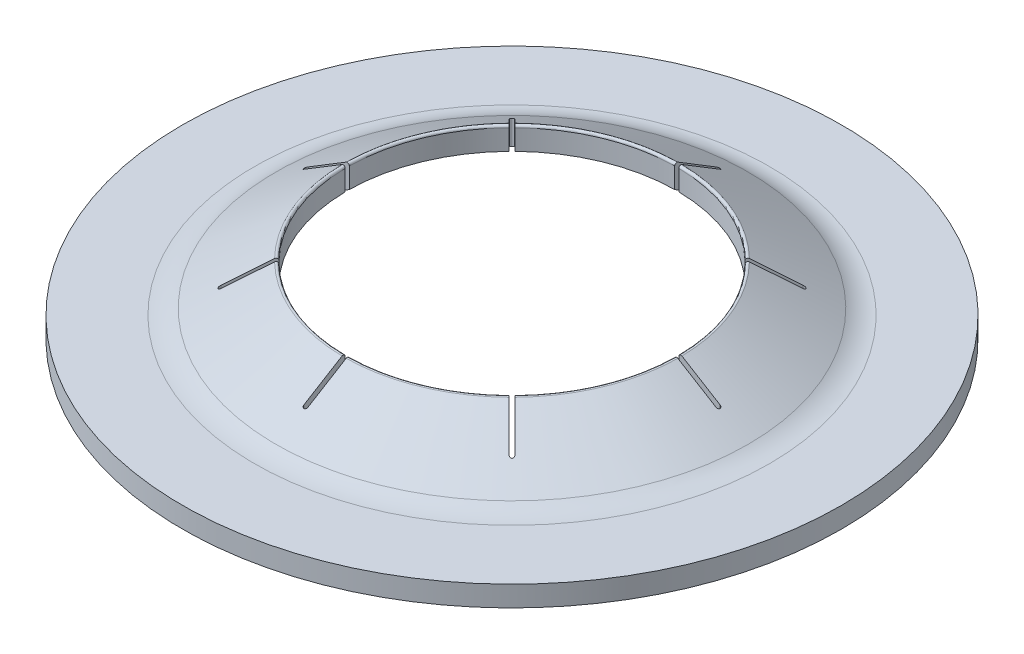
ISO-10303-21;
HEADER;
FILE_DESCRIPTION(('STEP AP214'),'2;1');
FILE_NAME('part.step','',(''),(''),'','','');
FILE_SCHEMA(('AUTOMOTIVE_DESIGN { 1 0 10303 214 1 1 1 1 }'));
ENDSEC;
DATA;
#1=APPLICATION_CONTEXT('core data for automotive mechanical design processes');
#2=APPLICATION_PROTOCOL_DEFINITION('international standard','automotive_design',2000,#1);
#3=PRODUCT_CONTEXT('',#1,'mechanical');
#4=PRODUCT('Part','Part','',(#3));
#5=PRODUCT_RELATED_PRODUCT_CATEGORY('part','',(#4));
#6=PRODUCT_DEFINITION_FORMATION('','',#4);
#7=PRODUCT_DEFINITION_CONTEXT('part definition',#1,'design');
#8=PRODUCT_DEFINITION('design','',#6,#7);
#9=PRODUCT_DEFINITION_SHAPE('','',#8);
#10=(LENGTH_UNIT() NAMED_UNIT(*) SI_UNIT(.MILLI.,.METRE.));
#11=(NAMED_UNIT(*) PLANE_ANGLE_UNIT() SI_UNIT($,.RADIAN.));
#12=(NAMED_UNIT(*) SI_UNIT($,.STERADIAN.) SOLID_ANGLE_UNIT());
#13=UNCERTAINTY_MEASURE_WITH_UNIT(LENGTH_MEASURE(1.E-05),#10,'distance_accuracy_value','');
#14=(GEOMETRIC_REPRESENTATION_CONTEXT(3) GLOBAL_UNCERTAINTY_ASSIGNED_CONTEXT((#13)) GLOBAL_UNIT_ASSIGNED_CONTEXT((#10,
#11,#12)) REPRESENTATION_CONTEXT('',''));
#15=CARTESIAN_POINT('',(0.,0.,0.));
#16=DIRECTION('',(0.,0.,1.));
#17=DIRECTION('',(1.,0.,0.));
#18=AXIS2_PLACEMENT_3D('',#15,#16,#17);
#19=CARTESIAN_POINT('',(0.,0.646047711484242,0.));
#20=DIRECTION('',(0.,-1.,0.));
#21=DIRECTION('',(1.,0.,0.));
#22=AXIS2_PLACEMENT_3D('',#19,#20,#21);
#23=CONICAL_SURFACE('',#22,5.72964868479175,1.02353402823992);
#24=CARTESIAN_POINT('',(0.,0.646047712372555,0.));
#25=DIRECTION('',(0.,-1.,0.));
#26=DIRECTION('',(1.,0.,0.));
#27=AXIS2_PLACEMENT_3D('',#24,#25,#26);
#28=CIRCLE('',#27,5.72964868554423);
#29=CARTESIAN_POINT('',(5.72964868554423,0.646047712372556,0.));
#30=VERTEX_POINT('',#29);
#31=EDGE_CURVE('E813',#30,#30,#28,.T.);
#32=ORIENTED_EDGE('',*,*,#31,.F.);
#33=EDGE_LOOP('',(#32));
#34=FACE_BOUND('',#33,.T.);
#35=CARTESIAN_POINT('',(-2.84715463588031,1.65367909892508,2.91678413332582));
#36=CARTESIAN_POINT('',(-2.95505588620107,1.56070254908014,3.02468538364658));
#37=CARTESIAN_POINT('',(-3.06295696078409,1.46772559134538,3.1325864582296));
#38=CARTESIAN_POINT('',(-3.27875875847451,1.28177086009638,3.34838825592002));
#39=CARTESIAN_POINT('',(-3.3866594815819,1.18879308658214,3.45628897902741));
#40=CARTESIAN_POINT('',(-3.49456002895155,1.09581490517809,3.56418952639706));
#41=B_SPLINE_CURVE_WITH_KNOTS('',3,(#35,#36,#37,#38,#39,#40),.UNSPECIFIED.,.F.,.F.,(4,2,4),(0.,
0.536069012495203,1.07213802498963),.UNSPECIFIED.);
#42=CARTESIAN_POINT('',(-2.84715463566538,1.65367909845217,2.91678413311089));
#43=VERTEX_POINT('',#42);
#44=CARTESIAN_POINT('',(-3.4945601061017,1.09581484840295,3.56418958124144));
#45=VERTEX_POINT('',#44);
#46=EDGE_CURVE('E295',#43,#45,#41,.T.);
#47=ORIENTED_EDGE('',*,*,#46,.T.);
#48=CARTESIAN_POINT('',(-3.49456003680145,1.09581489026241,3.5641895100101));
#49=CARTESIAN_POINT('',(-3.49665013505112,1.09362277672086,3.56717815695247));
#50=CARTESIAN_POINT('',(-3.49905821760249,1.0914003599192,3.56992507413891));
#51=CARTESIAN_POINT('',(-3.50443075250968,1.08696468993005,3.57485230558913));
#52=CARTESIAN_POINT('',(-3.50739758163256,1.08475151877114,3.57703010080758));
#53=CARTESIAN_POINT('',(-3.51346504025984,1.08064340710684,3.58052225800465));
#54=CARTESIAN_POINT('',(-3.51652178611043,1.07873892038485,3.58190167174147));
#55=CARTESIAN_POINT('',(-3.52292233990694,1.07507879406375,3.58403416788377));
#56=CARTESIAN_POINT('',(-3.52626534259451,1.07332276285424,3.5847889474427));
#57=CARTESIAN_POINT('',(-3.53237221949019,1.07040059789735,3.58550628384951));
#58=CARTESIAN_POINT('',(-3.53509887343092,1.06919026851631,3.58560803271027));
#59=CARTESIAN_POINT('',(-3.5406048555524,1.06694474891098,3.58535226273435));
#60=CARTESIAN_POINT('',(-3.54338417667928,1.06590953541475,3.58499480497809));
#61=CARTESIAN_POINT('',(-3.54893192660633,1.06405413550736,3.58378948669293));
#62=CARTESIAN_POINT('',(-3.55170016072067,1.06323542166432,3.58293838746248));
#63=CARTESIAN_POINT('',(-3.55710217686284,1.06186909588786,3.58073668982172));
#64=CARTESIAN_POINT('',(-3.55973607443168,1.06132124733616,3.57938652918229));
#65=CARTESIAN_POINT('',(-3.56444399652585,1.06058178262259,3.57641155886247));
#66=CARTESIAN_POINT('',(-3.56654698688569,1.06035451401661,3.5748412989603));
#67=CARTESIAN_POINT('',(-3.57048656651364,1.06014912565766,3.57138315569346));
#68=CARTESIAN_POINT('',(-3.57232329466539,1.06017087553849,3.56949543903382));
#69=CARTESIAN_POINT('',(-3.57554160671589,1.06045073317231,3.5656211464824));
#70=CARTESIAN_POINT('',(-3.57694721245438,1.06069069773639,3.56365307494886));
#71=CARTESIAN_POINT('',(-3.57944803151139,1.06136973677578,3.5595609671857));
#72=CARTESIAN_POINT('',(-3.58054324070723,1.06180881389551,3.55743692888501));
#73=CARTESIAN_POINT('',(-3.58243022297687,1.06287882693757,3.55304349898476));
#74=CARTESIAN_POINT('',(-3.58321435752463,1.06351398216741,3.55077187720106));
#75=CARTESIAN_POINT('',(-3.58444305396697,1.06494679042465,3.54618896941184));
#76=CARTESIAN_POINT('',(-3.5848874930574,1.06574450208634,3.54387766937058));
#77=CARTESIAN_POINT('',(-3.58547686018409,1.06756365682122,3.5390329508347));
#78=CARTESIAN_POINT('',(-3.58558685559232,1.06859958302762,3.53650076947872));
#79=CARTESIAN_POINT('',(-3.58543411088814,1.07080213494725,3.53150650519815));
#80=CARTESIAN_POINT('',(-3.58517124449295,1.07196880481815,3.52904444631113));
#81=CARTESIAN_POINT('',(-3.58424021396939,1.07457386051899,3.52389480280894));
#82=CARTESIAN_POINT('',(-3.58352021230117,1.07602737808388,3.52122424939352));
#83=CARTESIAN_POINT('',(-3.58167516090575,1.07902609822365,3.51607964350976));
#84=CARTESIAN_POINT('',(-3.5805496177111,1.08057141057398,3.51360583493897));
#85=CARTESIAN_POINT('',(-3.5776979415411,1.08400216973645,3.50847292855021));
#86=CARTESIAN_POINT('',(-3.57590008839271,1.08589868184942,3.50586092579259));
#87=CARTESIAN_POINT('',(-3.57186175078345,1.08971442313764,3.50103503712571));
#88=CARTESIAN_POINT('',(-3.56962206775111,1.09163360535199,3.49882044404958));
#89=CARTESIAN_POINT('',(-3.56719078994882,1.09353983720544,3.49683194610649));
#90=B_SPLINE_CURVE_WITH_KNOTS('',3,(#48,#49,#50,#51,#52,#53,#54,#55,#56,#57,#58,#59,#60,#61,#62,
#63,#64,#65,#66,#67,#68,#69,#70,#71,#72,#73,#74,#75,#76,#77,#78,#79,#80,#81,#82,#83,#84,#85,#86,
#87,#88,#89),.UNSPECIFIED.,.F.,.F.,(4,2,2,2,2,2,2,2,2,2,2,2,2,2,2,2,2,2,2,2,4),(0.,
0.0127513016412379,0.0255581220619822,0.0370696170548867,0.0485497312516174,0.0574682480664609,
0.0663855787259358,0.0753620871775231,0.0843307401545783,0.0921912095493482,0.100047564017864,
0.107305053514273,0.114562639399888,0.121988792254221,0.12941762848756,0.137599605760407,
0.145784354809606,0.155121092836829,0.164469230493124,0.175503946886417,0.186518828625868),.UNSPECIFIED.);
#91=CARTESIAN_POINT('',(-3.56719087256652,1.09353977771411,3.49683200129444));
#92=VERTEX_POINT('',#91);
#93=EDGE_CURVE('E288',#45,#92,#90,.T.);
#94=ORIENTED_EDGE('',*,*,#93,.T.);
#95=CARTESIAN_POINT('',(-3.56719080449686,1.09353983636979,3.49683193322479));
#96=CARTESIAN_POINT('',(-3.45885009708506,1.18689721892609,3.38849122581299));
#97=CARTESIAN_POINT('',(-3.35050920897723,1.28025418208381,3.28015033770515));
#98=CARTESIAN_POINT('',(-3.13382707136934,1.46696726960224,3.06346820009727));
#99=CARTESIAN_POINT('',(-3.02548582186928,1.56032339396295,2.95512695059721));
#100=CARTESIAN_POINT('',(-2.9171443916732,1.65367909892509,2.84678552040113));
#101=B_SPLINE_CURVE_WITH_KNOTS('',3,(#95,#96,#97,#98,#99,#100),.UNSPECIFIED.,.F.,.F.,(4,2,4),
(0.,0.538255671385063,1.07651134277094),.UNSPECIFIED.);
#102=CARTESIAN_POINT('',(-2.91714439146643,1.65367909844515,2.84678552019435));
#103=VERTEX_POINT('',#102);
#104=EDGE_CURVE('E22',#92,#103,#101,.T.);
#105=ORIENTED_EDGE('',*,*,#104,.T.);
#106=CARTESIAN_POINT('',(0.,1.65367909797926,0.));
#107=DIRECTION('',(0.,-1.,0.));
#108=DIRECTION('',(0.,0.,-1.));
#109=AXIS2_PLACEMENT_3D('',#106,#107,#108);
#110=CIRCLE('',#109,4.07601756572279);
#111=CARTESIAN_POINT('',(-4.07572018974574,1.65367909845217,0.049235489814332));
#112=VERTEX_POINT('',#111);
#113=EDGE_CURVE('E652',#112,#103,#110,.F.);
#114=ORIENTED_EDGE('',*,*,#113,.F.);
#115=CARTESIAN_POINT('',(-4.07572019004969,1.65367909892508,0.049235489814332));
#116=CARTESIAN_POINT('',(-4.22831560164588,1.56070254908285,0.049235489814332));
#117=CARTESIAN_POINT('',(-4.38091076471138,1.4677255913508,0.049235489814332));
#118=CARTESIAN_POINT('',(-4.68610059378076,1.28177086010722,0.049235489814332));
#119=CARTESIAN_POINT('',(-4.83869525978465,1.18879308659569,0.049235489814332));
#120=CARTESIAN_POINT('',(-4.99128967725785,1.09581490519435,0.049235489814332));
#121=B_SPLINE_CURVE_WITH_KNOTS('',3,(#115,#116,#117,#118,#119,#120),.UNSPECIFIED.,.F.,.F.,(4,2,
4),(0.,0.536069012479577,1.07213802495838),.UNSPECIFIED.);
#122=CARTESIAN_POINT('',(-4.99128977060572,1.0958148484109,0.0492354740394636));
#123=VERTEX_POINT('',#122);
#124=EDGE_CURVE('E286',#112,#123,#121,.T.);
#125=ORIENTED_EDGE('',*,*,#124,.T.);
#126=CARTESIAN_POINT('',(-4.99128967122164,1.09581489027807,0.0492354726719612));
#127=CARTESIAN_POINT('',(-4.99488088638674,1.09362277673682,0.0498708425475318));
#128=CARTESIAN_POINT('',(-4.99852602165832,1.09140035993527,0.0501104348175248));
#129=CARTESIAN_POINT('',(-5.00580905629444,1.08696468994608,0.0497955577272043));
#130=CARTESIAN_POINT('',(-5.00944685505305,1.084751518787,0.0492376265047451));
#131=CARTESIAN_POINT('',(-5.0162065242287,1.08064340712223,0.0474166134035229));
#132=CARTESIAN_POINT('',(-5.01934336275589,1.07873892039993,0.0462305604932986));
#133=CARTESIAN_POINT('',(-5.02537714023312,1.07507879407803,0.0432125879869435));
#134=CARTESIAN_POINT('',(-5.02827470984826,1.07332276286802,0.041382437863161));
#135=CARTESIAN_POINT('',(-5.03310015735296,1.07040059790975,0.0375714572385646));
#136=CARTESIAN_POINT('',(-5.03510014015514,1.06919026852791,0.0357153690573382));
#137=CARTESIAN_POINT('',(-5.03881260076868,1.06694474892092,0.0316411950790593));
#138=CARTESIAN_POINT('',(-5.04052511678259,1.06590953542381,0.0294231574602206));
#139=CARTESIAN_POINT('',(-5.04359567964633,1.06405413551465,0.0246480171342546));
#140=CARTESIAN_POINT('',(-5.04495129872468,1.06323542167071,0.0220887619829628));
#141=CARTESIAN_POINT('',(-5.04721426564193,1.06186909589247,0.0167121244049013));
#142=CARTESIAN_POINT('',(-5.04812200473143,1.06132124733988,0.0138949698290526));
#143=CARTESIAN_POINT('',(-5.04934738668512,1.06058178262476,0.00846234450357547));
#144=CARTESIAN_POINT('',(-5.04972408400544,1.06035451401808,0.00586496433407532));
#145=CARTESIAN_POINT('',(-5.05006451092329,1.0601491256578,0.000633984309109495));
#146=CARTESIAN_POINT('',(-5.05002845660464,1.060170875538,-0.00199959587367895));
#147=CARTESIAN_POINT('',(-5.04956460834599,1.0604507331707,-0.00701482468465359));
#148=CARTESIAN_POINT('',(-5.04916688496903,1.06069069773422,-0.00940037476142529));
#149=CARTESIAN_POINT('',(-5.04804167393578,1.06136973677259,-0.014062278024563));
#150=CARTESIAN_POINT('',(-5.04731418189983,1.06180881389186,-0.0163386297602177));
#151=CARTESIAN_POINT('',(-5.04554185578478,1.06287882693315,-0.0207795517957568));
#152=CARTESIAN_POINT('',(-5.04449004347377,1.06351398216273,-0.0229402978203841));
#153=CARTESIAN_POINT('',(-5.04211825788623,1.06494679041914,-0.0270497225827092));
#154=CARTESIAN_POINT('',(-5.04079818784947,1.06574450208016,-0.028998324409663));
#155=CARTESIAN_POINT('',(-5.03778920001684,1.06756365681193,-0.0328408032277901));
#156=CARTESIAN_POINT('',(-5.03607645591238,1.06859958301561,-0.0347091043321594));
#157=CARTESIAN_POINT('',(-5.03243697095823,1.07080213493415,-0.038132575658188));
#158=CARTESIAN_POINT('',(-5.03051015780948,1.07196880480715,-0.039687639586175));
#159=CARTESIAN_POINT('',(-5.02621047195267,1.07457386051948,-0.0426706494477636));
#160=CARTESIAN_POINT('',(-5.02381298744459,1.0760273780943,-0.0440498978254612));
#161=CARTESIAN_POINT('',(-5.01887055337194,1.07902609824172,-0.0463830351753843));
#162=CARTESIAN_POINT('',(-5.01632542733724,1.08057141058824,-0.0473364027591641));
#163=CARTESIAN_POINT('',(-5.01067950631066,1.08400215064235,-0.0489494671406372));
#164=CARTESIAN_POINT('',(-5.00756130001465,1.08589864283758,-0.0495251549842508));
#165=CARTESIAN_POINT('',(-5.00129341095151,1.08971434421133,-0.0500820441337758));
#166=CARTESIAN_POINT('',(-4.99814379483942,1.09163350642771,-0.0500643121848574));
#167=CARTESIAN_POINT('',(-4.99501857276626,1.0935397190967,-0.0497512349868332));
#168=B_SPLINE_CURVE_WITH_KNOTS('',3,(#126,#127,#128,#129,#130,#131,#132,#133,#134,#135,#136,
#137,#138,#139,#140,#141,#142,#143,#144,#145,#146,#147,#148,#149,#150,#151,#152,#153,#154,#155,
#156,#157,#158,#159,#160,#161,#162,#163,#164,#165,#166,#167),.UNSPECIFIED.,.F.,.F.,(4,2,2,2,2,2,
2,2,2,2,2,2,2,2,2,2,2,2,2,2,4),(0.,0.0127513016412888,0.0255581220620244,0.0370696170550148,
0.048549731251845,0.0574682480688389,0.066385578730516,0.075362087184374,0.0843307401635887,
0.0921912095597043,0.100047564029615,0.10730505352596,0.11456263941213,0.121988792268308,
0.12941762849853,0.137599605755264,0.145784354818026,0.155121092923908,0.164469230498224,
0.175503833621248,0.18651860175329),.UNSPECIFIED.);
#169=CARTESIAN_POINT('',(-4.99501857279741,1.09353971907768,-0.049751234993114));
#170=VERTEX_POINT('',#169);
#171=EDGE_CURVE('E463',#123,#170,#168,.T.);
#172=ORIENTED_EDGE('',*,*,#171,.T.);
#173=CARTESIAN_POINT('',(-4.99501857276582,1.09353971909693,-0.049751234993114));
#174=CARTESIAN_POINT('',(-4.84180164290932,1.18689712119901,-0.049751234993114));
#175=CARTESIAN_POINT('',(-4.68858445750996,1.28025410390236,-0.049751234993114));
#176=CARTESIAN_POINT('',(-4.38214957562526,1.46696723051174,-0.049751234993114));
#177=CARTESIAN_POINT('',(-4.22893187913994,1.56032337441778,-0.049751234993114));
#178=CARTESIAN_POINT('',(-4.07571392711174,1.65367909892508,-0.049751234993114));
#179=B_SPLINE_CURVE_WITH_KNOTS('',3,(#173,#174,#175,#176,#177,#178),.UNSPECIFIED.,.F.,.F.,(4,2,
4),(0.,0.538255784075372,1.07651156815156),.UNSPECIFIED.);
#180=CARTESIAN_POINT('',(-4.07571392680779,1.65367909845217,-0.049751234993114));
#181=VERTEX_POINT('',#180);
#182=EDGE_CURVE('E458',#170,#181,#179,.T.);
#183=ORIENTED_EDGE('',*,*,#182,.T.);
#184=CARTESIAN_POINT('',(0.,1.65367909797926,0.));
#185=DIRECTION('',(0.,-1.,0.));
#186=DIRECTION('',(0.,0.,-1.));
#187=AXIS2_PLACEMENT_3D('',#184,#185,#186);
#188=CIRCLE('',#187,4.07601756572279);
#189=CARTESIAN_POINT('',(-2.91678413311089,1.65367909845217,-2.84715463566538));
#190=VERTEX_POINT('',#189);
#191=EDGE_CURVE('E651',#190,#181,#188,.F.);
#192=ORIENTED_EDGE('',*,*,#191,.F.);
#193=CARTESIAN_POINT('',(-2.91678413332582,1.65367909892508,-2.84715463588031));
#194=CARTESIAN_POINT('',(-3.02468538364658,1.56070254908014,-2.95505588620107));
#195=CARTESIAN_POINT('',(-3.1325864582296,1.46772559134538,-3.06295696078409));
#196=CARTESIAN_POINT('',(-3.34838825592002,1.28177086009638,-3.27875875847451));
#197=CARTESIAN_POINT('',(-3.45628897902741,1.18879308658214,-3.3866594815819));
#198=CARTESIAN_POINT('',(-3.56418952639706,1.09581490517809,-3.49456002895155));
#199=B_SPLINE_CURVE_WITH_KNOTS('',3,(#193,#194,#195,#196,#197,#198),.UNSPECIFIED.,.F.,.F.,(4,2,
4),(0.,0.536069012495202,1.07213802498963),.UNSPECIFIED.);
#200=CARTESIAN_POINT('',(-3.56418958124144,1.09581484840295,-3.4945601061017));
#201=VERTEX_POINT('',#200);
#202=EDGE_CURVE('E452',#190,#201,#199,.T.);
#203=ORIENTED_EDGE('',*,*,#202,.T.);
#204=CARTESIAN_POINT('',(-3.5641895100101,1.09581489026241,-3.49456003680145));
#205=CARTESIAN_POINT('',(-3.56717815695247,1.09362277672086,-3.49665013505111));
#206=CARTESIAN_POINT('',(-3.5699250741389,1.0914003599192,-3.49905821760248));
#207=CARTESIAN_POINT('',(-3.57485230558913,1.08696468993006,-3.50443075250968));
#208=CARTESIAN_POINT('',(-3.57703010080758,1.08475151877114,-3.50739758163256));
#209=CARTESIAN_POINT('',(-3.58052225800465,1.08064340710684,-3.51346504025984));
#210=CARTESIAN_POINT('',(-3.58190167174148,1.07873892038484,-3.51652178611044));
#211=CARTESIAN_POINT('',(-3.58403416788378,1.07507879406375,-3.52292233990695));
#212=CARTESIAN_POINT('',(-3.5847889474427,1.07332276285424,-3.52626534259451));
#213=CARTESIAN_POINT('',(-3.58550628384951,1.07040059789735,-3.53237221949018));
#214=CARTESIAN_POINT('',(-3.58560803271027,1.06919026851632,-3.53509887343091));
#215=CARTESIAN_POINT('',(-3.58535226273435,1.06694474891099,-3.54060485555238));
#216=CARTESIAN_POINT('',(-3.58499480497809,1.06590953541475,-3.54338417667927));
#217=CARTESIAN_POINT('',(-3.58378948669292,1.06405413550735,-3.54893192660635));
#218=CARTESIAN_POINT('',(-3.58293838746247,1.06323542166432,-3.5517001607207));
#219=CARTESIAN_POINT('',(-3.58073668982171,1.06186909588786,-3.55710217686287));
#220=CARTESIAN_POINT('',(-3.57938652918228,1.06132124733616,-3.55973607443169));
#221=CARTESIAN_POINT('',(-3.57641155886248,1.06058178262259,-3.56444399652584));
#222=CARTESIAN_POINT('',(-3.57484129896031,1.06035451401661,-3.56654698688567));
#223=CARTESIAN_POINT('',(-3.57138315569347,1.06014912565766,-3.57048656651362));
#224=CARTESIAN_POINT('',(-3.56949543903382,1.06017087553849,-3.57232329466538));
#225=CARTESIAN_POINT('',(-3.56562114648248,1.06045073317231,-3.57554160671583));
#226=CARTESIAN_POINT('',(-3.56365307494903,1.06069069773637,-3.57694721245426));
#227=CARTESIAN_POINT('',(-3.55956096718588,1.06136973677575,-3.57944803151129));
#228=CARTESIAN_POINT('',(-3.5574369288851,1.06180881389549,-3.58054324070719));
#229=CARTESIAN_POINT('',(-3.55304349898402,1.06287882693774,-3.58243022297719));
#230=CARTESIAN_POINT('',(-3.55077187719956,1.06351398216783,-3.58321435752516));
#231=CARTESIAN_POINT('',(-3.54618896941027,1.0649467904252,-3.58444305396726));
#232=CARTESIAN_POINT('',(-3.54387766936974,1.06574450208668,-3.58488749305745));
#233=CARTESIAN_POINT('',(-3.53903295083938,1.06756365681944,-3.58547686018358));
#234=CARTESIAN_POINT('',(-3.5365007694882,1.06859958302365,-3.58558685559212));
#235=CARTESIAN_POINT('',(-3.53150650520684,1.07080213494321,-3.5854341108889));
#236=CARTESIAN_POINT('',(-3.52904444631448,1.0719688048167,-3.585171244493));
#237=CARTESIAN_POINT('',(-3.52389480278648,1.07457386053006,-3.58424021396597));
#238=CARTESIAN_POINT('',(-3.52122424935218,1.07602737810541,-3.58352021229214));
#239=CARTESIAN_POINT('',(-3.51607964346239,1.07902609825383,-3.58167516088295));
#240=CARTESIAN_POINT('',(-3.51360583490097,1.08057141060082,-3.58054961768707));
#241=CARTESIAN_POINT('',(-3.50847295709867,1.08400215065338,-3.57769795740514));
#242=CARTESIAN_POINT('',(-3.50586097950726,1.08589864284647,-3.57590012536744));
#243=CARTESIAN_POINT('',(-3.50103513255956,1.08971434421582,-3.57186183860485));
#244=CARTESIAN_POINT('',(-3.49882055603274,1.09163350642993,-3.56962218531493));
#245=CARTESIAN_POINT('',(-3.49683206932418,1.0935397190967,-3.56719094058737));
#246=B_SPLINE_CURVE_WITH_KNOTS('',3,(#204,#205,#206,#207,#208,#209,#210,#211,#212,#213,#214,
#215,#216,#217,#218,#219,#220,#221,#222,#223,#224,#225,#226,#227,#228,#229,#230,#231,#232,#233,
#234,#235,#236,#237,#238,#239,#240,#241,#242,#243,#244,#245),.UNSPECIFIED.,.F.,.F.,(4,2,2,2,2,2,
2,2,2,2,2,2,2,2,2,2,2,2,2,2,4),(0.,0.0127513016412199,0.0255581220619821,0.0370696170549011,
0.0485497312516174,0.057468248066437,0.0663855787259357,0.0753620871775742,0.0843307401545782,
0.0921912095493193,0.100047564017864,0.107305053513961,0.114562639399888,0.121988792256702,
0.12941762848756,0.137599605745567,0.145784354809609,0.155121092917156,0.164469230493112,
0.175503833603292,0.186518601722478),.UNSPECIFIED.);
#247=CARTESIAN_POINT('',(-3.49683206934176,1.09353971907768,-3.56719094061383));
#248=VERTEX_POINT('',#247);
#249=EDGE_CURVE('E445',#201,#248,#246,.T.);
#250=ORIENTED_EDGE('',*,*,#249,.T.);
#251=CARTESIAN_POINT('',(-3.49683206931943,1.09353971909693,-3.5671909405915));
#252=CARTESIAN_POINT('',(-3.38849133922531,1.186897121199,-3.45885021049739));
#253=CARTESIAN_POINT('',(-3.28015042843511,1.28025410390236,-3.35050929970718));
#254=CARTESIAN_POINT('',(-3.06346824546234,1.46696723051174,-3.13382711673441));
#255=CARTESIAN_POINT('',(-2.95512697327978,1.56032337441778,-3.02548584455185));
#256=CARTESIAN_POINT('',(-2.84678552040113,1.65367909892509,-2.9171443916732));
#257=B_SPLINE_CURVE_WITH_KNOTS('',3,(#251,#252,#253,#254,#255,#256),.UNSPECIFIED.,.F.,.F.,(4,2,
4),(0.,0.538255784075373,1.07651156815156),.UNSPECIFIED.);
#258=CARTESIAN_POINT('',(-2.84678552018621,1.65367909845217,-2.91714439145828));
#259=VERTEX_POINT('',#258);
#260=EDGE_CURVE('E438',#248,#259,#257,.T.);
#261=ORIENTED_EDGE('',*,*,#260,.T.);
#262=CARTESIAN_POINT('',(0.,1.65367909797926,0.));
#263=DIRECTION('',(0.,-1.,0.));
#264=DIRECTION('',(0.,0.,-1.));
#265=AXIS2_PLACEMENT_3D('',#262,#263,#264);
#266=CIRCLE('',#265,4.07601756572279);
#267=CARTESIAN_POINT('',(-0.049235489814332,1.65367909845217,-4.07572018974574));
#268=VERTEX_POINT('',#267);
#269=EDGE_CURVE('E957',#268,#259,#266,.F.);
#270=ORIENTED_EDGE('',*,*,#269,.F.);
#271=CARTESIAN_POINT('',(-0.049235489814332,1.65367909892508,-4.07572019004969));
#272=CARTESIAN_POINT('',(-0.049235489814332,1.56070254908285,-4.22831560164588));
#273=CARTESIAN_POINT('',(-0.049235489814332,1.4677255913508,-4.38091076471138));
#274=CARTESIAN_POINT('',(-0.049235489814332,1.28177086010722,-4.68610059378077));
#275=CARTESIAN_POINT('',(-0.049235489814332,1.18879308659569,-4.83869525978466));
#276=CARTESIAN_POINT('',(-0.049235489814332,1.09581490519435,-4.99128967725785));
#277=B_SPLINE_CURVE_WITH_KNOTS('',3,(#271,#272,#273,#274,#275,#276),.UNSPECIFIED.,.F.,.F.,(4,2,
4),(0.,0.53606901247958,1.07213802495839),.UNSPECIFIED.);
#278=CARTESIAN_POINT('',(-0.0492354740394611,1.09581484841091,-4.9912897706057));
#279=VERTEX_POINT('',#278);
#280=EDGE_CURVE('E431',#268,#279,#277,.T.);
#281=ORIENTED_EDGE('',*,*,#280,.T.);
#282=CARTESIAN_POINT('',(-0.0492354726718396,1.09581489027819,-4.99128967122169));
#283=CARTESIAN_POINT('',(-0.0498708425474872,1.09362277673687,-4.99488088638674));
#284=CARTESIAN_POINT('',(-0.0501104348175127,1.09140035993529,-4.99852602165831));
#285=CARTESIAN_POINT('',(-0.0497955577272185,1.08696468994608,-5.00580905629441));
#286=CARTESIAN_POINT('',(-0.0492376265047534,1.08475151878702,-5.00944685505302));
#287=CARTESIAN_POINT('',(-0.0474166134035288,1.08064340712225,-5.01620652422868));
#288=CARTESIAN_POINT('',(-0.0462305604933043,1.07873892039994,-5.01934336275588));
#289=CARTESIAN_POINT('',(-0.0432125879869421,1.07507879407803,-5.02537714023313));
#290=CARTESIAN_POINT('',(-0.0413824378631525,1.07332276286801,-5.02827470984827));
#291=CARTESIAN_POINT('',(-0.0375714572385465,1.07040059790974,-5.03310015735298));
#292=CARTESIAN_POINT('',(-0.035715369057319,1.0691902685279,-5.03510014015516));
#293=CARTESIAN_POINT('',(-0.0316411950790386,1.06694474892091,-5.0388126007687));
#294=CARTESIAN_POINT('',(-0.0294231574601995,1.0659095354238,-5.0405251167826));
#295=CARTESIAN_POINT('',(-0.0246480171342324,1.06405413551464,-5.04359567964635));
#296=CARTESIAN_POINT('',(-0.02208876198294,1.0632354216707,-5.04495129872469));
#297=CARTESIAN_POINT('',(-0.016712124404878,1.06186909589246,-5.04721426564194));
#298=CARTESIAN_POINT('',(-0.0138949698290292,1.06132124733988,-5.04812200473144));
#299=CARTESIAN_POINT('',(-0.0084623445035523,1.06058178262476,-5.04934738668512));
#300=CARTESIAN_POINT('',(-0.00586496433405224,1.06035451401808,-5.04972408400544));
#301=CARTESIAN_POINT('',(-0.000633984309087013,1.0601491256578,-5.05006451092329));
#302=CARTESIAN_POINT('',(0.00199959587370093,1.060170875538,-5.05002845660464));
#303=CARTESIAN_POINT('',(0.00701482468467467,1.0604507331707,-5.04956460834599));
#304=CARTESIAN_POINT('',(0.00940037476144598,1.06069069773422,-5.04916688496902));
#305=CARTESIAN_POINT('',(0.0140622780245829,1.0613697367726,-5.04804167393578));
#306=CARTESIAN_POINT('',(0.0163386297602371,1.06180881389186,-5.04731418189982));
#307=CARTESIAN_POINT('',(0.0207795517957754,1.06287882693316,-5.04554185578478));
#308=CARTESIAN_POINT('',(0.0229402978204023,1.06351398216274,-5.04449004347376));
#309=CARTESIAN_POINT('',(0.0270497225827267,1.06494679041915,-5.04211825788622));
#310=CARTESIAN_POINT('',(0.0289983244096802,1.06574450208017,-5.04079818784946));
#311=CARTESIAN_POINT('',(0.0328408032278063,1.06756365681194,-5.03778920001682));
#312=CARTESIAN_POINT('',(0.034709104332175,1.06859958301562,-5.03607645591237));
#313=CARTESIAN_POINT('',(0.0381325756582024,1.07080213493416,-5.03243697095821));
#314=CARTESIAN_POINT('',(0.0396876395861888,1.07196880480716,-5.03051015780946));
#315=CARTESIAN_POINT('',(0.042670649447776,1.07457386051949,-5.02621047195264));
#316=CARTESIAN_POINT('',(0.0440498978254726,1.07602737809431,-5.02381298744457));
#317=CARTESIAN_POINT('',(0.0463830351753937,1.07902609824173,-5.01887055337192));
#318=CARTESIAN_POINT('',(0.0473364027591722,1.08057141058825,-5.01632542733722));
#319=CARTESIAN_POINT('',(0.0489494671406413,1.08400215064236,-5.01067950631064));
#320=CARTESIAN_POINT('',(0.049525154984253,1.08589864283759,-5.00756130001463));
#321=CARTESIAN_POINT('',(0.0500820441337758,1.08971434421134,-5.0012934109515));
#322=CARTESIAN_POINT('',(0.0500643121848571,1.09163350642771,-4.99814379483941));
#323=CARTESIAN_POINT('',(0.0497512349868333,1.0935397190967,-4.99501857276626));
#324=B_SPLINE_CURVE_WITH_KNOTS('',3,(#282,#283,#284,#285,#286,#287,#288,#289,#290,#291,#292,
#293,#294,#295,#296,#297,#298,#299,#300,#301,#302,#303,#304,#305,#306,#307,#308,#309,#310,#311,
#312,#313,#314,#315,#316,#317,#318,#319,#320,#321,#322,#323),.UNSPECIFIED.,.F.,.F.,(4,2,2,2,2,2,
2,2,2,2,2,2,2,2,2,2,2,2,2,2,4),(0.,0.0127513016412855,0.0255581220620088,0.0370696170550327,
0.0485497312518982,0.0574682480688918,0.0663855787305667,0.0753620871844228,0.0843307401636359,
0.0921912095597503,0.100047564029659,0.107305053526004,0.114562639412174,0.121988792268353,
0.129417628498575,0.137599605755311,0.145784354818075,0.155121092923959,0.164469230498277,
0.175503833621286,0.186518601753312),.UNSPECIFIED.);
#325=CARTESIAN_POINT('',(0.049751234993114,1.09353971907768,-4.99501857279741));
#326=VERTEX_POINT('',#325);
#327=EDGE_CURVE('E424',#279,#326,#324,.T.);
#328=ORIENTED_EDGE('',*,*,#327,.T.);
#329=CARTESIAN_POINT('',(0.049751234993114,1.09353971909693,-4.99501857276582));
#330=CARTESIAN_POINT('',(0.049751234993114,1.18689712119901,-4.84180164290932));
#331=CARTESIAN_POINT('',(0.049751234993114,1.28025410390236,-4.68858445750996));
#332=CARTESIAN_POINT('',(0.049751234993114,1.46696723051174,-4.38214957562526));
#333=CARTESIAN_POINT('',(0.049751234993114,1.56032337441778,-4.22893187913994));
#334=CARTESIAN_POINT('',(0.049751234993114,1.65367909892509,-4.07571392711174));
#335=B_SPLINE_CURVE_WITH_KNOTS('',3,(#329,#330,#331,#332,#333,#334),.UNSPECIFIED.,.F.,.F.,(4,2,
4),(0.,0.538255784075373,1.07651156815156),.UNSPECIFIED.);
#336=CARTESIAN_POINT('',(0.049751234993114,1.65367909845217,-4.07571392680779));
#337=VERTEX_POINT('',#336);
#338=EDGE_CURVE('E417',#326,#337,#335,.T.);
#339=ORIENTED_EDGE('',*,*,#338,.T.);
#340=CARTESIAN_POINT('',(0.,1.65367909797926,0.));
#341=DIRECTION('',(0.,-1.,0.));
#342=DIRECTION('',(0.,0.,-1.));
#343=AXIS2_PLACEMENT_3D('',#340,#341,#342);
#344=CIRCLE('',#343,4.07601756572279);
#345=CARTESIAN_POINT('',(2.84715463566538,1.65367909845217,-2.91678413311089));
#346=VERTEX_POINT('',#345);
#347=EDGE_CURVE('E941',#346,#337,#344,.F.);
#348=ORIENTED_EDGE('',*,*,#347,.F.);
#349=CARTESIAN_POINT('',(2.84715463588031,1.65367909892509,-2.91678413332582));
#350=CARTESIAN_POINT('',(2.95505588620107,1.56070254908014,-3.02468538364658));
#351=CARTESIAN_POINT('',(3.06295696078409,1.46772559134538,-3.1325864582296));
#352=CARTESIAN_POINT('',(3.27875875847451,1.28177086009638,-3.34838825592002));
#353=CARTESIAN_POINT('',(3.3866594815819,1.18879308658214,-3.45628897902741));
#354=CARTESIAN_POINT('',(3.49456002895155,1.09581490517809,-3.56418952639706));
#355=B_SPLINE_CURVE_WITH_KNOTS('',3,(#349,#350,#351,#352,#353,#354),.UNSPECIFIED.,.F.,.F.,(4,2,
4),(0.,0.536069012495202,1.07213802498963),.UNSPECIFIED.);
#356=CARTESIAN_POINT('',(3.4945601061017,1.09581484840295,-3.56418958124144));
#357=VERTEX_POINT('',#356);
#358=EDGE_CURVE('E410',#346,#357,#355,.T.);
#359=ORIENTED_EDGE('',*,*,#358,.T.);
#360=CARTESIAN_POINT('',(3.49456003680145,1.09581489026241,-3.5641895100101));
#361=CARTESIAN_POINT('',(3.49665013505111,1.09362277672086,-3.56717815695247));
#362=CARTESIAN_POINT('',(3.49905821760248,1.0914003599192,-3.5699250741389));
#363=CARTESIAN_POINT('',(3.50443075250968,1.08696468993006,-3.57485230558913));
#364=CARTESIAN_POINT('',(3.50739758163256,1.08475151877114,-3.57703010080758));
#365=CARTESIAN_POINT('',(3.51346504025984,1.08064340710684,-3.58052225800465));
#366=CARTESIAN_POINT('',(3.51652178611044,1.07873892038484,-3.58190167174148));
#367=CARTESIAN_POINT('',(3.52292233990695,1.07507879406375,-3.58403416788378));
#368=CARTESIAN_POINT('',(3.52626534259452,1.07332276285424,-3.5847889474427));
#369=CARTESIAN_POINT('',(3.53237221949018,1.07040059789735,-3.58550628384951));
#370=CARTESIAN_POINT('',(3.53509887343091,1.06919026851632,-3.58560803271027));
#371=CARTESIAN_POINT('',(3.54060485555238,1.06694474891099,-3.58535226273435));
#372=CARTESIAN_POINT('',(3.54338417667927,1.06590953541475,-3.58499480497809));
#373=CARTESIAN_POINT('',(3.54893192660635,1.06405413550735,-3.58378948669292));
#374=CARTESIAN_POINT('',(3.5517001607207,1.06323542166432,-3.58293838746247));
#375=CARTESIAN_POINT('',(3.55710217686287,1.06186909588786,-3.58073668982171));
#376=CARTESIAN_POINT('',(3.55973607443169,1.06132124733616,-3.57938652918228));
#377=CARTESIAN_POINT('',(3.56444399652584,1.0605817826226,-3.57641155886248));
#378=CARTESIAN_POINT('',(3.56654698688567,1.06035451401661,-3.57484129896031));
#379=CARTESIAN_POINT('',(3.57048656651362,1.06014912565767,-3.57138315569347));
#380=CARTESIAN_POINT('',(3.57232329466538,1.06017087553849,-3.56949543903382));
#381=CARTESIAN_POINT('',(3.57554160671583,1.06045073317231,-3.56562114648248));
#382=CARTESIAN_POINT('',(3.57694721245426,1.06069069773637,-3.56365307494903));
#383=CARTESIAN_POINT('',(3.57944803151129,1.06136973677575,-3.55956096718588));
#384=CARTESIAN_POINT('',(3.58054324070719,1.06180881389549,-3.5574369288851));
#385=CARTESIAN_POINT('',(3.58243022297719,1.06287882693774,-3.55304349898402));
#386=CARTESIAN_POINT('',(3.58321435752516,1.06351398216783,-3.55077187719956));
#387=CARTESIAN_POINT('',(3.58444305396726,1.0649467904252,-3.54618896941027));
#388=CARTESIAN_POINT('',(3.58488749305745,1.06574450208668,-3.54387766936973));
#389=CARTESIAN_POINT('',(3.58547686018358,1.06756365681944,-3.53903295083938));
#390=CARTESIAN_POINT('',(3.58558685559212,1.06859958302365,-3.5365007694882));
#391=CARTESIAN_POINT('',(3.58543411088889,1.07080213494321,-3.53150650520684));
#392=CARTESIAN_POINT('',(3.585171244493,1.07196880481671,-3.52904444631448));
#393=CARTESIAN_POINT('',(3.58424021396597,1.07457386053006,-3.52389480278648));
#394=CARTESIAN_POINT('',(3.58352021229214,1.07602737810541,-3.52122424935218));
#395=CARTESIAN_POINT('',(3.58167516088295,1.07902609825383,-3.51607964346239));
#396=CARTESIAN_POINT('',(3.58054961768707,1.08057141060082,-3.51360583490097));
#397=CARTESIAN_POINT('',(3.57769795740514,1.08400215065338,-3.50847295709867));
#398=CARTESIAN_POINT('',(3.57590012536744,1.08589864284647,-3.50586097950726));
#399=CARTESIAN_POINT('',(3.57186183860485,1.08971434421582,-3.50103513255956));
#400=CARTESIAN_POINT('',(3.56962218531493,1.09163350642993,-3.49882055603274));
#401=CARTESIAN_POINT('',(3.56719094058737,1.0935397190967,-3.49683206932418));
#402=B_SPLINE_CURVE_WITH_KNOTS('',3,(#360,#361,#362,#363,#364,#365,#366,#367,#368,#369,#370,
#371,#372,#373,#374,#375,#376,#377,#378,#379,#380,#381,#382,#383,#384,#385,#386,#387,#388,#389,
#390,#391,#392,#393,#394,#395,#396,#397,#398,#399,#400,#401),.UNSPECIFIED.,.F.,.F.,(4,2,2,2,2,2,
2,2,2,2,2,2,2,2,2,2,2,2,2,2,4),(0.,0.0127513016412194,0.0255581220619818,0.0370696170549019,
0.0485497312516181,0.0574682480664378,0.0663855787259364,0.0753620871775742,0.0843307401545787,
0.0921912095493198,0.100047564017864,0.107305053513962,0.114562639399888,0.121988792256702,
0.12941762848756,0.137599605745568,0.14578435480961,0.155121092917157,0.164469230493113,
0.175503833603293,0.186518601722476),.UNSPECIFIED.);
#403=CARTESIAN_POINT('',(3.56719094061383,1.09353971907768,-3.49683206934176));
#404=VERTEX_POINT('',#403);
#405=EDGE_CURVE('E403',#357,#404,#402,.T.);
#406=ORIENTED_EDGE('',*,*,#405,.T.);
#407=CARTESIAN_POINT('',(3.5671909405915,1.09353971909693,-3.49683206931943));
#408=CARTESIAN_POINT('',(3.45885021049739,1.18689712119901,-3.38849133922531));
#409=CARTESIAN_POINT('',(3.35050929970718,1.28025410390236,-3.28015042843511));
#410=CARTESIAN_POINT('',(3.13382711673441,1.46696723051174,-3.06346824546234));
#411=CARTESIAN_POINT('',(3.02548584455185,1.56032337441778,-2.95512697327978));
#412=CARTESIAN_POINT('',(2.9171443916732,1.65367909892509,-2.84678552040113));
#413=B_SPLINE_CURVE_WITH_KNOTS('',3,(#407,#408,#409,#410,#411,#412),.UNSPECIFIED.,.F.,.F.,(4,2,
4),(0.,0.538255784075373,1.07651156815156),.UNSPECIFIED.);
#414=CARTESIAN_POINT('',(2.91714439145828,1.65367909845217,-2.84678552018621));
#415=VERTEX_POINT('',#414);
#416=EDGE_CURVE('E396',#404,#415,#413,.T.);
#417=ORIENTED_EDGE('',*,*,#416,.T.);
#418=CARTESIAN_POINT('',(0.,1.65367909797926,0.));
#419=DIRECTION('',(0.,-1.,0.));
#420=DIRECTION('',(0.,0.,-1.));
#421=AXIS2_PLACEMENT_3D('',#418,#419,#420);
#422=CIRCLE('',#421,4.07601756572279);
#423=CARTESIAN_POINT('',(4.07572018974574,1.65367909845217,-0.049235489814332));
#424=VERTEX_POINT('',#423);
#425=EDGE_CURVE('E933',#424,#415,#422,.F.);
#426=ORIENTED_EDGE('',*,*,#425,.F.);
#427=CARTESIAN_POINT('',(4.07572019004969,1.65367909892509,-0.049235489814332));
#428=CARTESIAN_POINT('',(4.22831560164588,1.56070254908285,-0.049235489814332));
#429=CARTESIAN_POINT('',(4.38091076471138,1.4677255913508,-0.049235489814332));
#430=CARTESIAN_POINT('',(4.68610059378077,1.28177086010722,-0.049235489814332));
#431=CARTESIAN_POINT('',(4.83869525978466,1.18879308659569,-0.049235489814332));
#432=CARTESIAN_POINT('',(4.99128967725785,1.09581490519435,-0.049235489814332));
#433=B_SPLINE_CURVE_WITH_KNOTS('',3,(#427,#428,#429,#430,#431,#432),.UNSPECIFIED.,.F.,.F.,(4,2,
4),(0.,0.53606901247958,1.07213802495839),.UNSPECIFIED.);
#434=CARTESIAN_POINT('',(4.9912897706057,1.09581484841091,-0.0492354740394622));
#435=VERTEX_POINT('',#434);
#436=EDGE_CURVE('E389',#424,#435,#433,.T.);
#437=ORIENTED_EDGE('',*,*,#436,.T.);
#438=CARTESIAN_POINT('',(4.99128967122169,1.09581489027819,-0.0492354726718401));
#439=CARTESIAN_POINT('',(4.99488088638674,1.09362277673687,-0.0498708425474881));
#440=CARTESIAN_POINT('',(4.99852602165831,1.09140035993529,-0.0501104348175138));
#441=CARTESIAN_POINT('',(5.00580905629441,1.08696468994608,-0.0497955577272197));
#442=CARTESIAN_POINT('',(5.00944685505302,1.08475151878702,-0.0492376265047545));
#443=CARTESIAN_POINT('',(5.01620652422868,1.08064340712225,-0.04741661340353));
#444=CARTESIAN_POINT('',(5.01934336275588,1.07873892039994,-0.0462305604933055));
#445=CARTESIAN_POINT('',(5.02537714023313,1.07507879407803,-0.0432125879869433));
#446=CARTESIAN_POINT('',(5.02827470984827,1.07332276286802,-0.0413824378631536));
#447=CARTESIAN_POINT('',(5.03310015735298,1.07040059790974,-0.0375714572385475));
#448=CARTESIAN_POINT('',(5.03510014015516,1.0691902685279,-0.03571536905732));
#449=CARTESIAN_POINT('',(5.0388126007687,1.06694474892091,-0.0316411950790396));
#450=CARTESIAN_POINT('',(5.0405251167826,1.0659095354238,-0.0294231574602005));
#451=CARTESIAN_POINT('',(5.04359567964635,1.06405413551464,-0.0246480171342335));
#452=CARTESIAN_POINT('',(5.04495129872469,1.0632354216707,-0.022088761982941));
#453=CARTESIAN_POINT('',(5.04721426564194,1.06186909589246,-0.016712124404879));
#454=CARTESIAN_POINT('',(5.04812200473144,1.06132124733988,-0.0138949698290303));
#455=CARTESIAN_POINT('',(5.04934738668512,1.06058178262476,-0.00846234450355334));
#456=CARTESIAN_POINT('',(5.04972408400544,1.06035451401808,-0.0058649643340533));
#457=CARTESIAN_POINT('',(5.05006451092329,1.0601491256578,-0.00063398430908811));
#458=CARTESIAN_POINT('',(5.05002845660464,1.060170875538,0.00199959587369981));
#459=CARTESIAN_POINT('',(5.04956460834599,1.0604507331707,0.00701482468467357));
#460=CARTESIAN_POINT('',(5.04916688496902,1.06069069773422,0.00940037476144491));
#461=CARTESIAN_POINT('',(5.04804167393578,1.0613697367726,0.0140622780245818));
#462=CARTESIAN_POINT('',(5.04731418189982,1.06180881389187,0.0163386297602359));
#463=CARTESIAN_POINT('',(5.04554185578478,1.06287882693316,0.0207795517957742));
#464=CARTESIAN_POINT('',(5.04449004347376,1.06351398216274,0.0229402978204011));
#465=CARTESIAN_POINT('',(5.04211825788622,1.06494679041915,0.0270497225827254));
#466=CARTESIAN_POINT('',(5.04079818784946,1.06574450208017,0.0289983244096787));
#467=CARTESIAN_POINT('',(5.03778920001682,1.06756365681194,0.0328408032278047));
#468=CARTESIAN_POINT('',(5.03607645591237,1.06859958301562,0.0347091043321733));
#469=CARTESIAN_POINT('',(5.03243697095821,1.07080213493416,0.0381325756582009));
#470=CARTESIAN_POINT('',(5.03051015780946,1.07196880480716,0.0396876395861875));
#471=CARTESIAN_POINT('',(5.02621047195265,1.07457386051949,0.0426706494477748));
#472=CARTESIAN_POINT('',(5.02381298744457,1.07602737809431,0.0440498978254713));
#473=CARTESIAN_POINT('',(5.01887055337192,1.07902609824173,0.0463830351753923));
#474=CARTESIAN_POINT('',(5.01632542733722,1.08057141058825,0.047336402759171));
#475=CARTESIAN_POINT('',(5.01067950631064,1.08400215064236,0.0489494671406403));
#476=CARTESIAN_POINT('',(5.00756130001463,1.0858986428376,0.0495251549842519));
#477=CARTESIAN_POINT('',(5.0012934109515,1.08971434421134,0.0500820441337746));
#478=CARTESIAN_POINT('',(4.99814379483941,1.09163350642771,0.0500643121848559));
#479=CARTESIAN_POINT('',(4.99501857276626,1.0935397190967,0.0497512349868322));
#480=B_SPLINE_CURVE_WITH_KNOTS('',3,(#438,#439,#440,#441,#442,#443,#444,#445,#446,#447,#448,
#449,#450,#451,#452,#453,#454,#455,#456,#457,#458,#459,#460,#461,#462,#463,#464,#465,#466,#467,
#468,#469,#470,#471,#472,#473,#474,#475,#476,#477,#478,#479),.UNSPECIFIED.,.F.,.F.,(4,2,2,2,2,2,
2,2,2,2,2,2,2,2,2,2,2,2,2,2,4),(0.,0.012751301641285,0.0255581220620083,0.0370696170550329,
0.0485497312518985,0.0574682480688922,0.066385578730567,0.0753620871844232,0.0843307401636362,
0.0921912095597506,0.10004756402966,0.107305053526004,0.114562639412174,0.121988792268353,
0.129417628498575,0.137599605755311,0.145784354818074,0.155121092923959,0.164469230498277,
0.175503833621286,0.186518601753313),.UNSPECIFIED.);
#481=CARTESIAN_POINT('',(4.99501857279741,1.09353971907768,0.049751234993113));
#482=VERTEX_POINT('',#481);
#483=EDGE_CURVE('E382',#435,#482,#480,.T.);
#484=ORIENTED_EDGE('',*,*,#483,.T.);
#485=CARTESIAN_POINT('',(4.99501857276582,1.09353971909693,0.049751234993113));
#486=CARTESIAN_POINT('',(4.84180164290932,1.18689712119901,0.049751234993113));
#487=CARTESIAN_POINT('',(4.68858445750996,1.28025410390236,0.049751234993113));
#488=CARTESIAN_POINT('',(4.38214957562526,1.46696723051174,0.049751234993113));
#489=CARTESIAN_POINT('',(4.22893187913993,1.56032337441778,0.049751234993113));
#490=CARTESIAN_POINT('',(4.07571392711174,1.65367909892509,0.049751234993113));
#491=B_SPLINE_CURVE_WITH_KNOTS('',3,(#485,#486,#487,#488,#489,#490),.UNSPECIFIED.,.F.,.F.,(4,2,
4),(0.,0.538255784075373,1.07651156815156),.UNSPECIFIED.);
#492=CARTESIAN_POINT('',(4.07571392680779,1.65367909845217,0.049751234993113));
#493=VERTEX_POINT('',#492);
#494=EDGE_CURVE('E375',#482,#493,#491,.T.);
#495=ORIENTED_EDGE('',*,*,#494,.T.);
#496=CARTESIAN_POINT('',(0.,1.65367909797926,0.));
#497=DIRECTION('',(0.,-1.,0.));
#498=DIRECTION('',(0.,0.,-1.));
#499=AXIS2_PLACEMENT_3D('',#496,#497,#498);
#500=CIRCLE('',#499,4.07601756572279);
#501=CARTESIAN_POINT('',(2.91678413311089,1.65367909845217,2.84715463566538));
#502=VERTEX_POINT('',#501);
#503=EDGE_CURVE('E926',#502,#493,#500,.F.);
#504=ORIENTED_EDGE('',*,*,#503,.F.);
#505=CARTESIAN_POINT('',(2.91678413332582,1.65367909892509,2.84715463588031));
#506=CARTESIAN_POINT('',(3.02468538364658,1.56070254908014,2.95505588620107));
#507=CARTESIAN_POINT('',(3.1325864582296,1.46772559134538,3.06295696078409));
#508=CARTESIAN_POINT('',(3.34838825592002,1.28177086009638,3.27875875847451));
#509=CARTESIAN_POINT('',(3.45628897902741,1.18879308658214,3.3866594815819));
#510=CARTESIAN_POINT('',(3.56418952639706,1.09581490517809,3.49456002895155));
#511=B_SPLINE_CURVE_WITH_KNOTS('',3,(#505,#506,#507,#508,#509,#510),.UNSPECIFIED.,.F.,.F.,(4,2,
4),(0.,0.536069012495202,1.07213802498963),.UNSPECIFIED.);
#512=CARTESIAN_POINT('',(3.56418958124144,1.09581484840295,3.4945601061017));
#513=VERTEX_POINT('',#512);
#514=EDGE_CURVE('E368',#502,#513,#511,.T.);
#515=ORIENTED_EDGE('',*,*,#514,.T.);
#516=CARTESIAN_POINT('',(3.5641895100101,1.09581489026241,3.49456003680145));
#517=CARTESIAN_POINT('',(3.56717815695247,1.09362277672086,3.49665013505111));
#518=CARTESIAN_POINT('',(3.5699250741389,1.0914003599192,3.49905821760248));
#519=CARTESIAN_POINT('',(3.57485230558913,1.08696468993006,3.50443075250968));
#520=CARTESIAN_POINT('',(3.57703010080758,1.08475151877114,3.50739758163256));
#521=CARTESIAN_POINT('',(3.58052225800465,1.08064340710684,3.51346504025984));
#522=CARTESIAN_POINT('',(3.58190167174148,1.07873892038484,3.51652178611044));
#523=CARTESIAN_POINT('',(3.58403416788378,1.07507879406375,3.52292233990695));
#524=CARTESIAN_POINT('',(3.5847889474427,1.07332276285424,3.52626534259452));
#525=CARTESIAN_POINT('',(3.58550628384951,1.07040059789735,3.53237221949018));
#526=CARTESIAN_POINT('',(3.58560803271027,1.06919026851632,3.53509887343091));
#527=CARTESIAN_POINT('',(3.58535226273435,1.06694474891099,3.54060485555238));
#528=CARTESIAN_POINT('',(3.58499480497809,1.06590953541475,3.54338417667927));
#529=CARTESIAN_POINT('',(3.58378948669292,1.06405413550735,3.54893192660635));
#530=CARTESIAN_POINT('',(3.58293838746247,1.06323542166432,3.5517001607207));
#531=CARTESIAN_POINT('',(3.58073668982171,1.06186909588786,3.55710217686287));
#532=CARTESIAN_POINT('',(3.57938652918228,1.06132124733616,3.55973607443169));
#533=CARTESIAN_POINT('',(3.57641155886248,1.0605817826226,3.56444399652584));
#534=CARTESIAN_POINT('',(3.57484129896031,1.06035451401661,3.56654698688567));
#535=CARTESIAN_POINT('',(3.57138315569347,1.06014912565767,3.57048656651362));
#536=CARTESIAN_POINT('',(3.56949543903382,1.06017087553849,3.57232329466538));
#537=CARTESIAN_POINT('',(3.56562114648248,1.06045073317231,3.57554160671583));
#538=CARTESIAN_POINT('',(3.56365307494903,1.06069069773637,3.57694721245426));
#539=CARTESIAN_POINT('',(3.55956096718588,1.06136973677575,3.57944803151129));
#540=CARTESIAN_POINT('',(3.5574369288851,1.06180881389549,3.58054324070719));
#541=CARTESIAN_POINT('',(3.55304349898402,1.06287882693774,3.58243022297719));
#542=CARTESIAN_POINT('',(3.55077187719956,1.06351398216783,3.58321435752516));
#543=CARTESIAN_POINT('',(3.54618896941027,1.0649467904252,3.58444305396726));
#544=CARTESIAN_POINT('',(3.54387766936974,1.06574450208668,3.58488749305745));
#545=CARTESIAN_POINT('',(3.53903295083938,1.06756365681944,3.58547686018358));
#546=CARTESIAN_POINT('',(3.5365007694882,1.06859958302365,3.58558685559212));
#547=CARTESIAN_POINT('',(3.53150650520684,1.07080213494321,3.58543411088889));
#548=CARTESIAN_POINT('',(3.52904444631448,1.07196880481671,3.585171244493));
#549=CARTESIAN_POINT('',(3.52389480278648,1.07457386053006,3.58424021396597));
#550=CARTESIAN_POINT('',(3.52122424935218,1.07602737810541,3.58352021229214));
#551=CARTESIAN_POINT('',(3.51607964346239,1.07902609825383,3.58167516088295));
#552=CARTESIAN_POINT('',(3.51360583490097,1.08057141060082,3.58054961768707));
#553=CARTESIAN_POINT('',(3.50847295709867,1.08400215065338,3.57769795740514));
#554=CARTESIAN_POINT('',(3.50586097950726,1.08589864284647,3.57590012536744));
#555=CARTESIAN_POINT('',(3.50103513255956,1.08971434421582,3.57186183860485));
#556=CARTESIAN_POINT('',(3.49882055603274,1.09163350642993,3.56962218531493));
#557=CARTESIAN_POINT('',(3.49683206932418,1.0935397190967,3.56719094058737));
#558=B_SPLINE_CURVE_WITH_KNOTS('',3,(#516,#517,#518,#519,#520,#521,#522,#523,#524,#525,#526,
#527,#528,#529,#530,#531,#532,#533,#534,#535,#536,#537,#538,#539,#540,#541,#542,#543,#544,#545,
#546,#547,#548,#549,#550,#551,#552,#553,#554,#555,#556,#557),.UNSPECIFIED.,.F.,.F.,(4,2,2,2,2,2,
2,2,2,2,2,2,2,2,2,2,2,2,2,2,4),(0.,0.0127513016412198,0.0255581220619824,0.0370696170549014,
0.048549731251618,0.0574682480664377,0.0663855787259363,0.0753620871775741,0.0843307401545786,
0.0921912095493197,0.100047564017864,0.107305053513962,0.114562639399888,0.121988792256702,
0.12941762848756,0.137599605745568,0.14578435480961,0.155121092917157,0.164469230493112,
0.175503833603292,0.186518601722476),.UNSPECIFIED.);
#559=CARTESIAN_POINT('',(3.49683206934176,1.09353971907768,3.56719094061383));
#560=VERTEX_POINT('',#559);
#561=EDGE_CURVE('E361',#513,#560,#558,.T.);
#562=ORIENTED_EDGE('',*,*,#561,.T.);
#563=CARTESIAN_POINT('',(3.49683206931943,1.09353971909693,3.5671909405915));
#564=CARTESIAN_POINT('',(3.38849133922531,1.18689712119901,3.45885021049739));
#565=CARTESIAN_POINT('',(3.28015042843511,1.28025410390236,3.35050929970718));
#566=CARTESIAN_POINT('',(3.06346824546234,1.46696723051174,3.13382711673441));
#567=CARTESIAN_POINT('',(2.95512697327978,1.56032337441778,3.02548584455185));
#568=CARTESIAN_POINT('',(2.84678552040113,1.65367909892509,2.9171443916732));
#569=B_SPLINE_CURVE_WITH_KNOTS('',3,(#563,#564,#565,#566,#567,#568),.UNSPECIFIED.,.F.,.F.,(4,2,
4),(0.,0.538255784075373,1.07651156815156),.UNSPECIFIED.);
#570=CARTESIAN_POINT('',(2.84678552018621,1.65367909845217,2.91714439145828));
#571=VERTEX_POINT('',#570);
#572=EDGE_CURVE('E354',#560,#571,#569,.T.);
#573=ORIENTED_EDGE('',*,*,#572,.T.);
#574=CARTESIAN_POINT('',(0.,1.65367909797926,0.));
#575=DIRECTION('',(0.,-1.,0.));
#576=DIRECTION('',(0.,0.,-1.));
#577=AXIS2_PLACEMENT_3D('',#574,#575,#576);
#578=CIRCLE('',#577,4.07601756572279);
#579=CARTESIAN_POINT('',(0.049235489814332,1.65367909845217,4.07572018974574));
#580=VERTEX_POINT('',#579);
#581=EDGE_CURVE('E850',#580,#571,#578,.F.);
#582=ORIENTED_EDGE('',*,*,#581,.F.);
#583=CARTESIAN_POINT('',(0.049235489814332,1.65367909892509,4.07572019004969));
#584=CARTESIAN_POINT('',(0.049235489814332,1.56070254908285,4.22831560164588));
#585=CARTESIAN_POINT('',(0.049235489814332,1.4677255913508,4.38091076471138));
#586=CARTESIAN_POINT('',(0.049235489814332,1.28177086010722,4.68610059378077));
#587=CARTESIAN_POINT('',(0.049235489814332,1.18879308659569,4.83869525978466));
#588=CARTESIAN_POINT('',(0.049235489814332,1.09581490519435,4.99128967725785));
#589=B_SPLINE_CURVE_WITH_KNOTS('',3,(#583,#584,#585,#586,#587,#588),.UNSPECIFIED.,.F.,.F.,(4,2,
4),(0.,0.53606901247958,1.07213802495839),.UNSPECIFIED.);
#590=CARTESIAN_POINT('',(0.0492354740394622,1.09581484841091,4.9912897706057));
#591=VERTEX_POINT('',#590);
#592=EDGE_CURVE('E347',#580,#591,#589,.T.);
#593=ORIENTED_EDGE('',*,*,#592,.T.);
#594=CARTESIAN_POINT('',(0.0492354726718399,1.09581489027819,4.99128967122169));
#595=CARTESIAN_POINT('',(0.0498708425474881,1.09362277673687,4.99488088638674));
#596=CARTESIAN_POINT('',(0.0501104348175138,1.09140035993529,4.99852602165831));
#597=CARTESIAN_POINT('',(0.0497955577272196,1.08696468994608,5.00580905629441));
#598=CARTESIAN_POINT('',(0.0492376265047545,1.08475151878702,5.00944685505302));
#599=CARTESIAN_POINT('',(0.04741661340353,1.08064340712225,5.01620652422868));
#600=CARTESIAN_POINT('',(0.0462305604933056,1.07873892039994,5.01934336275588));
#601=CARTESIAN_POINT('',(0.0432125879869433,1.07507879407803,5.02537714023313));
#602=CARTESIAN_POINT('',(0.0413824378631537,1.07332276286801,5.02827470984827));
#603=CARTESIAN_POINT('',(0.0375714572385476,1.07040059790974,5.03310015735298));
#604=CARTESIAN_POINT('',(0.0357153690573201,1.0691902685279,5.03510014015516));
#605=CARTESIAN_POINT('',(0.0316411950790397,1.06694474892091,5.0388126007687));
#606=CARTESIAN_POINT('',(0.0294231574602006,1.0659095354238,5.0405251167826));
#607=CARTESIAN_POINT('',(0.0246480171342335,1.06405413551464,5.04359567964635));
#608=CARTESIAN_POINT('',(0.0220887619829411,1.0632354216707,5.04495129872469));
#609=CARTESIAN_POINT('',(0.0167121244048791,1.06186909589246,5.04721426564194));
#610=CARTESIAN_POINT('',(0.0138949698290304,1.06132124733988,5.04812200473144));
#611=CARTESIAN_POINT('',(0.00846234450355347,1.06058178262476,5.04934738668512));
#612=CARTESIAN_POINT('',(0.00586496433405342,1.06035451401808,5.04972408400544));
#613=CARTESIAN_POINT('',(0.000633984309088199,1.0601491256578,5.05006451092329));
#614=CARTESIAN_POINT('',(-0.00199959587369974,1.060170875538,5.05002845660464));
#615=CARTESIAN_POINT('',(-0.00701482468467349,1.0604507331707,5.04956460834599));
#616=CARTESIAN_POINT('',(-0.00940037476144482,1.06069069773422,5.04916688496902));
#617=CARTESIAN_POINT('',(-0.0140622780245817,1.0613697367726,5.04804167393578));
#618=CARTESIAN_POINT('',(-0.0163386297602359,1.06180881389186,5.04731418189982));
#619=CARTESIAN_POINT('',(-0.0207795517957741,1.06287882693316,5.04554185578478));
#620=CARTESIAN_POINT('',(-0.022940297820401,1.06351398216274,5.04449004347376));
#621=CARTESIAN_POINT('',(-0.0270497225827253,1.06494679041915,5.04211825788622));
#622=CARTESIAN_POINT('',(-0.0289983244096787,1.06574450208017,5.04079818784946));
#623=CARTESIAN_POINT('',(-0.0328408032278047,1.06756365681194,5.03778920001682));
#624=CARTESIAN_POINT('',(-0.0347091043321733,1.06859958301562,5.03607645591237));
#625=CARTESIAN_POINT('',(-0.0381325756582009,1.07080213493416,5.03243697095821));
#626=CARTESIAN_POINT('',(-0.0396876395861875,1.07196880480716,5.03051015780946));
#627=CARTESIAN_POINT('',(-0.0426706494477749,1.07457386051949,5.02621047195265));
#628=CARTESIAN_POINT('',(-0.0440498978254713,1.07602737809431,5.02381298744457));
#629=CARTESIAN_POINT('',(-0.0463830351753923,1.07902609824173,5.01887055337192));
#630=CARTESIAN_POINT('',(-0.047336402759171,1.08057141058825,5.01632542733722));
#631=CARTESIAN_POINT('',(-0.0489494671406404,1.08400215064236,5.01067950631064));
#632=CARTESIAN_POINT('',(-0.049525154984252,1.08589864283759,5.00756130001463));
#633=CARTESIAN_POINT('',(-0.0500820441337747,1.08971434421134,5.0012934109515));
#634=CARTESIAN_POINT('',(-0.0500643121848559,1.09163350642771,4.99814379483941));
#635=CARTESIAN_POINT('',(-0.0497512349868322,1.0935397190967,4.99501857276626));
#636=B_SPLINE_CURVE_WITH_KNOTS('',3,(#594,#595,#596,#597,#598,#599,#600,#601,#602,#603,#604,
#605,#606,#607,#608,#609,#610,#611,#612,#613,#614,#615,#616,#617,#618,#619,#620,#621,#622,#623,
#624,#625,#626,#627,#628,#629,#630,#631,#632,#633,#634,#635),.UNSPECIFIED.,.F.,.F.,(4,2,2,2,2,2,
2,2,2,2,2,2,2,2,2,2,2,2,2,2,4),(0.,0.0127513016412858,0.0255581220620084,0.0370696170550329,
0.0485497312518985,0.0574682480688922,0.0663855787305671,0.0753620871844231,0.0843307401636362,
0.0921912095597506,0.10004756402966,0.107305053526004,0.114562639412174,0.121988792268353,
0.129417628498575,0.137599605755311,0.145784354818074,0.155121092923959,0.164469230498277,
0.175503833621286,0.186518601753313),.UNSPECIFIED.);
#637=CARTESIAN_POINT('',(-0.049751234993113,1.09353971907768,4.99501857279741));
#638=VERTEX_POINT('',#637);
#639=EDGE_CURVE('E340',#591,#638,#636,.T.);
#640=ORIENTED_EDGE('',*,*,#639,.T.);
#641=CARTESIAN_POINT('',(-0.049751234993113,1.09353971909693,4.99501857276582));
#642=CARTESIAN_POINT('',(-0.049751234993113,1.18689712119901,4.84180164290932));
#643=CARTESIAN_POINT('',(-0.049751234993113,1.28025410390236,4.68858445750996));
#644=CARTESIAN_POINT('',(-0.049751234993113,1.46696723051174,4.38214957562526));
#645=CARTESIAN_POINT('',(-0.049751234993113,1.56032337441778,4.22893187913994));
#646=CARTESIAN_POINT('',(-0.049751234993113,1.65367909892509,4.07571392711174));
#647=B_SPLINE_CURVE_WITH_KNOTS('',3,(#641,#642,#643,#644,#645,#646),.UNSPECIFIED.,.F.,.F.,(4,2,
4),(0.,0.538255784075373,1.07651156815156),.UNSPECIFIED.);
#648=CARTESIAN_POINT('',(-0.049751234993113,1.65367909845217,4.07571392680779));
#649=VERTEX_POINT('',#648);
#650=EDGE_CURVE('E299',#638,#649,#647,.T.);
#651=ORIENTED_EDGE('',*,*,#650,.T.);
#652=CARTESIAN_POINT('',(0.,1.65367909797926,0.));
#653=DIRECTION('',(0.,-1.,0.));
#654=DIRECTION('',(0.,0.,-1.));
#655=AXIS2_PLACEMENT_3D('',#652,#653,#654);
#656=CIRCLE('',#655,4.07601756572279);
#657=EDGE_CURVE('E816',#43,#649,#656,.F.);
#658=ORIENTED_EDGE('',*,*,#657,.F.);
#659=EDGE_LOOP('',(#47,#94,#105,#114,#125,#172,#183,#192,#203,#250,#261,#270,#281,#328,#339,
#348,#359,#406,#417,#426,#437,#484,#495,#504,#515,#562,#573,#582,#593,#640,#651,#658));
#660=FACE_BOUND('',#659,.T.);
#661=ADVANCED_FACE('F18',(#34,#660),#23,.T.);
#662=CARTESIAN_POINT('',(0.,1.61098148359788,0.));
#663=DIRECTION('',(0.,-1.,0.));
#664=DIRECTION('',(0.,0.,-1.));
#665=AXIS2_PLACEMENT_3D('',#662,#663,#664);
#666=TOROIDAL_SURFACE('',#665,4.05,0.05);
#667=CARTESIAN_POINT('',(-3.99969697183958,1.61098148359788,0.049235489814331));
#668=CARTESIAN_POINT('',(-3.99966031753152,1.61661648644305,0.0492354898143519));
#669=CARTESIAN_POINT('',(-4.00064461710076,1.62222913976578,0.0492354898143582));
#670=CARTESIAN_POINT('',(-4.00438621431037,1.63283250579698,0.0492354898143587));
#671=CARTESIAN_POINT('',(-4.00714350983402,1.63782321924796,0.049235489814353));
#672=CARTESIAN_POINT('',(-4.01416231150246,1.64660563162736,0.0492354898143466));
#673=CARTESIAN_POINT('',(-4.01842386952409,1.6503972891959,0.0492354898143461));
#674=CARTESIAN_POINT('',(-4.02796071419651,1.65635737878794,0.0492354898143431));
#675=CARTESIAN_POINT('',(-4.03323607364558,1.65852569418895,0.0492354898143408));
#676=CARTESIAN_POINT('',(-4.04420522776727,1.66099661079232,0.0492354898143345));
#677=CARTESIAN_POINT('',(-4.04989904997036,1.66129908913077,0.0492354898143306));
#678=CARTESIAN_POINT('',(-4.06107643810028,1.65999192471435,0.0492354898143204));
#679=CARTESIAN_POINT('',(-4.0665599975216,1.65838222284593,0.049235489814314));
#680=CARTESIAN_POINT('',(-4.0730121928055,1.65524463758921,0.0492354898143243));
#681=CARTESIAN_POINT('',(-4.07438705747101,1.65449352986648,0.0492354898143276));
#682=CARTESIAN_POINT('',(-4.07572018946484,1.65367909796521,0.0492354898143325));
#683=B_SPLINE_CURVE_WITH_KNOTS('',3,(#667,#668,#669,#670,#671,#672,#673,#674,#675,#676,#677,
#678,#679,#680,#681,#682),.UNSPECIFIED.,.F.,.F.,(4,2,2,2,2,2,2,4),(0.,0.0167876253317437,
0.0335752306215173,0.0503634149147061,0.0671528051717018,0.0839433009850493,0.100734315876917,
0.10542667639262),.UNSPECIFIED.);
#684=CARTESIAN_POINT('',(-3.99969697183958,1.61098148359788,0.0492354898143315));
#685=VERTEX_POINT('',#684);
#686=EDGE_CURVE('E297',#685,#112,#683,.T.);
#687=ORIENTED_EDGE('',*,*,#686,.T.);
#688=ORIENTED_EDGE('',*,*,#113,.T.);
#689=CARTESIAN_POINT('',(-2.91714439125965,1.65367909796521,2.84678551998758));
#690=CARTESIAN_POINT('',(-2.9137545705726,1.65664293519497,2.84339569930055));
#691=CARTESIAN_POINT('',(-2.91000254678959,1.65872315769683,2.83964367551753));
#692=CARTESIAN_POINT('',(-2.90222167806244,1.66104556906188,2.83186280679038));
#693=CARTESIAN_POINT('',(-2.89819283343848,1.66128776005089,2.82783396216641));
#694=CARTESIAN_POINT('',(-2.89030580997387,1.6598632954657,2.81994693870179));
#695=CARTESIAN_POINT('',(-2.88644763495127,1.65819659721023,2.81608876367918));
#696=CARTESIAN_POINT('',(-2.87933902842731,1.65315258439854,2.80898015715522));
#697=CARTESIAN_POINT('',(-2.87608858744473,1.6497752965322,2.80572971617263));
#698=CARTESIAN_POINT('',(-2.87056104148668,1.64169284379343,2.80020217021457));
#699=CARTESIAN_POINT('',(-2.86828388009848,1.63698775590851,2.79792500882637));
#700=CARTESIAN_POINT('',(-2.86496192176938,1.62676285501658,2.79460305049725));
#701=CARTESIAN_POINT('',(-2.86391703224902,1.62124310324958,2.79355816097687));
#702=CARTESIAN_POINT('',(-2.86343861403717,1.61410374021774,2.79307974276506));
#703=CARTESIAN_POINT('',(-2.86338647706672,1.61254127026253,2.79302760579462));
#704=CARTESIAN_POINT('',(-2.86338777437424,1.61098148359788,2.79302890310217));
#705=B_SPLINE_CURVE_WITH_KNOTS('',3,(#689,#690,#691,#692,#693,#694,#695,#696,#697,#698,#699,
#700,#701,#702,#703,#704),.UNSPECIFIED.,.F.,.F.,(4,2,2,2,2,2,2,4),(0.,0.0167907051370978,
0.0335813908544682,0.0503724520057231,0.0671632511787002,0.0839530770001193,0.10074164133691,
0.10542668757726),.UNSPECIFIED.);
#706=CARTESIAN_POINT('',(-2.86338777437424,1.61098148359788,2.79302890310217));
#707=VERTEX_POINT('',#706);
#708=EDGE_CURVE('E281',#103,#707,#705,.T.);
#709=ORIENTED_EDGE('',*,*,#708,.T.);
#710=CARTESIAN_POINT('',(0.,1.61098148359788,0.));
#711=DIRECTION('',(0.,-1.,0.));
#712=DIRECTION('',(1.,0.,0.));
#713=AXIS2_PLACEMENT_3D('',#710,#711,#712);
#714=CIRCLE('',#713,4.);
#715=EDGE_CURVE('E812',#707,#685,#714,.T.);
#716=ORIENTED_EDGE('',*,*,#715,.T.);
#717=EDGE_LOOP('',(#687,#688,#709,#716));
#718=FACE_BOUND('',#717,.T.);
#719=ADVANCED_FACE('F318',(#718),#666,.T.);
#720=CARTESIAN_POINT('',(0.,1.61098148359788,0.));
#721=DIRECTION('',(0.,-1.,0.));
#722=DIRECTION('',(0.,0.,-1.));
#723=AXIS2_PLACEMENT_3D('',#720,#721,#722);
#724=TOROIDAL_SURFACE('',#723,4.05,0.05);
#725=CARTESIAN_POINT('',(-2.86302760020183,1.61098148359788,-2.79339810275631));
#726=CARTESIAN_POINT('',(-2.86300168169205,1.61661648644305,-2.7933721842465));
#727=CARTESIAN_POINT('',(-2.86369768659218,1.62222913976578,-2.79406818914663));
#728=CARTESIAN_POINT('',(-2.86634339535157,1.63283250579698,-2.79671389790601));
#729=CARTESIAN_POINT('',(-2.86829309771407,1.63782321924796,-2.79866360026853));
#730=CARTESIAN_POINT('',(-2.87325613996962,1.64660563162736,-2.80362664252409));
#731=CARTESIAN_POINT('',(-2.87626951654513,1.6503972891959,-2.8066400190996));
#732=CARTESIAN_POINT('',(-2.88301308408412,1.65635737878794,-2.8133835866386));
#733=CARTESIAN_POINT('',(-2.88674332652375,1.65852569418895,-2.81711382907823));
#734=CARTESIAN_POINT('',(-2.89449968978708,1.66099661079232,-2.82487019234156));
#735=CARTESIAN_POINT('',(-2.89852583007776,1.66129908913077,-2.82889633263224));
#736=CARTESIAN_POINT('',(-2.90642943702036,1.65999192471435,-2.83679993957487));
#737=CARTESIAN_POINT('',(-2.9103068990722,1.65838222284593,-2.84067740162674));
#738=CARTESIAN_POINT('',(-2.914869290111,1.65524463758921,-2.84523979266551));
#739=CARTESIAN_POINT('',(-2.91584146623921,1.65449352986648,-2.84621196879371));
#740=CARTESIAN_POINT('',(-2.91678413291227,1.65367909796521,-2.84715463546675));
#741=B_SPLINE_CURVE_WITH_KNOTS('',3,(#725,#726,#727,#728,#729,#730,#731,#732,#733,#734,#735,
#736,#737,#738,#739,#740),.UNSPECIFIED.,.F.,.F.,(4,2,2,2,2,2,2,4),(0.,0.0167876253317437,
0.0335752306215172,0.0503634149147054,0.0671528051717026,0.0839433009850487,0.100734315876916,
0.105426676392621),.UNSPECIFIED.);
#742=CARTESIAN_POINT('',(-2.86302760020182,1.61098148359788,-2.79339810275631));
#743=VERTEX_POINT('',#742);
#744=EDGE_CURVE('E645',#743,#190,#741,.T.);
#745=ORIENTED_EDGE('',*,*,#744,.T.);
#746=ORIENTED_EDGE('',*,*,#191,.T.);
#747=CARTESIAN_POINT('',(-4.07571392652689,1.65367909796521,-0.0497512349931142));
#748=CARTESIAN_POINT('',(-4.07091999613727,1.65664293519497,-0.0497512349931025));
#749=CARTESIAN_POINT('',(-4.06561383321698,1.65872315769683,-0.0497512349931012));
#750=CARTESIAN_POINT('',(-4.054610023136,1.66104556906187,-0.0497512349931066));
#751=CARTESIAN_POINT('',(-4.04891237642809,1.66128776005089,-0.0497512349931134));
#752=CARTESIAN_POINT('',(-4.03775844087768,1.6598632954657,-0.0497512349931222));
#753=CARTESIAN_POINT('',(-4.03230215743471,1.65819659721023,-0.0497512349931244));
#754=CARTESIAN_POINT('',(-4.02224906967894,1.65315258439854,-0.0497512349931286));
#755=CARTESIAN_POINT('',(-4.01765225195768,1.6497752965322,-0.0497512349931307));
#756=CARTESIAN_POINT('',(-4.00983512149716,1.64169284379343,-0.0497512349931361));
#757=CARTESIAN_POINT('',(-4.00661472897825,1.63698775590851,-0.0497512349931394));
#758=CARTESIAN_POINT('',(-4.00191677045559,1.62676285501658,-0.0497512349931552));
#759=CARTESIAN_POINT('',(-4.0004390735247,1.62124310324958,-0.0497512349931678));
#760=CARTESIAN_POINT('',(-3.99976248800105,1.61410374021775,-0.0497512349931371));
#761=CARTESIAN_POINT('',(-3.99968875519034,1.61254127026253,-0.0497512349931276));
#762=CARTESIAN_POINT('',(-3.99969058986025,1.61098148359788,-0.0497512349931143));
#763=B_SPLINE_CURVE_WITH_KNOTS('',3,(#747,#748,#749,#750,#751,#752,#753,#754,#755,#756,#757,
#758,#759,#760,#761,#762),.UNSPECIFIED.,.F.,.F.,(4,2,2,2,2,2,2,4),(0.,0.0167907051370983,
0.0335813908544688,0.0503724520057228,0.0671632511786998,0.0839530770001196,0.10074164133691,
0.10542668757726),.UNSPECIFIED.);
#764=CARTESIAN_POINT('',(-3.99969058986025,1.61098148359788,-0.0497512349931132));
#765=VERTEX_POINT('',#764);
#766=EDGE_CURVE('E805',#181,#765,#763,.T.);
#767=ORIENTED_EDGE('',*,*,#766,.T.);
#768=CARTESIAN_POINT('',(0.,1.61098148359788,0.));
#769=DIRECTION('',(0.,-1.,0.));
#770=DIRECTION('',(1.,0.,0.));
#771=AXIS2_PLACEMENT_3D('',#768,#769,#770);
#772=CIRCLE('',#771,4.);
#773=EDGE_CURVE('E676',#765,#743,#772,.T.);
#774=ORIENTED_EDGE('',*,*,#773,.T.);
#775=EDGE_LOOP('',(#745,#746,#767,#774));
#776=FACE_BOUND('',#775,.T.);
#777=ADVANCED_FACE('F662',(#776),#724,.T.);
#778=CARTESIAN_POINT('',(0.,1.61098148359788,0.));
#779=DIRECTION('',(0.,-1.,0.));
#780=DIRECTION('',(0.,0.,-1.));
#781=AXIS2_PLACEMENT_3D('',#778,#779,#780);
#782=TOROIDAL_SURFACE('',#781,4.05,0.05);
#783=CARTESIAN_POINT('',(-0.0492354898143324,1.61098148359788,-3.99969697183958));
#784=CARTESIAN_POINT('',(-0.0492354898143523,1.61661648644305,-3.99966031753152));
#785=CARTESIAN_POINT('',(-0.0492354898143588,1.62222913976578,-4.00064461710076));
#786=CARTESIAN_POINT('',(-0.0492354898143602,1.63283250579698,-4.00438621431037));
#787=CARTESIAN_POINT('',(-0.0492354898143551,1.63782321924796,-4.00714350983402));
#788=CARTESIAN_POINT('',(-0.049235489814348,1.64660563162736,-4.01416231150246));
#789=CARTESIAN_POINT('',(-0.049235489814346,1.6503972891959,-4.01842386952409));
#790=CARTESIAN_POINT('',(-0.0492354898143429,1.65635737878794,-4.02796071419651));
#791=CARTESIAN_POINT('',(-0.0492354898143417,1.65852569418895,-4.03323607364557));
#792=CARTESIAN_POINT('',(-0.0492354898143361,1.66099661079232,-4.04420522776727));
#793=CARTESIAN_POINT('',(-0.0492354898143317,1.66129908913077,-4.04989904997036));
#794=CARTESIAN_POINT('',(-0.0492354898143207,1.65999192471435,-4.06107643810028));
#795=CARTESIAN_POINT('',(-0.0492354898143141,1.65838222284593,-4.0665599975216));
#796=CARTESIAN_POINT('',(-0.0492354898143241,1.65524463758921,-4.0730121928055));
#797=CARTESIAN_POINT('',(-0.0492354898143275,1.65449352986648,-4.07438705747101));
#798=CARTESIAN_POINT('',(-0.0492354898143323,1.65367909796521,-4.07572018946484));
#799=B_SPLINE_CURVE_WITH_KNOTS('',3,(#783,#784,#785,#786,#787,#788,#789,#790,#791,#792,#793,
#794,#795,#796,#797,#798),.UNSPECIFIED.,.F.,.F.,(4,2,2,2,2,2,2,4),(0.,0.0167876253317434,
0.0335752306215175,0.0503634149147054,0.0671528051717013,0.0839433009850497,0.100734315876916,
0.105426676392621),.UNSPECIFIED.);
#800=CARTESIAN_POINT('',(-0.0492354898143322,1.61098148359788,-3.99969697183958));
#801=VERTEX_POINT('',#800);
#802=EDGE_CURVE('E653',#801,#268,#799,.T.);
#803=ORIENTED_EDGE('',*,*,#802,.T.);
#804=ORIENTED_EDGE('',*,*,#269,.T.);
#805=CARTESIAN_POINT('',(-2.84678551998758,1.65367909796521,-2.91714439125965));
#806=CARTESIAN_POINT('',(-2.84339569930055,1.65664293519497,-2.9137545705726));
#807=CARTESIAN_POINT('',(-2.83964367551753,1.65872315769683,-2.91000254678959));
#808=CARTESIAN_POINT('',(-2.83186280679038,1.66104556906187,-2.90222167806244));
#809=CARTESIAN_POINT('',(-2.82783396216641,1.66128776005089,-2.89819283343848));
#810=CARTESIAN_POINT('',(-2.81994693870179,1.6598632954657,-2.89030580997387));
#811=CARTESIAN_POINT('',(-2.81608876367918,1.65819659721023,-2.88644763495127));
#812=CARTESIAN_POINT('',(-2.80898015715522,1.65315258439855,-2.87933902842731));
#813=CARTESIAN_POINT('',(-2.80572971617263,1.6497752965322,-2.87608858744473));
#814=CARTESIAN_POINT('',(-2.80020217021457,1.64169284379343,-2.87056104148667));
#815=CARTESIAN_POINT('',(-2.79792500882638,1.63698775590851,-2.86828388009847));
#816=CARTESIAN_POINT('',(-2.79460305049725,1.62676285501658,-2.86496192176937));
#817=CARTESIAN_POINT('',(-2.79355816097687,1.62124310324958,-2.86391703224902));
#818=CARTESIAN_POINT('',(-2.79307974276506,1.61410374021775,-2.86343861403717));
#819=CARTESIAN_POINT('',(-2.79302760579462,1.61254127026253,-2.86338647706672));
#820=CARTESIAN_POINT('',(-2.79302890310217,1.61098148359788,-2.86338777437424));
#821=B_SPLINE_CURVE_WITH_KNOTS('',3,(#805,#806,#807,#808,#809,#810,#811,#812,#813,#814,#815,
#816,#817,#818,#819,#820),.UNSPECIFIED.,.F.,.F.,(4,2,2,2,2,2,2,4),(0.,0.0167907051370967,
0.0335813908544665,0.0503724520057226,0.0671632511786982,0.0839530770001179,0.100741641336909,
0.105426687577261),.UNSPECIFIED.);
#822=CARTESIAN_POINT('',(-2.79302890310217,1.61098148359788,-2.86338777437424));
#823=VERTEX_POINT('',#822);
#824=EDGE_CURVE('E791',#259,#823,#821,.T.);
#825=ORIENTED_EDGE('',*,*,#824,.T.);
#826=CARTESIAN_POINT('',(0.,1.61098148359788,0.));
#827=DIRECTION('',(0.,-1.,0.));
#828=DIRECTION('',(1.,0.,0.));
#829=AXIS2_PLACEMENT_3D('',#826,#827,#828);
#830=CIRCLE('',#829,4.);
#831=EDGE_CURVE('E787',#823,#801,#830,.T.);
#832=ORIENTED_EDGE('',*,*,#831,.T.);
#833=EDGE_LOOP('',(#803,#804,#825,#832));
#834=FACE_BOUND('',#833,.T.);
#835=ADVANCED_FACE('F666',(#834),#782,.T.);
#836=CARTESIAN_POINT('',(0.,1.61098148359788,0.));
#837=DIRECTION('',(0.,-1.,0.));
#838=DIRECTION('',(0.,0.,-1.));
#839=AXIS2_PLACEMENT_3D('',#836,#837,#838);
#840=TOROIDAL_SURFACE('',#839,4.05,0.05);
#841=CARTESIAN_POINT('',(2.79339810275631,1.61098148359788,-2.86302760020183));
#842=CARTESIAN_POINT('',(2.79337218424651,1.61661648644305,-2.86300168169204));
#843=CARTESIAN_POINT('',(2.79406818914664,1.62222913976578,-2.86369768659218));
#844=CARTESIAN_POINT('',(2.79671389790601,1.63283250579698,-2.86634339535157));
#845=CARTESIAN_POINT('',(2.79866360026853,1.63782321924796,-2.86829309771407));
#846=CARTESIAN_POINT('',(2.80362664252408,1.64660563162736,-2.87325613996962));
#847=CARTESIAN_POINT('',(2.8066400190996,1.6503972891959,-2.87626951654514));
#848=CARTESIAN_POINT('',(2.8133835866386,1.65635737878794,-2.88301308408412));
#849=CARTESIAN_POINT('',(2.81711382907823,1.65852569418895,-2.88674332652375));
#850=CARTESIAN_POINT('',(2.82487019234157,1.66099661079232,-2.89449968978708));
#851=CARTESIAN_POINT('',(2.82889633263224,1.66129908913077,-2.89852583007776));
#852=CARTESIAN_POINT('',(2.83679993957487,1.65999192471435,-2.90642943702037));
#853=CARTESIAN_POINT('',(2.84067740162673,1.65838222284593,-2.91030689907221));
#854=CARTESIAN_POINT('',(2.84523979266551,1.65524463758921,-2.91486929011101));
#855=CARTESIAN_POINT('',(2.84621196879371,1.65449352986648,-2.91584146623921));
#856=CARTESIAN_POINT('',(2.84715463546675,1.65367909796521,-2.91678413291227));
#857=B_SPLINE_CURVE_WITH_KNOTS('',3,(#841,#842,#843,#844,#845,#846,#847,#848,#849,#850,#851,
#852,#853,#854,#855,#856),.UNSPECIFIED.,.F.,.F.,(4,2,2,2,2,2,2,4),(0.,0.0167876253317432,
0.033575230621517,0.0503634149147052,0.0671528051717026,0.0839433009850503,0.100734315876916,
0.105426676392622),.UNSPECIFIED.);
#858=CARTESIAN_POINT('',(2.79339810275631,1.61098148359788,-2.86302760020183));
#859=VERTEX_POINT('',#858);
#860=EDGE_CURVE('E951',#859,#346,#857,.T.);
#861=ORIENTED_EDGE('',*,*,#860,.T.);
#862=ORIENTED_EDGE('',*,*,#347,.T.);
#863=CARTESIAN_POINT('',(0.049751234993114,1.65367909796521,-4.07571392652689));
#864=CARTESIAN_POINT('',(0.0497512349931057,1.65664293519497,-4.07091999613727));
#865=CARTESIAN_POINT('',(0.0497512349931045,1.65872315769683,-4.06561383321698));
#866=CARTESIAN_POINT('',(0.0497512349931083,1.66104556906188,-4.054610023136));
#867=CARTESIAN_POINT('',(0.0497512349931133,1.66128776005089,-4.04891237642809));
#868=CARTESIAN_POINT('',(0.0497512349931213,1.6598632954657,-4.03775844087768));
#869=CARTESIAN_POINT('',(0.0497512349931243,1.65819659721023,-4.03230215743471));
#870=CARTESIAN_POINT('',(0.0497512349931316,1.65315258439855,-4.02224906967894));
#871=CARTESIAN_POINT('',(0.0497512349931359,1.6497752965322,-4.01765225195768));
#872=CARTESIAN_POINT('',(0.0497512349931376,1.64169284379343,-4.00983512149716));
#873=CARTESIAN_POINT('',(0.0497512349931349,1.63698775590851,-4.00661472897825));
#874=CARTESIAN_POINT('',(0.0497512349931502,1.62676285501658,-4.00191677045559));
#875=CARTESIAN_POINT('',(0.0497512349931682,1.62124310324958,-4.0004390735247));
#876=CARTESIAN_POINT('',(0.049751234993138,1.61410374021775,-3.99976248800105));
#877=CARTESIAN_POINT('',(0.0497512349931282,1.61254127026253,-3.99968875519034));
#878=CARTESIAN_POINT('',(0.049751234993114,1.61098148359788,-3.99969058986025));
#879=B_SPLINE_CURVE_WITH_KNOTS('',3,(#863,#864,#865,#866,#867,#868,#869,#870,#871,#872,#873,
#874,#875,#876,#877,#878),.UNSPECIFIED.,.F.,.F.,(4,2,2,2,2,2,2,4),(0.,0.0167907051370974,
0.0335813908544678,0.0503724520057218,0.0671632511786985,0.0839530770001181,0.100741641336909,
0.105426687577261),.UNSPECIFIED.);
#880=CARTESIAN_POINT('',(0.0497512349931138,1.61098148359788,-3.99969058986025));
#881=VERTEX_POINT('',#880);
#882=EDGE_CURVE('E775',#337,#881,#879,.T.);
#883=ORIENTED_EDGE('',*,*,#882,.T.);
#884=CARTESIAN_POINT('',(0.,1.61098148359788,0.));
#885=DIRECTION('',(0.,-1.,0.));
#886=DIRECTION('',(1.,0.,0.));
#887=AXIS2_PLACEMENT_3D('',#884,#885,#886);
#888=CIRCLE('',#887,4.);
#889=EDGE_CURVE('E771',#881,#859,#888,.T.);
#890=ORIENTED_EDGE('',*,*,#889,.T.);
#891=EDGE_LOOP('',(#861,#862,#883,#890));
#892=FACE_BOUND('',#891,.T.);
#893=ADVANCED_FACE('F943',(#892),#840,.T.);
#894=CARTESIAN_POINT('',(0.,1.61098148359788,0.));
#895=DIRECTION('',(0.,-1.,0.));
#896=DIRECTION('',(0.,0.,-1.));
#897=AXIS2_PLACEMENT_3D('',#894,#895,#896);
#898=TOROIDAL_SURFACE('',#897,4.05,0.05);
#899=CARTESIAN_POINT('',(3.99969697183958,1.61098148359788,-0.0492354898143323));
#900=CARTESIAN_POINT('',(3.99966031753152,1.61661648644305,-0.0492354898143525));
#901=CARTESIAN_POINT('',(4.00064461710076,1.62222913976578,-0.0492354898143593));
#902=CARTESIAN_POINT('',(4.00438621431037,1.63283250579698,-0.0492354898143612));
#903=CARTESIAN_POINT('',(4.00714350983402,1.63782321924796,-0.0492354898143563));
#904=CARTESIAN_POINT('',(4.01416231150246,1.64660563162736,-0.0492354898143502));
#905=CARTESIAN_POINT('',(4.01842386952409,1.6503972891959,-0.0492354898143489));
#906=CARTESIAN_POINT('',(4.02796071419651,1.65635737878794,-0.0492354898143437));
#907=CARTESIAN_POINT('',(4.03323607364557,1.65852569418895,-0.0492354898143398));
#908=CARTESIAN_POINT('',(4.04420522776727,1.66099661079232,-0.0492354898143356));
#909=CARTESIAN_POINT('',(4.04989904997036,1.66129908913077,-0.0492354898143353));
#910=CARTESIAN_POINT('',(4.06107643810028,1.65999192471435,-0.0492354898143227));
#911=CARTESIAN_POINT('',(4.0665599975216,1.65838222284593,-0.0492354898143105));
#912=CARTESIAN_POINT('',(4.0730121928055,1.65524463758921,-0.0492354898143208));
#913=CARTESIAN_POINT('',(4.07438705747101,1.65449352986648,-0.0492354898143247));
#914=CARTESIAN_POINT('',(4.07572018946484,1.65367909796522,-0.0492354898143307));
#915=B_SPLINE_CURVE_WITH_KNOTS('',3,(#899,#900,#901,#902,#903,#904,#905,#906,#907,#908,#909,
#910,#911,#912,#913,#914),.UNSPECIFIED.,.F.,.F.,(4,2,2,2,2,2,2,4),(0.,0.0167876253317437,
0.0335752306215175,0.0503634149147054,0.0671528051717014,0.0839433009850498,0.100734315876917,
0.10542667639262),.UNSPECIFIED.);
#916=CARTESIAN_POINT('',(3.99969697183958,1.61098148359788,-0.0492354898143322));
#917=VERTEX_POINT('',#916);
#918=EDGE_CURVE('E936',#917,#424,#915,.T.);
#919=ORIENTED_EDGE('',*,*,#918,.T.);
#920=ORIENTED_EDGE('',*,*,#425,.T.);
#921=CARTESIAN_POINT('',(2.91714439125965,1.65367909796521,-2.84678551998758));
#922=CARTESIAN_POINT('',(2.9137545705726,1.65664293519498,-2.84339569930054));
#923=CARTESIAN_POINT('',(2.91000254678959,1.65872315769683,-2.83964367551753));
#924=CARTESIAN_POINT('',(2.90222167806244,1.66104556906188,-2.83186280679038));
#925=CARTESIAN_POINT('',(2.89819283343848,1.66128776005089,-2.82783396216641));
#926=CARTESIAN_POINT('',(2.89030580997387,1.6598632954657,-2.81994693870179));
#927=CARTESIAN_POINT('',(2.88644763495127,1.65819659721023,-2.81608876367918));
#928=CARTESIAN_POINT('',(2.87933902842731,1.65315258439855,-2.80898015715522));
#929=CARTESIAN_POINT('',(2.87608858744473,1.6497752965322,-2.80572971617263));
#930=CARTESIAN_POINT('',(2.87056104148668,1.64169284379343,-2.80020217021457));
#931=CARTESIAN_POINT('',(2.86828388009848,1.63698775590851,-2.79792500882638));
#932=CARTESIAN_POINT('',(2.86496192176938,1.62676285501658,-2.79460305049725));
#933=CARTESIAN_POINT('',(2.86391703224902,1.62124310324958,-2.79355816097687));
#934=CARTESIAN_POINT('',(2.86343861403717,1.61410374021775,-2.79307974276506));
#935=CARTESIAN_POINT('',(2.86338647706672,1.61254127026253,-2.79302760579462));
#936=CARTESIAN_POINT('',(2.86338777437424,1.61098148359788,-2.79302890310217));
#937=B_SPLINE_CURVE_WITH_KNOTS('',3,(#921,#922,#923,#924,#925,#926,#927,#928,#929,#930,#931,
#932,#933,#934,#935,#936),.UNSPECIFIED.,.F.,.F.,(4,2,2,2,2,2,2,4),(0.,0.0167907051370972,
0.0335813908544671,0.0503724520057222,0.0671632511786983,0.0839530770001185,0.100741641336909,
0.105426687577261),.UNSPECIFIED.);
#938=CARTESIAN_POINT('',(2.86338777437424,1.61098148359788,-2.79302890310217));
#939=VERTEX_POINT('',#938);
#940=EDGE_CURVE('E759',#415,#939,#937,.T.);
#941=ORIENTED_EDGE('',*,*,#940,.T.);
#942=CARTESIAN_POINT('',(0.,1.61098148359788,0.));
#943=DIRECTION('',(0.,-1.,0.));
#944=DIRECTION('',(1.,0.,0.));
#945=AXIS2_PLACEMENT_3D('',#942,#943,#944);
#946=CIRCLE('',#945,4.);
#947=EDGE_CURVE('E755',#939,#917,#946,.T.);
#948=ORIENTED_EDGE('',*,*,#947,.T.);
#949=EDGE_LOOP('',(#919,#920,#941,#948));
#950=FACE_BOUND('',#949,.T.);
#951=ADVANCED_FACE('F917',(#950),#898,.T.);
#952=CARTESIAN_POINT('',(0.,1.61098148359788,0.));
#953=DIRECTION('',(0.,-1.,0.));
#954=DIRECTION('',(0.,0.,-1.));
#955=AXIS2_PLACEMENT_3D('',#952,#953,#954);
#956=TOROIDAL_SURFACE('',#955,4.05,0.05);
#957=CARTESIAN_POINT('',(2.86302760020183,1.61098148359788,2.79339810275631));
#958=CARTESIAN_POINT('',(2.86300168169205,1.61661648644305,2.7933721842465));
#959=CARTESIAN_POINT('',(2.86369768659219,1.62222913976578,2.79406818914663));
#960=CARTESIAN_POINT('',(2.86634339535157,1.63283250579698,2.79671389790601));
#961=CARTESIAN_POINT('',(2.86829309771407,1.63782321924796,2.79866360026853));
#962=CARTESIAN_POINT('',(2.87325613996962,1.64660563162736,2.80362664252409));
#963=CARTESIAN_POINT('',(2.87626951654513,1.6503972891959,2.8066400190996));
#964=CARTESIAN_POINT('',(2.88301308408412,1.65635737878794,2.81338358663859));
#965=CARTESIAN_POINT('',(2.88674332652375,1.65852569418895,2.81711382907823));
#966=CARTESIAN_POINT('',(2.89449968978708,1.66099661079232,2.82487019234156));
#967=CARTESIAN_POINT('',(2.89852583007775,1.66129908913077,2.82889633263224));
#968=CARTESIAN_POINT('',(2.90642943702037,1.65999192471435,2.83679993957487));
#969=CARTESIAN_POINT('',(2.91030689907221,1.65838222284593,2.84067740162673));
#970=CARTESIAN_POINT('',(2.91486929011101,1.65524463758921,2.84523979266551));
#971=CARTESIAN_POINT('',(2.91584146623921,1.65449352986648,2.84621196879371));
#972=CARTESIAN_POINT('',(2.91678413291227,1.65367909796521,2.84715463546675));
#973=B_SPLINE_CURVE_WITH_KNOTS('',3,(#957,#958,#959,#960,#961,#962,#963,#964,#965,#966,#967,
#968,#969,#970,#971,#972),.UNSPECIFIED.,.F.,.F.,(4,2,2,2,2,2,2,4),(0.,0.0167876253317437,
0.0335752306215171,0.0503634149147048,0.0671528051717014,0.08394330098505,0.100734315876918,
0.105426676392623),.UNSPECIFIED.);
#974=CARTESIAN_POINT('',(2.86302760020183,1.61098148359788,2.79339810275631));
#975=VERTEX_POINT('',#974);
#976=EDGE_CURVE('E929',#975,#502,#973,.T.);
#977=ORIENTED_EDGE('',*,*,#976,.T.);
#978=ORIENTED_EDGE('',*,*,#503,.T.);
#979=CARTESIAN_POINT('',(4.07571392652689,1.65367909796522,0.0497512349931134));
#980=CARTESIAN_POINT('',(4.07091999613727,1.65664293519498,0.0497512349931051));
#981=CARTESIAN_POINT('',(4.06561383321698,1.65872315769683,0.0497512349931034));
#982=CARTESIAN_POINT('',(4.054610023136,1.66104556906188,0.0497512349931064));
#983=CARTESIAN_POINT('',(4.04891237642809,1.66128776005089,0.0497512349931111));
#984=CARTESIAN_POINT('',(4.03775844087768,1.6598632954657,0.0497512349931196));
#985=CARTESIAN_POINT('',(4.03230215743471,1.65819659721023,0.0497512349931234));
#986=CARTESIAN_POINT('',(4.02224906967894,1.65315258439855,0.0497512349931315));
#987=CARTESIAN_POINT('',(4.01765225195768,1.6497752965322,0.0497512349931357));
#988=CARTESIAN_POINT('',(4.00983512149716,1.64169284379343,0.0497512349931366));
#989=CARTESIAN_POINT('',(4.00661472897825,1.63698775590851,0.0497512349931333));
#990=CARTESIAN_POINT('',(4.00191677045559,1.62676285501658,0.0497512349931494));
#991=CARTESIAN_POINT('',(4.0004390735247,1.62124310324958,0.0497512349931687));
#992=CARTESIAN_POINT('',(3.99976248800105,1.61410374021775,0.0497512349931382));
#993=CARTESIAN_POINT('',(3.99968875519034,1.61254127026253,0.0497512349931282));
#994=CARTESIAN_POINT('',(3.99969058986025,1.61098148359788,0.0497512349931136));
#995=B_SPLINE_CURVE_WITH_KNOTS('',3,(#979,#980,#981,#982,#983,#984,#985,#986,#987,#988,#989,
#990,#991,#992,#993,#994),.UNSPECIFIED.,.F.,.F.,(4,2,2,2,2,2,2,4),(0.,0.0167907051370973,
0.0335813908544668,0.0503724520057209,0.0671632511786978,0.0839530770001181,0.100741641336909,
0.10542668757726),.UNSPECIFIED.);
#996=CARTESIAN_POINT('',(3.99969058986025,1.61098148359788,0.0497512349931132));
#997=VERTEX_POINT('',#996);
#998=EDGE_CURVE('E743',#493,#997,#995,.T.);
#999=ORIENTED_EDGE('',*,*,#998,.T.);
#1000=CARTESIAN_POINT('',(0.,1.61098148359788,0.));
#1001=DIRECTION('',(0.,-1.,0.));
#1002=DIRECTION('',(1.,0.,0.));
#1003=AXIS2_PLACEMENT_3D('',#1000,#1001,#1002);
#1004=CIRCLE('',#1003,4.);
#1005=EDGE_CURVE('E739',#997,#975,#1004,.T.);
#1006=ORIENTED_EDGE('',*,*,#1005,.T.);
#1007=EDGE_LOOP('',(#977,#978,#999,#1006));
#1008=FACE_BOUND('',#1007,.T.);
#1009=ADVANCED_FACE('F913',(#1008),#956,.T.);
#1010=CARTESIAN_POINT('',(0.,1.61098148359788,0.));
#1011=DIRECTION('',(0.,-1.,0.));
#1012=DIRECTION('',(0.,0.,-1.));
#1013=AXIS2_PLACEMENT_3D('',#1010,#1011,#1012);
#1014=TOROIDAL_SURFACE('',#1013,4.05,0.05);
#1015=CARTESIAN_POINT('',(0.0492354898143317,1.61098148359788,3.99969697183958));
#1016=CARTESIAN_POINT('',(0.0492354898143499,1.61661648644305,3.99966031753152));
#1017=CARTESIAN_POINT('',(0.0492354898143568,1.62222913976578,4.00064461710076));
#1018=CARTESIAN_POINT('',(0.0492354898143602,1.63283250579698,4.00438621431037));
#1019=CARTESIAN_POINT('',(0.0492354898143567,1.63782321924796,4.00714350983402));
#1020=CARTESIAN_POINT('',(0.0492354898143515,1.64660563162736,4.01416231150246));
#1021=CARTESIAN_POINT('',(0.0492354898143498,1.6503972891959,4.01842386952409));
#1022=CARTESIAN_POINT('',(0.0492354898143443,1.65635737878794,4.02796071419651));
#1023=CARTESIAN_POINT('',(0.0492354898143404,1.65852569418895,4.03323607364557));
#1024=CARTESIAN_POINT('',(0.0492354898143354,1.66099661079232,4.04420522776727));
#1025=CARTESIAN_POINT('',(0.0492354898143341,1.66129908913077,4.04989904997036));
#1026=CARTESIAN_POINT('',(0.0492354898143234,1.65999192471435,4.06107643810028));
#1027=CARTESIAN_POINT('',(0.0492354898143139,1.65838222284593,4.0665599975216));
#1028=CARTESIAN_POINT('',(0.0492354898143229,1.65524463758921,4.0730121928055));
#1029=CARTESIAN_POINT('',(0.0492354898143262,1.65449352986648,4.07438705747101));
#1030=CARTESIAN_POINT('',(0.0492354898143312,1.65367909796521,4.07572018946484));
#1031=B_SPLINE_CURVE_WITH_KNOTS('',3,(#1015,#1016,#1017,#1018,#1019,#1020,#1021,#1022,#1023,
#1024,#1025,#1026,#1027,#1028,#1029,#1030),.UNSPECIFIED.,.F.,.F.,(4,2,2,2,2,2,2,4),(0.,
0.0167876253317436,0.033575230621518,0.0503634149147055,0.0671528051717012,0.0839433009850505,
0.100734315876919,0.105426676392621),.UNSPECIFIED.);
#1032=CARTESIAN_POINT('',(0.0492354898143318,1.61098148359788,3.99969697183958));
#1033=VERTEX_POINT('',#1032);
#1034=EDGE_CURVE('E855',#1033,#580,#1031,.T.);
#1035=ORIENTED_EDGE('',*,*,#1034,.T.);
#1036=ORIENTED_EDGE('',*,*,#581,.T.);
#1037=CARTESIAN_POINT('',(2.84678551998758,1.65367909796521,2.91714439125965));
#1038=CARTESIAN_POINT('',(2.84339569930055,1.65664293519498,2.9137545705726));
#1039=CARTESIAN_POINT('',(2.83964367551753,1.65872315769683,2.91000254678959));
#1040=CARTESIAN_POINT('',(2.83186280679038,1.66104556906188,2.90222167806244));
#1041=CARTESIAN_POINT('',(2.82783396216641,1.66128776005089,2.89819283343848));
#1042=CARTESIAN_POINT('',(2.81994693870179,1.6598632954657,2.89030580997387));
#1043=CARTESIAN_POINT('',(2.81608876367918,1.65819659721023,2.88644763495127));
#1044=CARTESIAN_POINT('',(2.80898015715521,1.65315258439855,2.87933902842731));
#1045=CARTESIAN_POINT('',(2.80572971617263,1.6497752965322,2.87608858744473));
#1046=CARTESIAN_POINT('',(2.80020217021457,1.64169284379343,2.87056104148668));
#1047=CARTESIAN_POINT('',(2.79792500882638,1.63698775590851,2.86828388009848));
#1048=CARTESIAN_POINT('',(2.79460305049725,1.62676285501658,2.86496192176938));
#1049=CARTESIAN_POINT('',(2.79355816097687,1.62124310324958,2.86391703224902));
#1050=CARTESIAN_POINT('',(2.79307974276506,1.61410374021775,2.86343861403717));
#1051=CARTESIAN_POINT('',(2.79302760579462,1.61254127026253,2.86338647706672));
#1052=CARTESIAN_POINT('',(2.79302890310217,1.61098148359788,2.86338777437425));
#1053=B_SPLINE_CURVE_WITH_KNOTS('',3,(#1037,#1038,#1039,#1040,#1041,#1042,#1043,#1044,#1045,
#1046,#1047,#1048,#1049,#1050,#1051,#1052),.UNSPECIFIED.,.F.,.F.,(4,2,2,2,2,2,2,4),(0.,
0.0167907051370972,0.033581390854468,0.0503724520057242,0.0671632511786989,0.0839530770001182,
0.100741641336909,0.105426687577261),.UNSPECIFIED.);
#1054=CARTESIAN_POINT('',(2.79302890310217,1.61098148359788,2.86338777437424));
#1055=VERTEX_POINT('',#1054);
#1056=EDGE_CURVE('E727',#571,#1055,#1053,.T.);
#1057=ORIENTED_EDGE('',*,*,#1056,.T.);
#1058=CARTESIAN_POINT('',(0.,1.61098148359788,0.));
#1059=DIRECTION('',(0.,-1.,0.));
#1060=DIRECTION('',(1.,0.,0.));
#1061=AXIS2_PLACEMENT_3D('',#1058,#1059,#1060);
#1062=CIRCLE('',#1061,4.);
#1063=EDGE_CURVE('E723',#1055,#1033,#1062,.T.);
#1064=ORIENTED_EDGE('',*,*,#1063,.T.);
#1065=EDGE_LOOP('',(#1035,#1036,#1057,#1064));
#1066=FACE_BOUND('',#1065,.T.);
#1067=ADVANCED_FACE('F831',(#1066),#1014,.T.);
#1068=CARTESIAN_POINT('',(0.,1.61098148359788,0.));
#1069=DIRECTION('',(0.,-1.,0.));
#1070=DIRECTION('',(0.,0.,-1.));
#1071=AXIS2_PLACEMENT_3D('',#1068,#1069,#1070);
#1072=TOROIDAL_SURFACE('',#1071,4.05,0.05);
#1073=CARTESIAN_POINT('',(-0.049751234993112,1.65367909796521,4.07571392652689));
#1074=CARTESIAN_POINT('',(-0.0497512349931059,1.65664293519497,4.07091999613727));
#1075=CARTESIAN_POINT('',(-0.0497512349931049,1.65872315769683,4.06561383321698));
#1076=CARTESIAN_POINT('',(-0.0497512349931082,1.66104556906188,4.054610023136));
#1077=CARTESIAN_POINT('',(-0.0497512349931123,1.66128776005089,4.04891237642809));
#1078=CARTESIAN_POINT('',(-0.0497512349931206,1.6598632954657,4.03775844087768));
#1079=CARTESIAN_POINT('',(-0.0497512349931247,1.65819659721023,4.0323021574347));
#1080=CARTESIAN_POINT('',(-0.0497512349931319,1.65315258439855,4.02224906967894));
#1081=CARTESIAN_POINT('',(-0.049751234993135,1.6497752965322,4.01765225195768));
#1082=CARTESIAN_POINT('',(-0.0497512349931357,1.64169284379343,4.00983512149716));
#1083=CARTESIAN_POINT('',(-0.0497512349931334,1.63698775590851,4.00661472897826));
#1084=CARTESIAN_POINT('',(-0.0497512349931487,1.62676285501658,4.00191677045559));
#1085=CARTESIAN_POINT('',(-0.0497512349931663,1.62124310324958,4.0004390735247));
#1086=CARTESIAN_POINT('',(-0.0497512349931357,1.61410374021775,3.99976248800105));
#1087=CARTESIAN_POINT('',(-0.0497512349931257,1.61254127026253,3.99968875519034));
#1088=CARTESIAN_POINT('',(-0.0497512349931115,1.61098148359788,3.99969058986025));
#1089=B_SPLINE_CURVE_WITH_KNOTS('',3,(#1073,#1074,#1075,#1076,#1077,#1078,#1079,#1080,#1081,
#1082,#1083,#1084,#1085,#1086,#1087,#1088),.UNSPECIFIED.,.F.,.F.,(4,2,2,2,2,2,2,4),(0.,
0.0167907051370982,0.0335813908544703,0.0503724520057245,0.067163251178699,0.0839530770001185,
0.100741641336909,0.105426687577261),.UNSPECIFIED.);
#1090=CARTESIAN_POINT('',(-0.0497512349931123,1.61098148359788,3.99969058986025));
#1091=VERTEX_POINT('',#1090);
#1092=EDGE_CURVE('E711',#649,#1091,#1089,.T.);
#1093=ORIENTED_EDGE('',*,*,#1092,.T.);
#1094=CARTESIAN_POINT('',(0.,1.61098148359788,0.));
#1095=DIRECTION('',(0.,-1.,0.));
#1096=DIRECTION('',(1.,0.,0.));
#1097=AXIS2_PLACEMENT_3D('',#1094,#1095,#1096);
#1098=CIRCLE('',#1097,4.);
#1099=CARTESIAN_POINT('',(-2.79339810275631,1.61098148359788,2.86302760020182));
#1100=VERTEX_POINT('',#1099);
#1101=EDGE_CURVE('E707',#1091,#1100,#1098,.T.);
#1102=ORIENTED_EDGE('',*,*,#1101,.T.);
#1103=CARTESIAN_POINT('',(-2.79339810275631,1.61098148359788,2.86302760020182));
#1104=CARTESIAN_POINT('',(-2.7933721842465,1.61661648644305,2.86300168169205));
#1105=CARTESIAN_POINT('',(-2.79406818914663,1.62222913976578,2.86369768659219));
#1106=CARTESIAN_POINT('',(-2.79671389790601,1.63283250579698,2.86634339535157));
#1107=CARTESIAN_POINT('',(-2.79866360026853,1.63782321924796,2.86829309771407));
#1108=CARTESIAN_POINT('',(-2.80362664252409,1.64660563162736,2.87325613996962));
#1109=CARTESIAN_POINT('',(-2.8066400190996,1.6503972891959,2.87626951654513));
#1110=CARTESIAN_POINT('',(-2.8133835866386,1.65635737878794,2.88301308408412));
#1111=CARTESIAN_POINT('',(-2.81711382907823,1.65852569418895,2.88674332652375));
#1112=CARTESIAN_POINT('',(-2.82487019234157,1.66099661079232,2.89449968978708));
#1113=CARTESIAN_POINT('',(-2.82889633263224,1.66129908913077,2.89852583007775));
#1114=CARTESIAN_POINT('',(-2.83679993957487,1.65999192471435,2.90642943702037));
#1115=CARTESIAN_POINT('',(-2.84067740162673,1.65838222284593,2.91030689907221));
#1116=CARTESIAN_POINT('',(-2.84523979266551,1.65524463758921,2.914869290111));
#1117=CARTESIAN_POINT('',(-2.84621196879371,1.65449352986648,2.91584146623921));
#1118=CARTESIAN_POINT('',(-2.84715463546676,1.65367909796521,2.91678413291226));
#1119=B_SPLINE_CURVE_WITH_KNOTS('',3,(#1103,#1104,#1105,#1106,#1107,#1108,#1109,#1110,#1111,
#1112,#1113,#1114,#1115,#1116,#1117,#1118),.UNSPECIFIED.,.F.,.F.,(4,2,2,2,2,2,2,4),(0.,
0.0167876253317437,0.0335752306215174,0.0503634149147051,0.0671528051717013,0.0839433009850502,
0.100734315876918,0.105426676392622),.UNSPECIFIED.);
#1120=EDGE_CURVE('E844',#1100,#43,#1119,.T.);
#1121=ORIENTED_EDGE('',*,*,#1120,.T.);
#1122=ORIENTED_EDGE('',*,*,#657,.T.);
#1123=EDGE_LOOP('',(#1093,#1102,#1121,#1122));
#1124=FACE_BOUND('',#1123,.T.);
#1125=ADVANCED_FACE('F827',(#1124),#1072,.T.);
#1126=CARTESIAN_POINT('',(0.,1.5,0.));
#1127=DIRECTION('',(0.,-1.,0.));
#1128=DIRECTION('',(1.,0.,0.));
#1129=AXIS2_PLACEMENT_3D('',#1126,#1127,#1128);
#1130=TOROIDAL_SURFACE('',#1129,6.25,0.999999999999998);
#1131=ORIENTED_EDGE('',*,*,#31,.T.);
#1132=EDGE_LOOP('',(#1131));
#1133=FACE_BOUND('',#1132,.T.);
#1134=CARTESIAN_POINT('',(0.,0.500000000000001,0.));
#1135=DIRECTION('',(0.,-1.,0.));
#1136=DIRECTION('',(1.,0.,0.));
#1137=AXIS2_PLACEMENT_3D('',#1134,#1135,#1136);
#1138=CIRCLE('',#1137,6.25);
#1139=CARTESIAN_POINT('',(6.25,0.500000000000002,0.));
#1140=VERTEX_POINT('',#1139);
#1141=EDGE_CURVE('E290',#1140,#1140,#1138,.T.);
#1142=ORIENTED_EDGE('',*,*,#1141,.F.);
#1143=EDGE_LOOP('',(#1142));
#1144=FACE_BOUND('',#1143,.T.);
#1145=ADVANCED_FACE('F20',(#1133,#1144),#1130,.F.);
#1146=CARTESIAN_POINT('',(0.,1.36273433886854,0.));
#1147=DIRECTION('',(0.,-1.,0.));
#1148=DIRECTION('',(1.,0.,0.));
#1149=AXIS2_PLACEMENT_3D('',#1146,#1147,#1148);
#1150=CYLINDRICAL_SURFACE('',#1149,4.);
#1151=CARTESIAN_POINT('',(0.,1.11448719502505,0.));
#1152=DIRECTION('',(0.,-1.,0.));
#1153=DIRECTION('',(1.,0.,0.));
#1154=AXIS2_PLACEMENT_3D('',#1151,#1152,#1153);
#1155=CIRCLE('',#1154,4.00000000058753);
#1156=CARTESIAN_POINT('',(-2.86338777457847,1.11448719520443,2.79302890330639));
#1157=VERTEX_POINT('',#1156);
#1158=CARTESIAN_POINT('',(-3.99969697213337,1.11448719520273,0.049235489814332));
#1159=VERTEX_POINT('',#1158);
#1160=EDGE_CURVE('E1082',#1157,#1159,#1155,.T.);
#1161=ORIENTED_EDGE('',*,*,#1160,.T.);
#1162=DIRECTION('',(0.,1.,0.));
#1163=VECTOR('',#1162,1.);
#1164=CARTESIAN_POINT('',(-3.99969697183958,0.,0.049235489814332));
#1165=LINE('',#1164,#1163);
#1166=EDGE_CURVE('E809',#1159,#685,#1165,.T.);
#1167=ORIENTED_EDGE('',*,*,#1166,.T.);
#1168=ORIENTED_EDGE('',*,*,#715,.F.);
#1169=DIRECTION('',(0.,1.,0.));
#1170=VECTOR('',#1169,1.);
#1171=CARTESIAN_POINT('',(-2.86338777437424,0.,2.79302890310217));
#1172=LINE('',#1171,#1170);
#1173=EDGE_CURVE('E291',#707,#1157,#1172,.F.);
#1174=ORIENTED_EDGE('',*,*,#1173,.T.);
#1175=EDGE_LOOP('',(#1161,#1167,#1168,#1174));
#1176=FACE_BOUND('',#1175,.T.);
#1177=ADVANCED_FACE('F833',(#1176),#1150,.F.);
#1178=CARTESIAN_POINT('',(-3.92598781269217,0.,0.049235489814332));
#1179=DIRECTION('',(0.,0.,1.));
#1180=DIRECTION('',(1.,0.,0.));
#1181=AXIS2_PLACEMENT_3D('',#1178,#1179,#1180);
#1182=PLANE('',#1181);
#1183=ORIENTED_EDGE('',*,*,#686,.F.);
#1184=ORIENTED_EDGE('',*,*,#1166,.F.);
#1185=CARTESIAN_POINT('',(-3.99969697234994,1.11448719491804,0.0492354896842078));
#1186=CARTESIAN_POINT('',(-4.16496302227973,1.01379066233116,0.0492354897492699));
#1187=CARTESIAN_POINT('',(-4.33022877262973,0.913093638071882,0.0492354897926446));
#1188=CARTESIAN_POINT('',(-4.66075967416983,0.711698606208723,0.0492354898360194));
#1189=CARTESIAN_POINT('',(-4.82602482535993,0.611000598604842,0.0492354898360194));
#1190=CARTESIAN_POINT('',(-4.99128967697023,0.510302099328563,0.049235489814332));
#1191=B_SPLINE_CURVE_WITH_KNOTS('',3,(#1185,#1186,#1187,#1188,#1189,#1190),.UNSPECIFIED.,.F.,
.F.,(4,2,4),(0.,0.580580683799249,1.16116136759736),.UNSPECIFIED.);
#1192=CARTESIAN_POINT('',(-4.99128976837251,0.510302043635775,0.0492354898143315));
#1193=VERTEX_POINT('',#1192);
#1194=EDGE_CURVE('E489',#1159,#1193,#1191,.T.);
#1195=ORIENTED_EDGE('',*,*,#1194,.T.);
#1196=DIRECTION('',(0.,1.,0.));
#1197=VECTOR('',#1196,1.);
#1198=CARTESIAN_POINT('',(-4.99128985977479,0.,0.049235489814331));
#1199=LINE('',#1198,#1197);
#1200=EDGE_CURVE('E806',#1193,#123,#1199,.T.);
#1201=ORIENTED_EDGE('',*,*,#1200,.T.);
#1202=ORIENTED_EDGE('',*,*,#124,.F.);
#1203=EDGE_LOOP('',(#1183,#1184,#1195,#1201,#1202));
#1204=FACE_BOUND('',#1203,.T.);
#1205=ADVANCED_FACE('F473',(#1204),#1182,.F.);
#1206=CARTESIAN_POINT('',(-5.,0.,0.));
#1207=DIRECTION('',(0.,1.,0.));
#1208=DIRECTION('',(0.,0.,1.));
#1209=AXIS2_PLACEMENT_3D('',#1206,#1207,#1208);
#1210=CYLINDRICAL_SURFACE('',#1209,0.05);
#1211=ORIENTED_EDGE('',*,*,#1200,.F.);
#1212=CARTESIAN_POINT('',(-4.99128967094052,0.510302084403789,0.0492354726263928));
#1213=CARTESIAN_POINT('',(-4.99488088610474,0.508109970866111,0.0498708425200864));
#1214=CARTESIAN_POINT('',(-4.99852602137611,0.505887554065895,0.0501104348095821));
#1215=CARTESIAN_POINT('',(-5.00580905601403,0.501451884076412,0.0497955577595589));
#1216=CARTESIAN_POINT('',(-5.00944685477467,0.499238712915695,0.0492376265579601));
#1217=CARTESIAN_POINT('',(-5.01620652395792,0.495130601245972,0.0474166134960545));
#1218=CARTESIAN_POINT('',(-5.01934336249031,0.493226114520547,0.0462305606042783));
#1219=CARTESIAN_POINT('',(-5.02537713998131,0.489565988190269,0.0432125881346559));
#1220=CARTESIAN_POINT('',(-5.028274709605,0.487809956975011,0.0413824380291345));
#1221=CARTESIAN_POINT('',(-5.0331001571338,0.484887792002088,0.0375714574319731));
#1222=CARTESIAN_POINT('',(-5.03510013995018,0.483677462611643,0.0357153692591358));
#1223=CARTESIAN_POINT('',(-5.03881260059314,0.481431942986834,0.0316411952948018));
#1224=CARTESIAN_POINT('',(-5.04052511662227,0.480396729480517,0.0294231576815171));
#1225=CARTESIAN_POINT('',(-5.04359567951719,0.478541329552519,0.0246480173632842));
#1226=CARTESIAN_POINT('',(-5.04495129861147,0.477722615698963,0.0220887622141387));
#1227=CARTESIAN_POINT('',(-5.04721426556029,0.476356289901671,0.0167121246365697));
#1228=CARTESIAN_POINT('',(-5.04812200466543,0.475808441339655,0.0138949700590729));
#1229=CARTESIAN_POINT('',(-5.0493473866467,0.475068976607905,0.00846234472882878));
#1230=CARTESIAN_POINT('',(-5.04972408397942,0.474841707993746,0.00586496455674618));
#1231=CARTESIAN_POINT('',(-5.05006451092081,0.474636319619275,0.000633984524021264));
#1232=CARTESIAN_POINT('',(-5.0500284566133,0.474658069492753,-0.00199959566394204));
#1233=CARTESIAN_POINT('',(-5.04956460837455,0.474937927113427,-0.00701482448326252));
#1234=CARTESIAN_POINT('',(-5.04916688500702,0.475177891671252,-0.009400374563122));
#1235=CARTESIAN_POINT('',(-5.04804167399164,0.47585693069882,-0.0140622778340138));
#1236=CARTESIAN_POINT('',(-5.04731418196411,0.476296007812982,-0.0163386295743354));
#1237=CARTESIAN_POINT('',(-5.04554185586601,0.477366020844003,-0.0207795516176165));
#1238=CARTESIAN_POINT('',(-5.04449004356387,0.478001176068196,-0.0229402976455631));
#1239=CARTESIAN_POINT('',(-5.04211825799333,0.479433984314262,-0.0270497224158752));
#1240=CARTESIAN_POINT('',(-5.0407981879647,0.480231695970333,-0.0289983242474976));
#1241=CARTESIAN_POINT('',(-5.03778920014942,0.482050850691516,-0.0328408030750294));
#1242=CARTESIAN_POINT('',(-5.0360764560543,0.48308677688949,-0.0347091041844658));
#1243=CARTESIAN_POINT('',(-5.03243697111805,0.485289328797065,-0.0381325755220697));
#1244=CARTESIAN_POINT('',(-5.03051015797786,0.486455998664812,-0.0396876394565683));
#1245=CARTESIAN_POINT('',(-5.026210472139,0.489061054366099,-0.0426706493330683));
#1246=CARTESIAN_POINT('',(-5.02381298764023,0.490514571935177,-0.0440498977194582));
#1247=CARTESIAN_POINT('',(-5.01887055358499,0.493513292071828,-0.0463830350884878));
#1248=CARTESIAN_POINT('',(-5.01632542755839,0.495058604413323,-0.0473364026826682));
#1249=CARTESIAN_POINT('',(-5.01067950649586,0.49848934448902,-0.0489494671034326));
#1250=CARTESIAN_POINT('',(-5.00756130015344,0.500385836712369,-0.0495251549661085));
#1251=CARTESIAN_POINT('',(-5.00129341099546,0.504201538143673,-0.0500820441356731));
#1252=CARTESIAN_POINT('',(-4.99814379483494,0.506120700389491,-0.0500643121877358));
#1253=CARTESIAN_POINT('',(-4.99501857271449,0.5080269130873,-0.0497512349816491));
#1254=B_SPLINE_CURVE_WITH_KNOTS('',3,(#1212,#1213,#1214,#1215,#1216,#1217,#1218,#1219,#1220,
#1221,#1222,#1223,#1224,#1225,#1226,#1227,#1228,#1229,#1230,#1231,#1232,#1233,#1234,#1235,#1236,
#1237,#1238,#1239,#1240,#1241,#1242,#1243,#1244,#1245,#1246,#1247,#1248,#1249,#1250,#1251,#1252,
#1253),.UNSPECIFIED.,.F.,.F.,(4,2,2,2,2,2,2,2,2,2,2,2,2,2,2,2,2,2,2,2,4),(0.,0.0127513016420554,
0.0255581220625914,0.0370696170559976,0.0485497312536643,0.0574682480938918,0.0663855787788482,
0.0753620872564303,0.0843307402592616,0.092191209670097,0.100047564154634,0.107305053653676,
0.114562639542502,0.121988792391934,0.129417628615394,0.137599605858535,0.145784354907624,
0.155121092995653,0.164469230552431,0.175503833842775,0.18651860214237),.UNSPECIFIED.);
#1255=CARTESIAN_POINT('',(-4.99501857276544,0.508026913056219,-0.0497512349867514));
#1256=VERTEX_POINT('',#1255);
#1257=EDGE_CURVE('E481',#1193,#1256,#1254,.T.);
#1258=ORIENTED_EDGE('',*,*,#1257,.T.);
#1259=DIRECTION('',(0.,1.,0.));
#1260=VECTOR('',#1259,1.);
#1261=CARTESIAN_POINT('',(-4.99501857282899,0.,-0.049751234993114));
#1262=LINE('',#1261,#1260);
#1263=EDGE_CURVE('E802',#1256,#170,#1262,.T.);
#1264=ORIENTED_EDGE('',*,*,#1263,.T.);
#1265=ORIENTED_EDGE('',*,*,#171,.F.);
#1266=EDGE_LOOP('',(#1211,#1258,#1264,#1265));
#1267=FACE_BOUND('',#1266,.T.);
#1268=ADVANCED_FACE('F469',(#1267),#1210,.F.);
#1269=CARTESIAN_POINT('',(-4.99501857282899,0.,-0.049751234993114));
#1270=DIRECTION('',(0.,0.,-1.));
#1271=DIRECTION('',(-1.,0.,0.));
#1272=AXIS2_PLACEMENT_3D('',#1269,#1270,#1271);
#1273=PLANE('',#1272);
#1274=ORIENTED_EDGE('',*,*,#1263,.F.);
#1275=CARTESIAN_POINT('',(-4.99501857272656,0.508026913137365,-0.049751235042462));
#1276=CARTESIAN_POINT('',(-4.82913119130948,0.609104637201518,-0.049751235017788));
#1277=CARTESIAN_POINT('',(-4.66324350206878,0.710181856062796,-0.0497512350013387));
#1278=CARTESIAN_POINT('',(-4.33146750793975,0.912335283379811,-0.0497512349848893));
#1279=CARTESIAN_POINT('',(-4.16557920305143,1.01341149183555,-0.0497512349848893));
#1280=CARTESIAN_POINT('',(-3.99969059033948,1.11448719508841,-0.049751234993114));
#1281=B_SPLINE_CURVE_WITH_KNOTS('',3,(#1275,#1276,#1277,#1278,#1279,#1280),.UNSPECIFIED.,.F.,
.F.,(4,2,4),(0.,0.58276750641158,1.16553501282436),.UNSPECIFIED.);
#1282=CARTESIAN_POINT('',(-3.99969059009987,1.11448719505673,-0.0497512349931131));
#1283=VERTEX_POINT('',#1282);
#1284=EDGE_CURVE('E488',#1256,#1283,#1281,.T.);
#1285=ORIENTED_EDGE('',*,*,#1284,.T.);
#1286=DIRECTION('',(0.,-1.,0.));
#1287=VECTOR('',#1286,1.);
#1288=CARTESIAN_POINT('',(-3.99969058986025,1.36273433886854,-0.0497512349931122));
#1289=LINE('',#1288,#1287);
#1290=EDGE_CURVE('E798',#1283,#765,#1289,.F.);
#1291=ORIENTED_EDGE('',*,*,#1290,.T.);
#1292=ORIENTED_EDGE('',*,*,#766,.F.);
#1293=ORIENTED_EDGE('',*,*,#182,.F.);
#1294=EDGE_LOOP('',(#1274,#1285,#1291,#1292,#1293));
#1295=FACE_BOUND('',#1294,.T.);
#1296=ADVANCED_FACE('F472',(#1295),#1273,.F.);
#1297=CARTESIAN_POINT('',(0.,1.36273433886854,0.));
#1298=DIRECTION('',(0.,-1.,0.));
#1299=DIRECTION('',(1.,0.,0.));
#1300=AXIS2_PLACEMENT_3D('',#1297,#1298,#1299);
#1301=CYLINDRICAL_SURFACE('',#1300,4.);
#1302=CARTESIAN_POINT('',(0.,1.11448719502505,0.));
#1303=DIRECTION('',(0.,-1.,0.));
#1304=DIRECTION('',(1.,0.,0.));
#1305=AXIS2_PLACEMENT_3D('',#1302,#1303,#1304);
#1306=CIRCLE('',#1305,4.00000000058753);
#1307=CARTESIAN_POINT('',(-2.86302760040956,1.11448719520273,-2.79339810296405));
#1308=VERTEX_POINT('',#1307);
#1309=EDGE_CURVE('E634',#1283,#1308,#1306,.T.);
#1310=ORIENTED_EDGE('',*,*,#1309,.T.);
#1311=DIRECTION('',(0.,1.,0.));
#1312=VECTOR('',#1311,1.);
#1313=CARTESIAN_POINT('',(-2.86302760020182,0.,-2.79339810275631));
#1314=LINE('',#1313,#1312);
#1315=EDGE_CURVE('E795',#1308,#743,#1314,.T.);
#1316=ORIENTED_EDGE('',*,*,#1315,.T.);
#1317=ORIENTED_EDGE('',*,*,#773,.F.);
#1318=ORIENTED_EDGE('',*,*,#1290,.F.);
#1319=EDGE_LOOP('',(#1310,#1316,#1317,#1318));
#1320=FACE_BOUND('',#1319,.T.);
#1321=ADVANCED_FACE('F639',(#1320),#1301,.F.);
#1322=CARTESIAN_POINT('',(-2.81090735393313,0.,-2.74127785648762));
#1323=DIRECTION('',(-0.707106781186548,0.,0.707106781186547));
#1324=DIRECTION('',(0.707106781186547,0.,0.707106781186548));
#1325=AXIS2_PLACEMENT_3D('',#1322,#1323,#1324);
#1326=PLANE('',#1325);
#1327=ORIENTED_EDGE('',*,*,#744,.F.);
#1328=ORIENTED_EDGE('',*,*,#1315,.F.);
#1329=CARTESIAN_POINT('',(-2.86302760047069,1.11448719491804,-2.7933981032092));
#1330=CARTESIAN_POINT('',(-2.97988834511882,1.01379066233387,-2.91025884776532));
#1331=CARTESIAN_POINT('',(-3.09674887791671,0.913093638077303,-3.02711938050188));
#1332=CARTESIAN_POINT('',(-3.3304695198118,0.711698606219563,-3.26084002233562));
#1333=CARTESIAN_POINT('',(-3.44732962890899,0.611000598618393,-3.37770013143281));
#1334=CARTESIAN_POINT('',(-3.56418952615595,0.510302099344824,-3.49456002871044));
#1335=B_SPLINE_CURVE_WITH_KNOTS('',3,(#1329,#1330,#1331,#1332,#1333,#1334),.UNSPECIFIED.,.F.,
.F.,(4,2,4),(0.,0.580580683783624,1.16116136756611),.UNSPECIFIED.);
#1336=CARTESIAN_POINT('',(-3.56418959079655,0.510302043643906,-3.49456009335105));
#1337=VERTEX_POINT('',#1336);
#1338=EDGE_CURVE('E630',#1308,#1337,#1335,.T.);
#1339=ORIENTED_EDGE('',*,*,#1338,.T.);
#1340=DIRECTION('',(0.,1.,0.));
#1341=VECTOR('',#1340,1.);
#1342=CARTESIAN_POINT('',(-3.56418965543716,0.,-3.49456015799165));
#1343=LINE('',#1342,#1341);
#1344=EDGE_CURVE('E792',#1337,#201,#1343,.T.);
#1345=ORIENTED_EDGE('',*,*,#1344,.T.);
#1346=ORIENTED_EDGE('',*,*,#202,.F.);
#1347=EDGE_LOOP('',(#1327,#1328,#1339,#1345,#1346));
#1348=FACE_BOUND('',#1347,.T.);
#1349=ADVANCED_FACE('F635',(#1348),#1326,.F.);
#1350=CARTESIAN_POINT('',(-3.53553390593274,0.,-3.53553390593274));
#1351=DIRECTION('',(0.,1.,0.));
#1352=DIRECTION('',(0.,0.,1.));
#1353=AXIS2_PLACEMENT_3D('',#1350,#1351,#1352);
#1354=CYLINDRICAL_SURFACE('',#1353,0.05);
#1355=ORIENTED_EDGE('',*,*,#1344,.F.);
#1356=CARTESIAN_POINT('',(-3.56418950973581,0.510302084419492,-3.49456003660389));
#1357=CARTESIAN_POINT('',(-3.56717815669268,0.508109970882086,-3.49665013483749));
#1358=CARTESIAN_POINT('',(-3.56992507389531,0.505887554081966,-3.49905821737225));
#1359=CARTESIAN_POINT('',(-3.57485230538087,0.501451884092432,-3.50443075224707));
#1360=CARTESIAN_POINT('',(-3.57703010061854,0.499238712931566,-3.50739758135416));
#1361=CARTESIAN_POINT('',(-3.580522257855,0.495130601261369,-3.51346503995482));
#1362=CARTESIAN_POINT('',(-3.58190167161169,0.493226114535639,-3.51652178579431));
#1363=CARTESIAN_POINT('',(-3.5840341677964,0.489565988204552,-3.52292233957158));
#1364=CARTESIAN_POINT('',(-3.58478894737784,0.487809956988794,-3.52626534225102));
#1365=CARTESIAN_POINT('',(-3.5855062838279,0.484887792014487,-3.53237221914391));
#1366=CARTESIAN_POINT('',(-3.58560803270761,0.483677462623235,-3.53509887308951));
#1367=CARTESIAN_POINT('',(-3.58535226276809,0.481431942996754,-3.54060485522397));
#1368=CARTESIAN_POINT('',(-3.58499480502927,0.480396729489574,-3.54338417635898));
#1369=CARTESIAN_POINT('',(-3.58378948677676,0.478541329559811,-3.54893192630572));
#1370=CARTESIAN_POINT('',(-3.58293838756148,0.477722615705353,-3.55170016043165));
#1371=CARTESIAN_POINT('',(-3.58073668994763,0.476356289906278,-3.5571021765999));
#1372=CARTESIAN_POINT('',(-3.57938652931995,0.475808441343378,-3.55973607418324));
#1373=CARTESIAN_POINT('',(-3.57641155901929,0.475068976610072,-3.56444399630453));
#1374=CARTESIAN_POINT('',(-3.57484129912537,0.474841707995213,-3.56654698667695));
#1375=CARTESIAN_POINT('',(-3.57138315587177,0.474636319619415,-3.57048656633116));
#1376=CARTESIAN_POINT('',(-3.56949543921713,0.474658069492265,-3.57232329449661));
#1377=CARTESIAN_POINT('',(-3.56562114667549,0.474937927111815,-3.57554160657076));
#1378=CARTESIAN_POINT('',(-3.56365307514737,0.475177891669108,-3.5769472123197));
#1379=CARTESIAN_POINT('',(-3.55956096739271,0.475856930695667,-3.57944803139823));
#1380=CARTESIAN_POINT('',(-3.55743692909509,0.476296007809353,-3.58054324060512));
#1381=CARTESIAN_POINT('',(-3.55304349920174,0.477366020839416,-3.58243022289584));
#1382=CARTESIAN_POINT('',(-3.55077187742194,0.478001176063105,-3.58321435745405));
#1383=CARTESIAN_POINT('',(-3.54618896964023,0.479433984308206,-3.58444305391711));
#1384=CARTESIAN_POINT('',(-3.5438776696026,0.480231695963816,-3.58488749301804));
#1385=CARTESIAN_POINT('',(-3.53903295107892,0.482050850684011,-3.58547686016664));
#1386=CARTESIAN_POINT('',(-3.53650076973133,0.483086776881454,-3.58558685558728));
#1387=CARTESIAN_POINT('',(-3.53150650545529,0.485289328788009,-3.58543411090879));
#1388=CARTESIAN_POINT('',(-3.52904444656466,0.486455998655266,-3.58517124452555));
#1389=CARTESIAN_POINT('',(-3.52389480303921,0.489061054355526,-3.58424021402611));
#1390=CARTESIAN_POINT('',(-3.52122424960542,0.490514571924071,-3.5835202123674));
#1391=CARTESIAN_POINT('',(-3.5160796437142,0.493513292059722,-3.58167516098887));
#1392=CARTESIAN_POINT('',(-3.51360583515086,0.495058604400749,-3.58054961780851));
#1393=CARTESIAN_POINT('',(-3.50847295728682,0.498489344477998,-3.57769795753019));
#1394=CARTESIAN_POINT('',(-3.5058609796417,0.500385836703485,-3.57590012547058));
#1395=CARTESIAN_POINT('',(-3.50103513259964,0.50420153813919,-3.57186183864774));
#1396=CARTESIAN_POINT('',(-3.49882055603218,0.506120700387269,-3.56962218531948));
#1397=CARTESIAN_POINT('',(-3.49683206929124,0.508026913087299,-3.56719094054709));
#1398=B_SPLINE_CURVE_WITH_KNOTS('',3,(#1356,#1357,#1358,#1359,#1360,#1361,#1362,#1363,#1364,
#1365,#1366,#1367,#1368,#1369,#1370,#1371,#1372,#1373,#1374,#1375,#1376,#1377,#1378,#1379,#1380,
#1381,#1382,#1383,#1384,#1385,#1386,#1387,#1388,#1389,#1390,#1391,#1392,#1393,#1394,#1395,#1396,
#1397),.UNSPECIFIED.,.F.,.F.,(4,2,2,2,2,2,2,2,2,2,2,2,2,2,2,2,2,2,2,2,4),(0.,0.0127513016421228,
0.025558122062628,0.0370696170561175,0.0485497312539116,0.0574682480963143,0.0663855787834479,
0.0753620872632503,0.0843307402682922,0.0921912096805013,0.100047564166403,0.107305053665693,
0.114562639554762,0.121988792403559,0.129417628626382,0.137599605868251,0.14578435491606,
0.155121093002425,0.164469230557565,0.175503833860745,0.18651860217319),.UNSPECIFIED.);
#1399=CARTESIAN_POINT('',(-3.49683206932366,0.50802691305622,-3.56719094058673));
#1400=VERTEX_POINT('',#1399);
#1401=EDGE_CURVE('E626',#1337,#1400,#1398,.T.);
#1402=ORIENTED_EDGE('',*,*,#1401,.T.);
#1403=DIRECTION('',(0.,1.,0.));
#1404=VECTOR('',#1403,1.);
#1405=CARTESIAN_POINT('',(-3.49683206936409,0.,-3.56719094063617));
#1406=LINE('',#1405,#1404);
#1407=EDGE_CURVE('E788',#1400,#248,#1406,.T.);
#1408=ORIENTED_EDGE('',*,*,#1407,.T.);
#1409=ORIENTED_EDGE('',*,*,#249,.F.);
#1410=EDGE_LOOP('',(#1355,#1402,#1408,#1409));
#1411=FACE_BOUND('',#1410,.T.);
#1412=ADVANCED_FACE('F638',(#1411),#1354,.F.);
#1413=CARTESIAN_POINT('',(-3.49683206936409,0.,-3.56719094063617));
#1414=DIRECTION('',(0.707106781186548,0.,-0.707106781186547));
#1415=DIRECTION('',(-0.707106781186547,0.,-0.707106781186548));
#1416=AXIS2_PLACEMENT_3D('',#1413,#1414,#1415);
#1417=PLANE('',#1416);
#1418=ORIENTED_EDGE('',*,*,#1407,.F.);
#1419=CARTESIAN_POINT('',(-3.49683206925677,0.508026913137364,-3.56719094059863));
#1420=CARTESIAN_POINT('',(-3.37953197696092,0.609104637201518,-3.44989084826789));
#1421=CARTESIAN_POINT('',(-3.26223166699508,0.710181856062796,-3.33259053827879));
#1422=CARTESIAN_POINT('',(-3.02763061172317,0.912335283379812,-3.09798948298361));
#1423=CARTESIAN_POINT('',(-2.9103298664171,1.01341149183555,-2.98068873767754));
#1424=CARTESIAN_POINT('',(-2.79302890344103,1.11448719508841,-2.86338777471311));
#1425=B_SPLINE_CURVE_WITH_KNOTS('',3,(#1419,#1420,#1421,#1422,#1423,#1424),.UNSPECIFIED.,.F.,
.F.,(4,2,4),(0.,0.582767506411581,1.16553501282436),.UNSPECIFIED.);
#1426=CARTESIAN_POINT('',(-2.7930289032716,1.11448719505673,-2.86338777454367));
#1427=VERTEX_POINT('',#1426);
#1428=EDGE_CURVE('E620',#1400,#1427,#1425,.T.);
#1429=ORIENTED_EDGE('',*,*,#1428,.T.);
#1430=DIRECTION('',(0.,-1.,0.));
#1431=VECTOR('',#1430,1.);
#1432=CARTESIAN_POINT('',(-2.79302890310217,1.36273433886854,-2.86338777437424));
#1433=LINE('',#1432,#1431);
#1434=EDGE_CURVE('E782',#1427,#823,#1433,.F.);
#1435=ORIENTED_EDGE('',*,*,#1434,.T.);
#1436=ORIENTED_EDGE('',*,*,#824,.F.);
#1437=ORIENTED_EDGE('',*,*,#260,.F.);
#1438=EDGE_LOOP('',(#1418,#1429,#1435,#1436,#1437));
#1439=FACE_BOUND('',#1438,.T.);
#1440=ADVANCED_FACE('F993',(#1439),#1417,.F.);
#1441=CARTESIAN_POINT('',(0.,1.36273433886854,0.));
#1442=DIRECTION('',(0.,-1.,0.));
#1443=DIRECTION('',(1.,0.,0.));
#1444=AXIS2_PLACEMENT_3D('',#1441,#1442,#1443);
#1445=CYLINDRICAL_SURFACE('',#1444,4.);
#1446=CARTESIAN_POINT('',(0.,1.11448719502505,0.));
#1447=DIRECTION('',(0.,-1.,0.));
#1448=DIRECTION('',(1.,0.,0.));
#1449=AXIS2_PLACEMENT_3D('',#1446,#1447,#1448);
#1450=CIRCLE('',#1449,4.00000000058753);
#1451=CARTESIAN_POINT('',(-0.049235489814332,1.11448719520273,-3.99969697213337));
#1452=VERTEX_POINT('',#1451);
#1453=EDGE_CURVE('E783',#1427,#1452,#1450,.T.);
#1454=ORIENTED_EDGE('',*,*,#1453,.T.);
#1455=DIRECTION('',(0.,1.,0.));
#1456=VECTOR('',#1455,1.);
#1457=CARTESIAN_POINT('',(-0.049235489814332,0.,-3.99969697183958));
#1458=LINE('',#1457,#1456);
#1459=EDGE_CURVE('E779',#1452,#801,#1458,.T.);
#1460=ORIENTED_EDGE('',*,*,#1459,.T.);
#1461=ORIENTED_EDGE('',*,*,#831,.F.);
#1462=ORIENTED_EDGE('',*,*,#1434,.F.);
#1463=EDGE_LOOP('',(#1454,#1460,#1461,#1462));
#1464=FACE_BOUND('',#1463,.T.);
#1465=ADVANCED_FACE('F988',(#1464),#1445,.F.);
#1466=CARTESIAN_POINT('',(-0.049235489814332,0.,-3.92598781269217));
#1467=DIRECTION('',(-1.,0.,0.));
#1468=DIRECTION('',(0.,0.,1.));
#1469=AXIS2_PLACEMENT_3D('',#1466,#1467,#1468);
#1470=PLANE('',#1469);
#1471=ORIENTED_EDGE('',*,*,#802,.F.);
#1472=ORIENTED_EDGE('',*,*,#1459,.F.);
#1473=CARTESIAN_POINT('',(-0.0492354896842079,1.11448719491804,-3.99969697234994));
#1474=CARTESIAN_POINT('',(-0.0492354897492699,1.01379066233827,-4.16496302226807));
#1475=CARTESIAN_POINT('',(-0.0492354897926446,0.91309363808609,-4.33022877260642));
#1476=CARTESIAN_POINT('',(-0.0492354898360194,0.711698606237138,-4.6607596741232));
#1477=CARTESIAN_POINT('',(-0.0492354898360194,0.611000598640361,-4.82602482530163));
#1478=CARTESIAN_POINT('',(-0.049235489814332,0.510302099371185,-4.99128967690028));
#1479=B_SPLINE_CURVE_WITH_KNOTS('',3,(#1473,#1474,#1475,#1476,#1477,#1478),.UNSPECIFIED.,.F.,
.F.,(4,2,4),(0.,0.580580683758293,1.16116136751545),.UNSPECIFIED.);
#1480=CARTESIAN_POINT('',(-0.0492354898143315,0.510302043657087,-4.99128976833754));
#1481=VERTEX_POINT('',#1480);
#1482=EDGE_CURVE('E614',#1452,#1481,#1479,.T.);
#1483=ORIENTED_EDGE('',*,*,#1482,.T.);
#1484=DIRECTION('',(0.,1.,0.));
#1485=VECTOR('',#1484,1.);
#1486=CARTESIAN_POINT('',(-0.049235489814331,0.,-4.99128985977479));
#1487=LINE('',#1486,#1485);
#1488=EDGE_CURVE('E776',#1481,#279,#1487,.T.);
#1489=ORIENTED_EDGE('',*,*,#1488,.T.);
#1490=ORIENTED_EDGE('',*,*,#280,.F.);
#1491=EDGE_LOOP('',(#1471,#1472,#1483,#1489,#1490));
#1492=FACE_BOUND('',#1491,.T.);
#1493=ADVANCED_FACE('F982',(#1492),#1470,.F.);
#1494=CARTESIAN_POINT('',(0.,0.,-5.));
#1495=DIRECTION('',(0.,1.,0.));
#1496=DIRECTION('',(-1.,0.,0.));
#1497=AXIS2_PLACEMENT_3D('',#1494,#1495,#1496);
#1498=CYLINDRICAL_SURFACE('',#1497,0.05);
#1499=ORIENTED_EDGE('',*,*,#1488,.F.);
#1500=CARTESIAN_POINT('',(-0.0492354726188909,0.510302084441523,-4.99128967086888));
#1501=CARTESIAN_POINT('',(-0.0498708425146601,0.508109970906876,-4.99488088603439));
#1502=CARTESIAN_POINT('',(-0.0501104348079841,0.505887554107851,-4.99852602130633));
#1503=CARTESIAN_POINT('',(-0.0497955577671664,0.501451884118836,-5.00580905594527));
#1504=CARTESIAN_POINT('',(-0.0492376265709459,0.499238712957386,-5.00944685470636));
#1505=CARTESIAN_POINT('',(-0.0474166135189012,0.495130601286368,-5.01620652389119));
#1506=CARTESIAN_POINT('',(-0.0462305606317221,0.493226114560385,-5.01934336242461));
#1507=CARTESIAN_POINT('',(-0.0432125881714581,0.489565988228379,-5.02537713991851));
#1508=CARTESIAN_POINT('',(-0.0413824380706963,0.487809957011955,-5.02827470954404));
#1509=CARTESIAN_POINT('',(-0.0375714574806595,0.484887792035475,-5.03310015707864));
#1510=CARTESIAN_POINT('',(-0.0357153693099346,0.483677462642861,-5.03510013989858));
#1511=CARTESIAN_POINT('',(-0.0316411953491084,0.481431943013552,-5.03881260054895));
#1512=CARTESIAN_POINT('',(-0.0294231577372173,0.480396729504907,-5.04052511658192));
#1513=CARTESIAN_POINT('',(-0.0246480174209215,0.478541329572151,-5.04359567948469));
#1514=CARTESIAN_POINT('',(-0.0220887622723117,0.477722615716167,-5.04495129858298));
#1515=CARTESIAN_POINT('',(-0.0167121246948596,0.476356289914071,-5.04721426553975));
#1516=CARTESIAN_POINT('',(-0.0138949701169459,0.475808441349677,-5.04812200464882));
#1517=CARTESIAN_POINT('',(-0.00846234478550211,0.475068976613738,-5.04934738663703));
#1518=CARTESIAN_POINT('',(-0.00586496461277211,0.474841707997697,-5.04972408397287));
#1519=CARTESIAN_POINT('',(-0.000633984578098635,0.474636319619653,-5.05006451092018));
#1520=CARTESIAN_POINT('',(0.00199959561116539,0.47465806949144,-5.05002845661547));
#1521=CARTESIAN_POINT('',(0.0070148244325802,0.47493792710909,-5.04956460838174));
#1522=CARTESIAN_POINT('',(0.00940037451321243,0.475177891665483,-5.04916688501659));
#1523=CARTESIAN_POINT('',(0.0140622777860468,0.475856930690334,-5.0480416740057));
#1524=CARTESIAN_POINT('',(0.0163386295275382,0.476296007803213,-5.0473141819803));
#1525=CARTESIAN_POINT('',(0.0207795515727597,0.477366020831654,-5.04554185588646));
#1526=CARTESIAN_POINT('',(0.022940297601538,0.478001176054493,-5.04449004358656));
#1527=CARTESIAN_POINT('',(0.0270497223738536,0.479433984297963,-5.04211825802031));
#1528=CARTESIAN_POINT('',(0.028998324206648,0.480231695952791,-5.04079818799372));
#1529=CARTESIAN_POINT('',(0.032840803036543,0.482050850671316,-5.03778920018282));
#1530=CARTESIAN_POINT('',(0.0347091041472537,0.48308677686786,-5.03607645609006));
#1531=CARTESIAN_POINT('',(0.0381325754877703,0.485289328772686,-5.03243697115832));
#1532=CARTESIAN_POINT('',(0.0396876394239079,0.486455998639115,-5.0305101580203));
#1533=CARTESIAN_POINT('',(0.0426706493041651,0.489061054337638,-5.02621047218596));
#1534=CARTESIAN_POINT('',(0.044049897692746,0.490514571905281,-5.02381298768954));
#1535=CARTESIAN_POINT('',(0.04638303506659,0.49351329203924,-5.01887055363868));
#1536=CARTESIAN_POINT('',(0.0473364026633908,0.495058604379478,-5.01632542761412));
#1537=CARTESIAN_POINT('',(0.0489494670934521,0.498489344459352,-5.01067950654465));
#1538=CARTESIAN_POINT('',(0.0495251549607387,0.500385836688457,-5.00756130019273));
#1539=CARTESIAN_POINT('',(0.0500820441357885,0.504201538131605,-5.00129341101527));
#1540=CARTESIAN_POINT('',(0.0500643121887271,0.506120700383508,-4.99814379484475));
#1541=CARTESIAN_POINT('',(0.0497512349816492,0.5080269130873,-4.99501857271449));
#1542=B_SPLINE_CURVE_WITH_KNOTS('',3,(#1500,#1501,#1502,#1503,#1504,#1505,#1506,#1507,#1508,
#1509,#1510,#1511,#1512,#1513,#1514,#1515,#1516,#1517,#1518,#1519,#1520,#1521,#1522,#1523,#1524,
#1525,#1526,#1527,#1528,#1529,#1530,#1531,#1532,#1533,#1534,#1535,#1536,#1537,#1538,#1539,#1540,
#1541),.UNSPECIFIED.,.F.,.F.,(4,2,2,2,2,2,2,2,2,2,2,2,2,2,2,2,2,2,2,2,4),(0.,0.0127513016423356,
0.0255581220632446,0.0370696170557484,0.0485497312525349,0.0574682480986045,0.0663855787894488,
0.0753620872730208,0.0843307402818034,0.0921912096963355,0.100047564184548,0.107305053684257,
0.114562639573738,0.12198879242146,0.129417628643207,0.137599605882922,0.145784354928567,
0.155121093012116,0.164469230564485,0.175503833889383,0.186518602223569),.UNSPECIFIED.);
#1543=CARTESIAN_POINT('',(0.0497512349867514,0.50802691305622,-4.99501857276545));
#1544=VERTEX_POINT('',#1543);
#1545=EDGE_CURVE('E608',#1481,#1544,#1542,.T.);
#1546=ORIENTED_EDGE('',*,*,#1545,.T.);
#1547=DIRECTION('',(0.,1.,0.));
#1548=VECTOR('',#1547,1.);
#1549=CARTESIAN_POINT('',(0.049751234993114,0.,-4.99501857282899));
#1550=LINE('',#1549,#1548);
#1551=EDGE_CURVE('E772',#1544,#326,#1550,.T.);
#1552=ORIENTED_EDGE('',*,*,#1551,.T.);
#1553=ORIENTED_EDGE('',*,*,#327,.F.);
#1554=EDGE_LOOP('',(#1499,#1546,#1552,#1553));
#1555=FACE_BOUND('',#1554,.T.);
#1556=ADVANCED_FACE('F976',(#1555),#1498,.F.);
#1557=CARTESIAN_POINT('',(0.049751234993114,0.,-4.99501857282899));
#1558=DIRECTION('',(1.,0.,0.));
#1559=DIRECTION('',(0.,0.,-1.));
#1560=AXIS2_PLACEMENT_3D('',#1557,#1558,#1559);
#1561=PLANE('',#1560);
#1562=ORIENTED_EDGE('',*,*,#1551,.F.);
#1563=CARTESIAN_POINT('',(0.0497512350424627,0.508026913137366,-4.99501857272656));
#1564=CARTESIAN_POINT('',(0.0497512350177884,0.609104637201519,-4.82913119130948));
#1565=CARTESIAN_POINT('',(0.0497512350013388,0.710181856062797,-4.66324350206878));
#1566=CARTESIAN_POINT('',(0.0497512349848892,0.912335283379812,-4.33146750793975));
#1567=CARTESIAN_POINT('',(0.0497512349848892,1.01341149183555,-4.16557920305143));
#1568=CARTESIAN_POINT('',(0.049751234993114,1.11448719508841,-3.99969059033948));
#1569=B_SPLINE_CURVE_WITH_KNOTS('',3,(#1563,#1564,#1565,#1566,#1567,#1568),.UNSPECIFIED.,.F.,
.F.,(4,2,4),(0.,0.582767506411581,1.16553501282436),.UNSPECIFIED.);
#1570=CARTESIAN_POINT('',(0.0497512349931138,1.11448719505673,-3.99969059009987));
#1571=VERTEX_POINT('',#1570);
#1572=EDGE_CURVE('E602',#1544,#1571,#1569,.T.);
#1573=ORIENTED_EDGE('',*,*,#1572,.T.);
#1574=DIRECTION('',(0.,-1.,0.));
#1575=VECTOR('',#1574,1.);
#1576=CARTESIAN_POINT('',(0.0497512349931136,1.36273433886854,-3.99969058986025));
#1577=LINE('',#1576,#1575);
#1578=EDGE_CURVE('E766',#1571,#881,#1577,.F.);
#1579=ORIENTED_EDGE('',*,*,#1578,.T.);
#1580=ORIENTED_EDGE('',*,*,#882,.F.);
#1581=ORIENTED_EDGE('',*,*,#338,.F.);
#1582=EDGE_LOOP('',(#1562,#1573,#1579,#1580,#1581));
#1583=FACE_BOUND('',#1582,.T.);
#1584=ADVANCED_FACE('F972',(#1583),#1561,.F.);
#1585=CARTESIAN_POINT('',(0.,1.36273433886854,0.));
#1586=DIRECTION('',(0.,-1.,0.));
#1587=DIRECTION('',(1.,0.,0.));
#1588=AXIS2_PLACEMENT_3D('',#1585,#1586,#1587);
#1589=CYLINDRICAL_SURFACE('',#1588,4.);
#1590=CARTESIAN_POINT('',(0.,1.11448719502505,0.));
#1591=DIRECTION('',(0.,-1.,0.));
#1592=DIRECTION('',(1.,0.,0.));
#1593=AXIS2_PLACEMENT_3D('',#1590,#1591,#1592);
#1594=CIRCLE('',#1593,4.00000000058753);
#1595=CARTESIAN_POINT('',(2.79339810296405,1.11448719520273,-2.86302760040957));
#1596=VERTEX_POINT('',#1595);
#1597=EDGE_CURVE('E767',#1571,#1596,#1594,.T.);
#1598=ORIENTED_EDGE('',*,*,#1597,.T.);
#1599=DIRECTION('',(0.,1.,0.));
#1600=VECTOR('',#1599,1.);
#1601=CARTESIAN_POINT('',(2.79339810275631,0.,-2.86302760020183));
#1602=LINE('',#1601,#1600);
#1603=EDGE_CURVE('E763',#1596,#859,#1602,.T.);
#1604=ORIENTED_EDGE('',*,*,#1603,.T.);
#1605=ORIENTED_EDGE('',*,*,#889,.F.);
#1606=ORIENTED_EDGE('',*,*,#1578,.F.);
#1607=EDGE_LOOP('',(#1598,#1604,#1605,#1606));
#1608=FACE_BOUND('',#1607,.T.);
#1609=ADVANCED_FACE('F966',(#1608),#1589,.F.);
#1610=CARTESIAN_POINT('',(2.74127785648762,0.,-2.81090735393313));
#1611=DIRECTION('',(-0.707106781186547,0.,-0.707106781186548));
#1612=DIRECTION('',(-0.707106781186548,0.,0.707106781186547));
#1613=AXIS2_PLACEMENT_3D('',#1610,#1611,#1612);
#1614=PLANE('',#1613);
#1615=ORIENTED_EDGE('',*,*,#860,.F.);
#1616=ORIENTED_EDGE('',*,*,#1603,.F.);
#1617=CARTESIAN_POINT('',(2.7933981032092,1.11448719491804,-2.86302760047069));
#1618=CARTESIAN_POINT('',(2.91025884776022,1.01379066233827,-2.97988834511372));
#1619=CARTESIAN_POINT('',(3.02711938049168,0.91309363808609,-3.09674887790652));
#1620=CARTESIAN_POINT('',(3.26084002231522,0.711698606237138,-3.33046951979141));
#1621=CARTESIAN_POINT('',(3.37770013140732,0.611000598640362,-3.4473296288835));
#1622=CARTESIAN_POINT('',(3.49456002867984,0.510302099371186,-3.56418952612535));
#1623=B_SPLINE_CURVE_WITH_KNOTS('',3,(#1617,#1618,#1619,#1620,#1621,#1622),.UNSPECIFIED.,.F.,
.F.,(4,2,4),(0.,0.580580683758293,1.16116136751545),.UNSPECIFIED.);
#1624=CARTESIAN_POINT('',(3.49456009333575,0.510302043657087,-3.56418959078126));
#1625=VERTEX_POINT('',#1624);
#1626=EDGE_CURVE('E596',#1596,#1625,#1623,.T.);
#1627=ORIENTED_EDGE('',*,*,#1626,.T.);
#1628=DIRECTION('',(0.,1.,0.));
#1629=VECTOR('',#1628,1.);
#1630=CARTESIAN_POINT('',(3.49456015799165,0.,-3.56418965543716));
#1631=LINE('',#1630,#1629);
#1632=EDGE_CURVE('E760',#1625,#357,#1631,.T.);
#1633=ORIENTED_EDGE('',*,*,#1632,.T.);
#1634=ORIENTED_EDGE('',*,*,#358,.F.);
#1635=EDGE_LOOP('',(#1615,#1616,#1627,#1633,#1634));
#1636=FACE_BOUND('',#1635,.T.);
#1637=ADVANCED_FACE('F961',(#1636),#1614,.F.);
#1638=CARTESIAN_POINT('',(3.53553390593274,0.,-3.53553390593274));
#1639=DIRECTION('',(0.,1.,0.));
#1640=DIRECTION('',(0.,0.,1.));
#1641=AXIS2_PLACEMENT_3D('',#1638,#1639,#1640);
#1642=CYLINDRICAL_SURFACE('',#1641,0.05);
#1643=ORIENTED_EDGE('',*,*,#1632,.F.);
#1644=CARTESIAN_POINT('',(3.49456003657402,0.510302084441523,-3.5641895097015));
#1645=CARTESIAN_POINT('',(3.49665013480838,0.508109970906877,-3.56717815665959));
#1646=CARTESIAN_POINT('',(3.49905821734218,0.505887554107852,-3.56992507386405));
#1647=CARTESIAN_POINT('',(3.5044307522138,0.501451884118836,-3.57485230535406));
#1648=CARTESIAN_POINT('',(3.50739758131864,0.499238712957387,-3.57703010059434));
#1649=CARTESIAN_POINT('',(3.51346503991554,0.495130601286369,-3.58052225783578));
#1650=CARTESIAN_POINT('',(3.51652178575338,0.493226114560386,-3.58190167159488));
#1651=CARTESIAN_POINT('',(3.52292233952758,0.48956598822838,-3.58403416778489));
#1652=CARTESIAN_POINT('',(3.52626534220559,0.487809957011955,-3.58478894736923));
#1653=CARTESIAN_POINT('',(3.53237221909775,0.484887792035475,-3.58550628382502));
#1654=CARTESIAN_POINT('',(3.53509887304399,0.483677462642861,-3.58560803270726));
#1655=CARTESIAN_POINT('',(3.54060485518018,0.481431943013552,-3.58535226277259));
#1656=CARTESIAN_POINT('',(3.54338417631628,0.480396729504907,-3.5849948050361));
#1657=CARTESIAN_POINT('',(3.54893192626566,0.478541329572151,-3.58378948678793));
#1658=CARTESIAN_POINT('',(3.55170016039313,0.477722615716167,-3.58293838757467));
#1659=CARTESIAN_POINT('',(3.55710217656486,0.476356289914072,-3.58073668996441));
#1660=CARTESIAN_POINT('',(3.55973607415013,0.475808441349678,-3.57938652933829));
#1661=CARTESIAN_POINT('',(3.56444399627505,0.475068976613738,-3.57641155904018));
#1662=CARTESIAN_POINT('',(3.56654698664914,0.474841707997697,-3.57484129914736));
#1663=CARTESIAN_POINT('',(3.57048656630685,0.474636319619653,-3.57138315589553));
#1664=CARTESIAN_POINT('',(3.57232329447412,0.474658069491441,-3.56949543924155));
#1665=CARTESIAN_POINT('',(3.57554160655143,0.474937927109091,-3.56562114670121));
#1666=CARTESIAN_POINT('',(3.57694721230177,0.475177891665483,-3.5636530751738));
#1667=CARTESIAN_POINT('',(3.57944803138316,0.475856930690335,-3.55956096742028));
#1668=CARTESIAN_POINT('',(3.58054324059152,0.476296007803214,-3.55743692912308));
#1669=CARTESIAN_POINT('',(3.58243022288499,0.477366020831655,-3.55304349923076));
#1670=CARTESIAN_POINT('',(3.58321435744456,0.478001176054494,-3.55077187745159));
#1671=CARTESIAN_POINT('',(3.58444305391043,0.479433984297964,-3.5461889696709));
#1672=CARTESIAN_POINT('',(3.58488749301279,0.480231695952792,-3.54387766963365));
#1673=CARTESIAN_POINT('',(3.58547686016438,0.482050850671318,-3.53903295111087));
#1674=CARTESIAN_POINT('',(3.58558685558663,0.483086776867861,-3.53650076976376));
#1675=CARTESIAN_POINT('',(3.58543411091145,0.485289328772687,-3.53150650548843));
#1676=CARTESIAN_POINT('',(3.58517124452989,0.486455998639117,-3.52904444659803));
#1677=CARTESIAN_POINT('',(3.58424021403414,0.489061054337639,-3.52389480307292));
#1678=CARTESIAN_POINT('',(3.58352021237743,0.490514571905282,-3.52122424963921));
#1679=CARTESIAN_POINT('',(3.58167516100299,0.493513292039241,-3.51607964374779));
#1680=CARTESIAN_POINT('',(3.58054961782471,0.495058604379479,-3.51360583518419));
#1681=CARTESIAN_POINT('',(3.57769795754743,0.498489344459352,-3.50847295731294));
#1682=CARTESIAN_POINT('',(3.57590012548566,0.500385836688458,-3.50586097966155));
#1683=CARTESIAN_POINT('',(3.57186183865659,0.504201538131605,-3.5010351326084));
#1684=CARTESIAN_POINT('',(3.56962218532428,0.506120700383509,-3.4988205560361));
#1685=CARTESIAN_POINT('',(3.56719094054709,0.5080269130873,-3.49683206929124));
#1686=B_SPLINE_CURVE_WITH_KNOTS('',3,(#1644,#1645,#1646,#1647,#1648,#1649,#1650,#1651,#1652,
#1653,#1654,#1655,#1656,#1657,#1658,#1659,#1660,#1661,#1662,#1663,#1664,#1665,#1666,#1667,#1668,
#1669,#1670,#1671,#1672,#1673,#1674,#1675,#1676,#1677,#1678,#1679,#1680,#1681,#1682,#1683,#1684,
#1685),.UNSPECIFIED.,.F.,.F.,(4,2,2,2,2,2,2,2,2,2,2,2,2,2,2,2,2,2,2,2,4),(0.,0.0127513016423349,
0.0255581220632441,0.0370696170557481,0.0485497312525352,0.0574682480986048,0.0663855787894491,
0.0753620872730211,0.0843307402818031,0.0921912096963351,0.100047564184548,0.107305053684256,
0.114562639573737,0.12198879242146,0.129417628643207,0.137599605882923,0.145784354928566,
0.155121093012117,0.164469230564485,0.175503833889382,0.186518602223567),.UNSPECIFIED.);
#1687=CARTESIAN_POINT('',(3.56719094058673,0.50802691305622,-3.49683206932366));
#1688=VERTEX_POINT('',#1687);
#1689=EDGE_CURVE('E590',#1625,#1688,#1686,.T.);
#1690=ORIENTED_EDGE('',*,*,#1689,.T.);
#1691=DIRECTION('',(0.,1.,0.));
#1692=VECTOR('',#1691,1.);
#1693=CARTESIAN_POINT('',(3.56719094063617,0.,-3.49683206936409));
#1694=LINE('',#1693,#1692);
#1695=EDGE_CURVE('E756',#1688,#404,#1694,.T.);
#1696=ORIENTED_EDGE('',*,*,#1695,.T.);
#1697=ORIENTED_EDGE('',*,*,#405,.F.);
#1698=EDGE_LOOP('',(#1643,#1690,#1696,#1697));
#1699=FACE_BOUND('',#1698,.T.);
#1700=ADVANCED_FACE('F965',(#1699),#1642,.F.);
#1701=CARTESIAN_POINT('',(3.56719094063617,0.,-3.49683206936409));
#1702=DIRECTION('',(0.707106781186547,0.,0.707106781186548));
#1703=DIRECTION('',(0.707106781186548,0.,-0.707106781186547));
#1704=AXIS2_PLACEMENT_3D('',#1701,#1702,#1703);
#1705=PLANE('',#1704);
#1706=ORIENTED_EDGE('',*,*,#1695,.F.);
#1707=CARTESIAN_POINT('',(3.56719094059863,0.508026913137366,-3.49683206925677));
#1708=CARTESIAN_POINT('',(3.44989084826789,0.609104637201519,-3.37953197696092));
#1709=CARTESIAN_POINT('',(3.33259053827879,0.710181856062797,-3.26223166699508));
#1710=CARTESIAN_POINT('',(3.09798948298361,0.912335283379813,-3.02763061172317));
#1711=CARTESIAN_POINT('',(2.98068873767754,1.01341149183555,-2.9103298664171));
#1712=CARTESIAN_POINT('',(2.86338777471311,1.11448719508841,-2.79302890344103));
#1713=B_SPLINE_CURVE_WITH_KNOTS('',3,(#1707,#1708,#1709,#1710,#1711,#1712),.UNSPECIFIED.,.F.,
.F.,(4,2,4),(0.,0.582767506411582,1.16553501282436),.UNSPECIFIED.);
#1714=CARTESIAN_POINT('',(2.86338777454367,1.11448719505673,-2.7930289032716));
#1715=VERTEX_POINT('',#1714);
#1716=EDGE_CURVE('E584',#1688,#1715,#1713,.T.);
#1717=ORIENTED_EDGE('',*,*,#1716,.T.);
#1718=DIRECTION('',(0.,-1.,0.));
#1719=VECTOR('',#1718,1.);
#1720=CARTESIAN_POINT('',(2.86338777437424,1.36273433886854,-2.79302890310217));
#1721=LINE('',#1720,#1719);
#1722=EDGE_CURVE('E750',#1715,#939,#1721,.F.);
#1723=ORIENTED_EDGE('',*,*,#1722,.T.);
#1724=ORIENTED_EDGE('',*,*,#940,.F.);
#1725=ORIENTED_EDGE('',*,*,#416,.F.);
#1726=EDGE_LOOP('',(#1706,#1717,#1723,#1724,#1725));
#1727=FACE_BOUND('',#1726,.T.);
#1728=ADVANCED_FACE('F1208',(#1727),#1705,.F.);
#1729=CARTESIAN_POINT('',(0.,1.36273433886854,0.));
#1730=DIRECTION('',(0.,-1.,0.));
#1731=DIRECTION('',(1.,0.,0.));
#1732=AXIS2_PLACEMENT_3D('',#1729,#1730,#1731);
#1733=CYLINDRICAL_SURFACE('',#1732,4.);
#1734=CARTESIAN_POINT('',(0.,1.11448719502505,0.));
#1735=DIRECTION('',(0.,-1.,0.));
#1736=DIRECTION('',(1.,0.,0.));
#1737=AXIS2_PLACEMENT_3D('',#1734,#1735,#1736);
#1738=CIRCLE('',#1737,4.00000000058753);
#1739=CARTESIAN_POINT('',(3.99969697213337,1.11448719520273,-0.049235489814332));
#1740=VERTEX_POINT('',#1739);
#1741=EDGE_CURVE('E751',#1715,#1740,#1738,.T.);
#1742=ORIENTED_EDGE('',*,*,#1741,.T.);
#1743=DIRECTION('',(0.,1.,0.));
#1744=VECTOR('',#1743,1.);
#1745=CARTESIAN_POINT('',(3.99969697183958,0.,-0.049235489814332));
#1746=LINE('',#1745,#1744);
#1747=EDGE_CURVE('E747',#1740,#917,#1746,.T.);
#1748=ORIENTED_EDGE('',*,*,#1747,.T.);
#1749=ORIENTED_EDGE('',*,*,#947,.F.);
#1750=ORIENTED_EDGE('',*,*,#1722,.F.);
#1751=EDGE_LOOP('',(#1742,#1748,#1749,#1750));
#1752=FACE_BOUND('',#1751,.T.);
#1753=ADVANCED_FACE('F1215',(#1752),#1733,.F.);
#1754=CARTESIAN_POINT('',(3.92598781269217,0.,-0.049235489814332));
#1755=DIRECTION('',(0.,0.,-1.));
#1756=DIRECTION('',(-1.,0.,0.));
#1757=AXIS2_PLACEMENT_3D('',#1754,#1755,#1756);
#1758=PLANE('',#1757);
#1759=ORIENTED_EDGE('',*,*,#918,.F.);
#1760=ORIENTED_EDGE('',*,*,#1747,.F.);
#1761=CARTESIAN_POINT('',(3.99969697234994,1.11448719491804,-0.0492354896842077));
#1762=CARTESIAN_POINT('',(4.16496302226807,1.01379066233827,-0.0492354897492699));
#1763=CARTESIAN_POINT('',(4.33022877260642,0.913093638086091,-0.0492354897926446));
#1764=CARTESIAN_POINT('',(4.6607596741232,0.711698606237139,-0.0492354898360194));
#1765=CARTESIAN_POINT('',(4.82602482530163,0.611000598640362,-0.0492354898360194));
#1766=CARTESIAN_POINT('',(4.99128967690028,0.510302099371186,-0.049235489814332));
#1767=B_SPLINE_CURVE_WITH_KNOTS('',3,(#1761,#1762,#1763,#1764,#1765,#1766),.UNSPECIFIED.,.F.,
.F.,(4,2,4),(0.,0.580580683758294,1.16116136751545),.UNSPECIFIED.);
#1768=CARTESIAN_POINT('',(4.99128976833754,0.510302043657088,-0.049235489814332));
#1769=VERTEX_POINT('',#1768);
#1770=EDGE_CURVE('E578',#1740,#1769,#1767,.T.);
#1771=ORIENTED_EDGE('',*,*,#1770,.T.);
#1772=DIRECTION('',(0.,1.,0.));
#1773=VECTOR('',#1772,1.);
#1774=CARTESIAN_POINT('',(4.99128985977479,0.,-0.0492354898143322));
#1775=LINE('',#1774,#1773);
#1776=EDGE_CURVE('E744',#1769,#435,#1775,.T.);
#1777=ORIENTED_EDGE('',*,*,#1776,.T.);
#1778=ORIENTED_EDGE('',*,*,#436,.F.);
#1779=EDGE_LOOP('',(#1759,#1760,#1771,#1777,#1778));
#1780=FACE_BOUND('',#1779,.T.);
#1781=ADVANCED_FACE('F1222',(#1780),#1758,.F.);
#1782=CARTESIAN_POINT('',(5.,0.,0.));
#1783=DIRECTION('',(0.,1.,0.));
#1784=DIRECTION('',(0.,0.,1.));
#1785=AXIS2_PLACEMENT_3D('',#1782,#1783,#1784);
#1786=CYLINDRICAL_SURFACE('',#1785,0.05);
#1787=ORIENTED_EDGE('',*,*,#1776,.F.);
#1788=CARTESIAN_POINT('',(4.99128967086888,0.510302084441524,-0.0492354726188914));
#1789=CARTESIAN_POINT('',(4.99488088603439,0.508109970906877,-0.049870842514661));
#1790=CARTESIAN_POINT('',(4.99852602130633,0.505887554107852,-0.0501104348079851));
#1791=CARTESIAN_POINT('',(5.00580905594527,0.501451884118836,-0.0497955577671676));
#1792=CARTESIAN_POINT('',(5.00944685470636,0.499238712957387,-0.0492376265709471));
#1793=CARTESIAN_POINT('',(5.01620652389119,0.495130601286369,-0.0474166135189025));
#1794=CARTESIAN_POINT('',(5.01934336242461,0.493226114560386,-0.0462305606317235));
#1795=CARTESIAN_POINT('',(5.02537713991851,0.48956598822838,-0.0432125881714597));
#1796=CARTESIAN_POINT('',(5.02827470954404,0.487809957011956,-0.0413824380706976));
#1797=CARTESIAN_POINT('',(5.03310015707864,0.484887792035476,-0.0375714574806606));
#1798=CARTESIAN_POINT('',(5.03510013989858,0.483677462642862,-0.0357153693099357));
#1799=CARTESIAN_POINT('',(5.03881260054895,0.481431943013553,-0.0316411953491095));
#1800=CARTESIAN_POINT('',(5.04052511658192,0.480396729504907,-0.0294231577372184));
#1801=CARTESIAN_POINT('',(5.04359567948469,0.478541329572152,-0.0246480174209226));
#1802=CARTESIAN_POINT('',(5.04495129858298,0.477722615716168,-0.0220887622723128));
#1803=CARTESIAN_POINT('',(5.04721426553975,0.476356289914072,-0.0167121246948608));
#1804=CARTESIAN_POINT('',(5.04812200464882,0.475808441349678,-0.0138949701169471));
#1805=CARTESIAN_POINT('',(5.04934738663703,0.475068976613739,-0.00846234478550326));
#1806=CARTESIAN_POINT('',(5.04972408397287,0.474841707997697,-0.00586496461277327));
#1807=CARTESIAN_POINT('',(5.05006451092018,0.474636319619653,-0.00063398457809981));
#1808=CARTESIAN_POINT('',(5.05002845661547,0.474658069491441,0.0019995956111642));
#1809=CARTESIAN_POINT('',(5.04956460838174,0.474937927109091,0.00701482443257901));
#1810=CARTESIAN_POINT('',(5.04916688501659,0.475177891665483,0.00940037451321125));
#1811=CARTESIAN_POINT('',(5.0480416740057,0.475856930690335,0.0140622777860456));
#1812=CARTESIAN_POINT('',(5.0473141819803,0.476296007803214,0.016338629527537));
#1813=CARTESIAN_POINT('',(5.04554185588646,0.477366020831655,0.0207795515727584));
#1814=CARTESIAN_POINT('',(5.04449004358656,0.478001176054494,0.0229402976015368));
#1815=CARTESIAN_POINT('',(5.04211825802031,0.479433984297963,0.0270497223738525));
#1816=CARTESIAN_POINT('',(5.04079818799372,0.480231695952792,0.0289983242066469));
#1817=CARTESIAN_POINT('',(5.03778920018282,0.482050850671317,0.0328408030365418));
#1818=CARTESIAN_POINT('',(5.03607645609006,0.48308677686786,0.0347091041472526));
#1819=CARTESIAN_POINT('',(5.03243697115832,0.485289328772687,0.0381325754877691));
#1820=CARTESIAN_POINT('',(5.0305101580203,0.486455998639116,0.0396876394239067));
#1821=CARTESIAN_POINT('',(5.02621047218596,0.489061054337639,0.042670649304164));
#1822=CARTESIAN_POINT('',(5.02381298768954,0.490514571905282,0.0440498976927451));
#1823=CARTESIAN_POINT('',(5.01887055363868,0.493513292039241,0.046383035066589));
#1824=CARTESIAN_POINT('',(5.01632542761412,0.495058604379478,0.0473364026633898));
#1825=CARTESIAN_POINT('',(5.01067950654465,0.498489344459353,0.048949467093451));
#1826=CARTESIAN_POINT('',(5.00756130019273,0.500385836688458,0.0495251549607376));
#1827=CARTESIAN_POINT('',(5.00129341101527,0.504201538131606,0.0500820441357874));
#1828=CARTESIAN_POINT('',(4.99814379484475,0.50612070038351,0.0500643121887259));
#1829=CARTESIAN_POINT('',(4.99501857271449,0.508026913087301,0.049751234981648));
#1830=B_SPLINE_CURVE_WITH_KNOTS('',3,(#1788,#1789,#1790,#1791,#1792,#1793,#1794,#1795,#1796,
#1797,#1798,#1799,#1800,#1801,#1802,#1803,#1804,#1805,#1806,#1807,#1808,#1809,#1810,#1811,#1812,
#1813,#1814,#1815,#1816,#1817,#1818,#1819,#1820,#1821,#1822,#1823,#1824,#1825,#1826,#1827,#1828,
#1829),.UNSPECIFIED.,.F.,.F.,(4,2,2,2,2,2,2,2,2,2,2,2,2,2,2,2,2,2,2,2,4),(0.,0.0127513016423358,
0.0255581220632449,0.0370696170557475,0.0485497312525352,0.0574682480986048,0.0663855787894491,
0.0753620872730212,0.0843307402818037,0.0921912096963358,0.100047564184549,0.107305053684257,
0.114562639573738,0.12198879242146,0.129417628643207,0.137599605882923,0.145784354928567,
0.155121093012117,0.164469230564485,0.175503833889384,0.18651860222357),.UNSPECIFIED.);
#1831=CARTESIAN_POINT('',(4.99501857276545,0.508026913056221,0.0497512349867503));
#1832=VERTEX_POINT('',#1831);
#1833=EDGE_CURVE('E572',#1769,#1832,#1830,.T.);
#1834=ORIENTED_EDGE('',*,*,#1833,.T.);
#1835=DIRECTION('',(0.,1.,0.));
#1836=VECTOR('',#1835,1.);
#1837=CARTESIAN_POINT('',(4.99501857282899,0.,0.049751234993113));
#1838=LINE('',#1837,#1836);
#1839=EDGE_CURVE('E740',#1832,#482,#1838,.T.);
#1840=ORIENTED_EDGE('',*,*,#1839,.T.);
#1841=ORIENTED_EDGE('',*,*,#483,.F.);
#1842=EDGE_LOOP('',(#1787,#1834,#1840,#1841));
#1843=FACE_BOUND('',#1842,.T.);
#1844=ADVANCED_FACE('F1230',(#1843),#1786,.F.);
#1845=CARTESIAN_POINT('',(4.99501857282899,0.,0.049751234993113));
#1846=DIRECTION('',(0.,0.,1.));
#1847=DIRECTION('',(1.,0.,0.));
#1848=AXIS2_PLACEMENT_3D('',#1845,#1846,#1847);
#1849=PLANE('',#1848);
#1850=ORIENTED_EDGE('',*,*,#1839,.F.);
#1851=CARTESIAN_POINT('',(4.99501857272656,0.508026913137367,0.0497512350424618));
#1852=CARTESIAN_POINT('',(4.82913119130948,0.609104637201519,0.0497512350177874));
#1853=CARTESIAN_POINT('',(4.66324350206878,0.710181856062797,0.0497512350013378));
#1854=CARTESIAN_POINT('',(4.33146750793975,0.912335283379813,0.0497512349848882));
#1855=CARTESIAN_POINT('',(4.16557920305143,1.01341149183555,0.0497512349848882));
#1856=CARTESIAN_POINT('',(3.99969059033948,1.11448719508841,0.049751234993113));
#1857=B_SPLINE_CURVE_WITH_KNOTS('',3,(#1851,#1852,#1853,#1854,#1855,#1856),.UNSPECIFIED.,.F.,
.F.,(4,2,4),(0.,0.582767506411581,1.16553501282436),.UNSPECIFIED.);
#1858=CARTESIAN_POINT('',(3.99969059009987,1.11448719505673,0.049751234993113));
#1859=VERTEX_POINT('',#1858);
#1860=EDGE_CURVE('E566',#1832,#1859,#1857,.T.);
#1861=ORIENTED_EDGE('',*,*,#1860,.T.);
#1862=DIRECTION('',(0.,-1.,0.));
#1863=VECTOR('',#1862,1.);
#1864=CARTESIAN_POINT('',(3.99969058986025,1.36273433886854,0.049751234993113));
#1865=LINE('',#1864,#1863);
#1866=EDGE_CURVE('E734',#1859,#997,#1865,.F.);
#1867=ORIENTED_EDGE('',*,*,#1866,.T.);
#1868=ORIENTED_EDGE('',*,*,#998,.F.);
#1869=ORIENTED_EDGE('',*,*,#494,.F.);
#1870=EDGE_LOOP('',(#1850,#1861,#1867,#1868,#1869));
#1871=FACE_BOUND('',#1870,.T.);
#1872=ADVANCED_FACE('F910',(#1871),#1849,.F.);
#1873=CARTESIAN_POINT('',(0.,1.36273433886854,0.));
#1874=DIRECTION('',(0.,-1.,0.));
#1875=DIRECTION('',(1.,0.,0.));
#1876=AXIS2_PLACEMENT_3D('',#1873,#1874,#1875);
#1877=CYLINDRICAL_SURFACE('',#1876,4.);
#1878=CARTESIAN_POINT('',(0.,1.11448719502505,0.));
#1879=DIRECTION('',(0.,-1.,0.));
#1880=DIRECTION('',(1.,0.,0.));
#1881=AXIS2_PLACEMENT_3D('',#1878,#1879,#1880);
#1882=CIRCLE('',#1881,4.00000000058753);
#1883=CARTESIAN_POINT('',(2.86302760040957,1.11448719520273,2.79339810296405));
#1884=VERTEX_POINT('',#1883);
#1885=EDGE_CURVE('E735',#1859,#1884,#1882,.T.);
#1886=ORIENTED_EDGE('',*,*,#1885,.T.);
#1887=DIRECTION('',(0.,1.,0.));
#1888=VECTOR('',#1887,1.);
#1889=CARTESIAN_POINT('',(2.86302760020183,0.,2.79339810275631));
#1890=LINE('',#1889,#1888);
#1891=EDGE_CURVE('E731',#1884,#975,#1890,.T.);
#1892=ORIENTED_EDGE('',*,*,#1891,.T.);
#1893=ORIENTED_EDGE('',*,*,#1005,.F.);
#1894=ORIENTED_EDGE('',*,*,#1866,.F.);
#1895=EDGE_LOOP('',(#1886,#1892,#1893,#1894));
#1896=FACE_BOUND('',#1895,.T.);
#1897=ADVANCED_FACE('F1243',(#1896),#1877,.F.);
#1898=CARTESIAN_POINT('',(2.81090735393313,0.,2.74127785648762));
#1899=DIRECTION('',(0.707106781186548,0.,-0.707106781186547));
#1900=DIRECTION('',(-0.707106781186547,0.,-0.707106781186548));
#1901=AXIS2_PLACEMENT_3D('',#1898,#1899,#1900);
#1902=PLANE('',#1901);
#1903=ORIENTED_EDGE('',*,*,#976,.F.);
#1904=ORIENTED_EDGE('',*,*,#1891,.F.);
#1905=CARTESIAN_POINT('',(2.86302760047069,1.11448719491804,2.7933981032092));
#1906=CARTESIAN_POINT('',(2.97988834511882,1.01379066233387,2.91025884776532));
#1907=CARTESIAN_POINT('',(3.09674887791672,0.913093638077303,3.02711938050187));
#1908=CARTESIAN_POINT('',(3.3304695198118,0.711698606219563,3.26084002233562));
#1909=CARTESIAN_POINT('',(3.44732962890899,0.611000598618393,3.37770013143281));
#1910=CARTESIAN_POINT('',(3.56418952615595,0.510302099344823,3.49456002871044));
#1911=B_SPLINE_CURVE_WITH_KNOTS('',3,(#1905,#1906,#1907,#1908,#1909,#1910),.UNSPECIFIED.,.F.,
.F.,(4,2,4),(0.,0.580580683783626,1.16116136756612),.UNSPECIFIED.);
#1912=CARTESIAN_POINT('',(3.56418959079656,0.510302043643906,3.49456009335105));
#1913=VERTEX_POINT('',#1912);
#1914=EDGE_CURVE('E560',#1884,#1913,#1911,.T.);
#1915=ORIENTED_EDGE('',*,*,#1914,.T.);
#1916=DIRECTION('',(0.,1.,0.));
#1917=VECTOR('',#1916,1.);
#1918=CARTESIAN_POINT('',(3.56418965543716,0.,3.49456015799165));
#1919=LINE('',#1918,#1917);
#1920=EDGE_CURVE('E728',#1913,#513,#1919,.T.);
#1921=ORIENTED_EDGE('',*,*,#1920,.T.);
#1922=ORIENTED_EDGE('',*,*,#514,.F.);
#1923=EDGE_LOOP('',(#1903,#1904,#1915,#1921,#1922));
#1924=FACE_BOUND('',#1923,.T.);
#1925=ADVANCED_FACE('F1250',(#1924),#1902,.F.);
#1926=CARTESIAN_POINT('',(3.53553390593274,0.,3.53553390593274));
#1927=DIRECTION('',(0.,1.,0.));
#1928=DIRECTION('',(0.,0.,1.));
#1929=AXIS2_PLACEMENT_3D('',#1926,#1927,#1928);
#1930=CYLINDRICAL_SURFACE('',#1929,0.05);
#1931=ORIENTED_EDGE('',*,*,#1920,.F.);
#1932=CARTESIAN_POINT('',(3.56418950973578,0.510302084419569,3.49456003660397));
#1933=CARTESIAN_POINT('',(3.56717815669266,0.508109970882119,3.49665013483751));
#1934=CARTESIAN_POINT('',(3.5699250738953,0.505887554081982,3.49905821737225));
#1935=CARTESIAN_POINT('',(3.57485230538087,0.501451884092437,3.50443075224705));
#1936=CARTESIAN_POINT('',(3.57703010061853,0.499238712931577,3.50739758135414));
#1937=CARTESIAN_POINT('',(3.58052225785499,0.495130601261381,3.51346503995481));
#1938=CARTESIAN_POINT('',(3.58190167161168,0.493226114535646,3.5165217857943));
#1939=CARTESIAN_POINT('',(3.5840341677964,0.489565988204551,3.52292233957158));
#1940=CARTESIAN_POINT('',(3.58478894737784,0.487809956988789,3.52626534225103));
#1941=CARTESIAN_POINT('',(3.5855062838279,0.48488779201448,3.53237221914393));
#1942=CARTESIAN_POINT('',(3.58560803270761,0.483677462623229,3.53509887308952));
#1943=CARTESIAN_POINT('',(3.58535226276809,0.481431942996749,3.54060485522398));
#1944=CARTESIAN_POINT('',(3.58499480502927,0.480396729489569,3.54338417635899));
#1945=CARTESIAN_POINT('',(3.58378948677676,0.478541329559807,3.54893192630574));
#1946=CARTESIAN_POINT('',(3.58293838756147,0.47772261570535,3.55170016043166));
#1947=CARTESIAN_POINT('',(3.58073668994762,0.476356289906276,3.55710217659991));
#1948=CARTESIAN_POINT('',(3.57938652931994,0.475808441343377,3.55973607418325));
#1949=CARTESIAN_POINT('',(3.57641155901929,0.475068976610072,3.56444399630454));
#1950=CARTESIAN_POINT('',(3.57484129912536,0.474841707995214,3.56654698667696));
#1951=CARTESIAN_POINT('',(3.57138315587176,0.474636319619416,3.57048656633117));
#1952=CARTESIAN_POINT('',(3.56949543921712,0.474658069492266,3.57232329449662));
#1953=CARTESIAN_POINT('',(3.56562114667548,0.474937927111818,3.57554160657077));
#1954=CARTESIAN_POINT('',(3.56365307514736,0.475177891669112,3.57694721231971));
#1955=CARTESIAN_POINT('',(3.5595609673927,0.475856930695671,3.57944803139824));
#1956=CARTESIAN_POINT('',(3.55743692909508,0.476296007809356,3.58054324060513));
#1957=CARTESIAN_POINT('',(3.55304349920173,0.47736602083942,3.58243022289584));
#1958=CARTESIAN_POINT('',(3.55077187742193,0.47800117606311,3.58321435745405));
#1959=CARTESIAN_POINT('',(3.54618896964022,0.479433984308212,3.58444305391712));
#1960=CARTESIAN_POINT('',(3.54387766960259,0.480231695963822,3.58488749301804));
#1961=CARTESIAN_POINT('',(3.53903295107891,0.482050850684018,3.58547686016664));
#1962=CARTESIAN_POINT('',(3.53650076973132,0.483086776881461,3.58558685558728));
#1963=CARTESIAN_POINT('',(3.53150650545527,0.485289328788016,3.58543411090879));
#1964=CARTESIAN_POINT('',(3.52904444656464,0.486455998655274,3.58517124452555));
#1965=CARTESIAN_POINT('',(3.52389480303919,0.489061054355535,3.58424021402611));
#1966=CARTESIAN_POINT('',(3.52122424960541,0.49051457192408,3.58352021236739));
#1967=CARTESIAN_POINT('',(3.51607964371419,0.493513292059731,3.58167516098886));
#1968=CARTESIAN_POINT('',(3.51360583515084,0.495058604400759,3.58054961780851));
#1969=CARTESIAN_POINT('',(3.50847295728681,0.498489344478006,3.57769795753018));
#1970=CARTESIAN_POINT('',(3.5058609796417,0.500385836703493,3.57590012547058));
#1971=CARTESIAN_POINT('',(3.50103513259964,0.504201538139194,3.57186183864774));
#1972=CARTESIAN_POINT('',(3.49882055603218,0.506120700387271,3.56962218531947));
#1973=CARTESIAN_POINT('',(3.49683206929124,0.508026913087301,3.56719094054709));
#1974=B_SPLINE_CURVE_WITH_KNOTS('',3,(#1932,#1933,#1934,#1935,#1936,#1937,#1938,#1939,#1940,
#1941,#1942,#1943,#1944,#1945,#1946,#1947,#1948,#1949,#1950,#1951,#1952,#1953,#1954,#1955,#1956,
#1957,#1958,#1959,#1960,#1961,#1962,#1963,#1964,#1965,#1966,#1967,#1968,#1969,#1970,#1971,#1972,
#1973),.UNSPECIFIED.,.F.,.F.,(4,2,2,2,2,2,2,2,2,2,2,2,2,2,2,2,2,2,2,2,4),(0.,0.0127513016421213,
0.0255581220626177,0.0370696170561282,0.0485497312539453,0.0574682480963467,0.066385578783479,
0.0753620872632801,0.0843307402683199,0.0921912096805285,0.100047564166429,0.107305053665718,
0.114562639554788,0.121988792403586,0.129417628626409,0.137599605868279,0.145784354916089,
0.155121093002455,0.164469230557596,0.175503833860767,0.186518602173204),.UNSPECIFIED.);
#1975=CARTESIAN_POINT('',(3.49683206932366,0.50802691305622,3.56719094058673));
#1976=VERTEX_POINT('',#1975);
#1977=EDGE_CURVE('E554',#1913,#1976,#1974,.T.);
#1978=ORIENTED_EDGE('',*,*,#1977,.T.);
#1979=DIRECTION('',(0.,1.,0.));
#1980=VECTOR('',#1979,1.);
#1981=CARTESIAN_POINT('',(3.49683206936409,0.,3.56719094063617));
#1982=LINE('',#1981,#1980);
#1983=EDGE_CURVE('E724',#1976,#560,#1982,.T.);
#1984=ORIENTED_EDGE('',*,*,#1983,.T.);
#1985=ORIENTED_EDGE('',*,*,#561,.F.);
#1986=EDGE_LOOP('',(#1931,#1978,#1984,#1985));
#1987=FACE_BOUND('',#1986,.T.);
#1988=ADVANCED_FACE('F892',(#1987),#1930,.F.);
#1989=CARTESIAN_POINT('',(3.49683206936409,0.,3.56719094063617));
#1990=DIRECTION('',(-0.707106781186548,0.,0.707106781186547));
#1991=DIRECTION('',(0.707106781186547,0.,0.707106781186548));
#1992=AXIS2_PLACEMENT_3D('',#1989,#1990,#1991);
#1993=PLANE('',#1992);
#1994=ORIENTED_EDGE('',*,*,#1983,.F.);
#1995=CARTESIAN_POINT('',(3.49683206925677,0.508026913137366,3.56719094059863));
#1996=CARTESIAN_POINT('',(3.37953197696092,0.609104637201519,3.44989084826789));
#1997=CARTESIAN_POINT('',(3.26223166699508,0.710181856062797,3.33259053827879));
#1998=CARTESIAN_POINT('',(3.02763061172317,0.912335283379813,3.09798948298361));
#1999=CARTESIAN_POINT('',(2.9103298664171,1.01341149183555,2.98068873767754));
#2000=CARTESIAN_POINT('',(2.79302890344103,1.11448719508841,2.86338777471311));
#2001=B_SPLINE_CURVE_WITH_KNOTS('',3,(#1995,#1996,#1997,#1998,#1999,#2000),.UNSPECIFIED.,.F.,
.F.,(4,2,4),(0.,0.582767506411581,1.16553501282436),.UNSPECIFIED.);
#2002=CARTESIAN_POINT('',(2.7930289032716,1.11448719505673,2.86338777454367));
#2003=VERTEX_POINT('',#2002);
#2004=EDGE_CURVE('E548',#1976,#2003,#2001,.T.);
#2005=ORIENTED_EDGE('',*,*,#2004,.T.);
#2006=DIRECTION('',(0.,-1.,0.));
#2007=VECTOR('',#2006,1.);
#2008=CARTESIAN_POINT('',(2.79302890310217,1.36273433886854,2.86338777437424));
#2009=LINE('',#2008,#2007);
#2010=EDGE_CURVE('E718',#2003,#1055,#2009,.F.);
#2011=ORIENTED_EDGE('',*,*,#2010,.T.);
#2012=ORIENTED_EDGE('',*,*,#1056,.F.);
#2013=ORIENTED_EDGE('',*,*,#572,.F.);
#2014=EDGE_LOOP('',(#1994,#2005,#2011,#2012,#2013));
#2015=FACE_BOUND('',#2014,.T.);
#2016=ADVANCED_FACE('F888',(#2015),#1993,.F.);
#2017=CARTESIAN_POINT('',(0.,1.36273433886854,0.));
#2018=DIRECTION('',(0.,-1.,0.));
#2019=DIRECTION('',(1.,0.,0.));
#2020=AXIS2_PLACEMENT_3D('',#2017,#2018,#2019);
#2021=CYLINDRICAL_SURFACE('',#2020,4.);
#2022=CARTESIAN_POINT('',(0.,1.11448719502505,0.));
#2023=DIRECTION('',(0.,-1.,0.));
#2024=DIRECTION('',(1.,0.,0.));
#2025=AXIS2_PLACEMENT_3D('',#2022,#2023,#2024);
#2026=CIRCLE('',#2025,4.00000000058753);
#2027=CARTESIAN_POINT('',(0.049235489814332,1.11448719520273,3.99969697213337));
#2028=VERTEX_POINT('',#2027);
#2029=EDGE_CURVE('E719',#2003,#2028,#2026,.T.);
#2030=ORIENTED_EDGE('',*,*,#2029,.T.);
#2031=DIRECTION('',(0.,1.,0.));
#2032=VECTOR('',#2031,1.);
#2033=CARTESIAN_POINT('',(0.049235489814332,0.,3.99969697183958));
#2034=LINE('',#2033,#2032);
#2035=EDGE_CURVE('E715',#2028,#1033,#2034,.T.);
#2036=ORIENTED_EDGE('',*,*,#2035,.T.);
#2037=ORIENTED_EDGE('',*,*,#1063,.F.);
#2038=ORIENTED_EDGE('',*,*,#2010,.F.);
#2039=EDGE_LOOP('',(#2030,#2036,#2037,#2038));
#2040=FACE_BOUND('',#2039,.T.);
#2041=ADVANCED_FACE('F883',(#2040),#2021,.F.);
#2042=CARTESIAN_POINT('',(0.049235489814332,0.,3.92598781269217));
#2043=DIRECTION('',(1.,0.,0.));
#2044=DIRECTION('',(0.,0.,-1.));
#2045=AXIS2_PLACEMENT_3D('',#2042,#2043,#2044);
#2046=PLANE('',#2045);
#2047=ORIENTED_EDGE('',*,*,#1034,.F.);
#2048=ORIENTED_EDGE('',*,*,#2035,.F.);
#2049=CARTESIAN_POINT('',(0.0492354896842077,1.11448719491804,3.99969697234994));
#2050=CARTESIAN_POINT('',(0.0492354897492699,1.01379066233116,4.16496302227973));
#2051=CARTESIAN_POINT('',(0.0492354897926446,0.913093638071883,4.33022877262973));
#2052=CARTESIAN_POINT('',(0.0492354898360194,0.711698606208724,4.66075967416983));
#2053=CARTESIAN_POINT('',(0.0492354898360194,0.611000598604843,4.82602482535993));
#2054=CARTESIAN_POINT('',(0.049235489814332,0.510302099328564,4.99128967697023));
#2055=B_SPLINE_CURVE_WITH_KNOTS('',3,(#2049,#2050,#2051,#2052,#2053,#2054),.UNSPECIFIED.,.F.,
.F.,(4,2,4),(0.,0.580580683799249,1.16116136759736),.UNSPECIFIED.);
#2056=CARTESIAN_POINT('',(0.049235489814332,0.510302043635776,4.99128976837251));
#2057=VERTEX_POINT('',#2056);
#2058=EDGE_CURVE('E542',#2028,#2057,#2055,.T.);
#2059=ORIENTED_EDGE('',*,*,#2058,.T.);
#2060=DIRECTION('',(0.,1.,0.));
#2061=VECTOR('',#2060,1.);
#2062=CARTESIAN_POINT('',(0.0492354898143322,0.,4.99128985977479));
#2063=LINE('',#2062,#2061);
#2064=EDGE_CURVE('E712',#2057,#591,#2063,.T.);
#2065=ORIENTED_EDGE('',*,*,#2064,.T.);
#2066=ORIENTED_EDGE('',*,*,#592,.F.);
#2067=EDGE_LOOP('',(#2047,#2048,#2059,#2065,#2066));
#2068=FACE_BOUND('',#2067,.T.);
#2069=ADVANCED_FACE('F877',(#2068),#2046,.F.);
#2070=CARTESIAN_POINT('',(0.,0.,5.));
#2071=DIRECTION('',(0.,1.,0.));
#2072=DIRECTION('',(-1.,0.,0.));
#2073=AXIS2_PLACEMENT_3D('',#2070,#2071,#2072);
#2074=CYLINDRICAL_SURFACE('',#2073,0.05);
#2075=ORIENTED_EDGE('',*,*,#2064,.F.);
#2076=CARTESIAN_POINT('',(0.0492354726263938,0.51030208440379,4.99128967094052));
#2077=CARTESIAN_POINT('',(0.0498708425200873,0.508109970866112,4.99488088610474));
#2078=CARTESIAN_POINT('',(0.0501104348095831,0.505887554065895,4.99852602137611));
#2079=CARTESIAN_POINT('',(0.0497955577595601,0.501451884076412,5.00580905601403));
#2080=CARTESIAN_POINT('',(0.0492376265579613,0.499238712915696,5.00944685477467));
#2081=CARTESIAN_POINT('',(0.0474166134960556,0.495130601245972,5.01620652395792));
#2082=CARTESIAN_POINT('',(0.0462305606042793,0.493226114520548,5.01934336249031));
#2083=CARTESIAN_POINT('',(0.0432125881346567,0.489565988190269,5.02537713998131));
#2084=CARTESIAN_POINT('',(0.0413824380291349,0.487809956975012,5.028274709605));
#2085=CARTESIAN_POINT('',(0.0375714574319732,0.484887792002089,5.0331001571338));
#2086=CARTESIAN_POINT('',(0.0357153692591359,0.483677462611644,5.03510013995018));
#2087=CARTESIAN_POINT('',(0.0316411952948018,0.481431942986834,5.03881260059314));
#2088=CARTESIAN_POINT('',(0.0294231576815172,0.480396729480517,5.04052511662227));
#2089=CARTESIAN_POINT('',(0.0246480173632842,0.478541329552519,5.04359567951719));
#2090=CARTESIAN_POINT('',(0.0220887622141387,0.477722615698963,5.04495129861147));
#2091=CARTESIAN_POINT('',(0.0167121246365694,0.476356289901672,5.04721426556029));
#2092=CARTESIAN_POINT('',(0.0138949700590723,0.475808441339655,5.04812200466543));
#2093=CARTESIAN_POINT('',(0.00846234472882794,0.475068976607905,5.0493473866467));
#2094=CARTESIAN_POINT('',(0.0058649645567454,0.474841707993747,5.04972408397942));
#2095=CARTESIAN_POINT('',(0.000633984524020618,0.474636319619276,5.05006451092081));
#2096=CARTESIAN_POINT('',(-0.00199959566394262,0.474658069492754,5.0500284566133));
#2097=CARTESIAN_POINT('',(-0.007014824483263,0.474937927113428,5.04956460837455));
#2098=CARTESIAN_POINT('',(-0.00940037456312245,0.475177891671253,5.04916688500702));
#2099=CARTESIAN_POINT('',(-0.0140622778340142,0.475856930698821,5.04804167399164));
#2100=CARTESIAN_POINT('',(-0.0163386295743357,0.476296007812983,5.04731418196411));
#2101=CARTESIAN_POINT('',(-0.0207795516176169,0.477366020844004,5.04554185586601));
#2102=CARTESIAN_POINT('',(-0.0229402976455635,0.478001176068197,5.04449004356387));
#2103=CARTESIAN_POINT('',(-0.0270497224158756,0.479433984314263,5.04211825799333));
#2104=CARTESIAN_POINT('',(-0.028998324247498,0.480231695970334,5.04079818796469));
#2105=CARTESIAN_POINT('',(-0.0328408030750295,0.482050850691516,5.03778920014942));
#2106=CARTESIAN_POINT('',(-0.0347091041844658,0.483086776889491,5.0360764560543));
#2107=CARTESIAN_POINT('',(-0.0381325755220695,0.485289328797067,5.03243697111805));
#2108=CARTESIAN_POINT('',(-0.039687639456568,0.486455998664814,5.03051015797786));
#2109=CARTESIAN_POINT('',(-0.042670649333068,0.489061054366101,5.026210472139));
#2110=CARTESIAN_POINT('',(-0.0440498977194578,0.490514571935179,5.02381298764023));
#2111=CARTESIAN_POINT('',(-0.0463830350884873,0.49351329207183,5.01887055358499));
#2112=CARTESIAN_POINT('',(-0.0473364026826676,0.495058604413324,5.01632542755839));
#2113=CARTESIAN_POINT('',(-0.0489494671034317,0.498489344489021,5.01067950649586));
#2114=CARTESIAN_POINT('',(-0.0495251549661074,0.50038583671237,5.00756130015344));
#2115=CARTESIAN_POINT('',(-0.050082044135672,0.504201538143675,5.00129341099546));
#2116=CARTESIAN_POINT('',(-0.0500643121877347,0.506120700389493,4.99814379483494));
#2117=CARTESIAN_POINT('',(-0.049751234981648,0.5080269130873,4.99501857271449));
#2118=B_SPLINE_CURVE_WITH_KNOTS('',3,(#2076,#2077,#2078,#2079,#2080,#2081,#2082,#2083,#2084,
#2085,#2086,#2087,#2088,#2089,#2090,#2091,#2092,#2093,#2094,#2095,#2096,#2097,#2098,#2099,#2100,
#2101,#2102,#2103,#2104,#2105,#2106,#2107,#2108,#2109,#2110,#2111,#2112,#2113,#2114,#2115,#2116,
#2117),.UNSPECIFIED.,.F.,.F.,(4,2,2,2,2,2,2,2,2,2,2,2,2,2,2,2,2,2,2,2,4),(0.,0.0127513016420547,
0.0255581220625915,0.037069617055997,0.0485497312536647,0.0574682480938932,0.0663855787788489,
0.0753620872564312,0.0843307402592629,0.0921912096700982,0.100047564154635,0.107305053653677,
0.114562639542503,0.121988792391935,0.129417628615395,0.137599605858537,0.145784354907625,
0.155121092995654,0.164469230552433,0.175503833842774,0.186518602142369),.UNSPECIFIED.);
#2119=CARTESIAN_POINT('',(-0.0497512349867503,0.50802691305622,4.99501857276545));
#2120=VERTEX_POINT('',#2119);
#2121=EDGE_CURVE('E536',#2057,#2120,#2118,.T.);
#2122=ORIENTED_EDGE('',*,*,#2121,.T.);
#2123=DIRECTION('',(0.,1.,0.));
#2124=VECTOR('',#2123,1.);
#2125=CARTESIAN_POINT('',(-0.049751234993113,0.,4.99501857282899));
#2126=LINE('',#2125,#2124);
#2127=EDGE_CURVE('E708',#2120,#638,#2126,.T.);
#2128=ORIENTED_EDGE('',*,*,#2127,.T.);
#2129=ORIENTED_EDGE('',*,*,#639,.F.);
#2130=EDGE_LOOP('',(#2075,#2122,#2128,#2129));
#2131=FACE_BOUND('',#2130,.T.);
#2132=ADVANCED_FACE('F871',(#2131),#2074,.F.);
#2133=CARTESIAN_POINT('',(-0.049751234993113,0.,4.99501857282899));
#2134=DIRECTION('',(-1.,0.,0.));
#2135=DIRECTION('',(0.,0.,1.));
#2136=AXIS2_PLACEMENT_3D('',#2133,#2134,#2135);
#2137=PLANE('',#2136);
#2138=ORIENTED_EDGE('',*,*,#2127,.F.);
#2139=CARTESIAN_POINT('',(-0.0497512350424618,0.508026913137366,4.99501857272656));
#2140=CARTESIAN_POINT('',(-0.0497512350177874,0.609104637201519,4.82913119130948));
#2141=CARTESIAN_POINT('',(-0.0497512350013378,0.710181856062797,4.66324350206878));
#2142=CARTESIAN_POINT('',(-0.0497512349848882,0.912335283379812,4.33146750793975));
#2143=CARTESIAN_POINT('',(-0.0497512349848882,1.01341149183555,4.16557920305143));
#2144=CARTESIAN_POINT('',(-0.049751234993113,1.11448719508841,3.99969059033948));
#2145=B_SPLINE_CURVE_WITH_KNOTS('',3,(#2139,#2140,#2141,#2142,#2143,#2144),.UNSPECIFIED.,.F.,
.F.,(4,2,4),(0.,0.582767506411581,1.16553501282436),.UNSPECIFIED.);
#2146=CARTESIAN_POINT('',(-0.0497512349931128,1.11448719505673,3.99969059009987));
#2147=VERTEX_POINT('',#2146);
#2148=EDGE_CURVE('E530',#2120,#2147,#2145,.T.);
#2149=ORIENTED_EDGE('',*,*,#2148,.T.);
#2150=DIRECTION('',(0.,-1.,0.));
#2151=VECTOR('',#2150,1.);
#2152=CARTESIAN_POINT('',(-0.0497512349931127,1.36273433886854,3.99969058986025));
#2153=LINE('',#2152,#2151);
#2154=EDGE_CURVE('E704',#2147,#1091,#2153,.F.);
#2155=ORIENTED_EDGE('',*,*,#2154,.T.);
#2156=ORIENTED_EDGE('',*,*,#1092,.F.);
#2157=ORIENTED_EDGE('',*,*,#650,.F.);
#2158=EDGE_LOOP('',(#2138,#2149,#2155,#2156,#2157));
#2159=FACE_BOUND('',#2158,.T.);
#2160=ADVANCED_FACE('F868',(#2159),#2137,.F.);
#2161=CARTESIAN_POINT('',(0.,1.36273433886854,0.));
#2162=DIRECTION('',(0.,-1.,0.));
#2163=DIRECTION('',(1.,0.,0.));
#2164=AXIS2_PLACEMENT_3D('',#2161,#2162,#2163);
#2165=CYLINDRICAL_SURFACE('',#2164,4.);
#2166=ORIENTED_EDGE('',*,*,#1101,.F.);
#2167=ORIENTED_EDGE('',*,*,#2154,.F.);
#2168=CARTESIAN_POINT('',(0.,1.11448719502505,0.));
#2169=DIRECTION('',(0.,-1.,0.));
#2170=DIRECTION('',(1.,0.,0.));
#2171=AXIS2_PLACEMENT_3D('',#2168,#2169,#2170);
#2172=CIRCLE('',#2171,4.00000000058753);
#2173=CARTESIAN_POINT('',(-2.79339810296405,1.11448719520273,2.86302760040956));
#2174=VERTEX_POINT('',#2173);
#2175=EDGE_CURVE('E691',#2147,#2174,#2172,.T.);
#2176=ORIENTED_EDGE('',*,*,#2175,.T.);
#2177=DIRECTION('',(0.,1.,0.));
#2178=VECTOR('',#2177,1.);
#2179=CARTESIAN_POINT('',(-2.79339810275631,0.,2.86302760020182));
#2180=LINE('',#2179,#2178);
#2181=EDGE_CURVE('E702',#2174,#1100,#2180,.T.);
#2182=ORIENTED_EDGE('',*,*,#2181,.T.);
#2183=EDGE_LOOP('',(#2166,#2167,#2176,#2182));
#2184=FACE_BOUND('',#2183,.T.);
#2185=ADVANCED_FACE('F864',(#2184),#2165,.F.);
#2186=CARTESIAN_POINT('',(-2.74127785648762,0.,2.81090735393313));
#2187=DIRECTION('',(0.707106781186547,0.,0.707106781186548));
#2188=DIRECTION('',(0.707106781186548,0.,-0.707106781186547));
#2189=AXIS2_PLACEMENT_3D('',#2186,#2187,#2188);
#2190=PLANE('',#2189);
#2191=ORIENTED_EDGE('',*,*,#1120,.F.);
#2192=ORIENTED_EDGE('',*,*,#2181,.F.);
#2193=CARTESIAN_POINT('',(-2.7933981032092,1.11448719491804,2.86302760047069));
#2194=CARTESIAN_POINT('',(-2.91025884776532,1.01379066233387,2.97988834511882));
#2195=CARTESIAN_POINT('',(-3.02711938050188,0.913093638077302,3.09674887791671));
#2196=CARTESIAN_POINT('',(-3.26084002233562,0.711698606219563,3.3304695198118));
#2197=CARTESIAN_POINT('',(-3.37770013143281,0.611000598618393,3.44732962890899));
#2198=CARTESIAN_POINT('',(-3.49456002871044,0.510302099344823,3.56418952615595));
#2199=B_SPLINE_CURVE_WITH_KNOTS('',3,(#2193,#2194,#2195,#2196,#2197,#2198),.UNSPECIFIED.,.F.,
.F.,(4,2,4),(0.,0.580580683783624,1.16116136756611),.UNSPECIFIED.);
#2200=CARTESIAN_POINT('',(-3.49456009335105,0.510302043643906,3.56418959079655));
#2201=VERTEX_POINT('',#2200);
#2202=EDGE_CURVE('E524',#2174,#2201,#2199,.T.);
#2203=ORIENTED_EDGE('',*,*,#2202,.T.);
#2204=DIRECTION('',(0.,1.,0.));
#2205=VECTOR('',#2204,1.);
#2206=CARTESIAN_POINT('',(-3.49456015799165,0.,3.56418965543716));
#2207=LINE('',#2206,#2205);
#2208=EDGE_CURVE('E1080',#2201,#45,#2207,.T.);
#2209=ORIENTED_EDGE('',*,*,#2208,.T.);
#2210=ORIENTED_EDGE('',*,*,#46,.F.);
#2211=EDGE_LOOP('',(#2191,#2192,#2203,#2209,#2210));
#2212=FACE_BOUND('',#2211,.T.);
#2213=ADVANCED_FACE('F860',(#2212),#2190,.F.);
#2214=CARTESIAN_POINT('',(-3.53553390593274,0.,3.53553390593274));
#2215=DIRECTION('',(0.,1.,0.));
#2216=DIRECTION('',(0.,0.,1.));
#2217=AXIS2_PLACEMENT_3D('',#2214,#2215,#2216);
#2218=CYLINDRICAL_SURFACE('',#2217,0.05);
#2219=ORIENTED_EDGE('',*,*,#2208,.F.);
#2220=CARTESIAN_POINT('',(-3.49456003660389,0.510302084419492,3.56418950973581));
#2221=CARTESIAN_POINT('',(-3.49665013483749,0.508109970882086,3.56717815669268));
#2222=CARTESIAN_POINT('',(-3.49905821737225,0.505887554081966,3.56992507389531));
#2223=CARTESIAN_POINT('',(-3.50443075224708,0.501451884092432,3.57485230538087));
#2224=CARTESIAN_POINT('',(-3.50739758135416,0.499238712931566,3.57703010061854));
#2225=CARTESIAN_POINT('',(-3.51346503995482,0.495130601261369,3.580522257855));
#2226=CARTESIAN_POINT('',(-3.51652178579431,0.493226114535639,3.58190167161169));
#2227=CARTESIAN_POINT('',(-3.52292233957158,0.489565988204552,3.5840341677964));
#2228=CARTESIAN_POINT('',(-3.52626534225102,0.487809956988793,3.58478894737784));
#2229=CARTESIAN_POINT('',(-3.53237221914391,0.484887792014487,3.5855062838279));
#2230=CARTESIAN_POINT('',(-3.53509887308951,0.483677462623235,3.58560803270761));
#2231=CARTESIAN_POINT('',(-3.54060485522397,0.481431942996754,3.58535226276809));
#2232=CARTESIAN_POINT('',(-3.54338417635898,0.480396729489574,3.58499480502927));
#2233=CARTESIAN_POINT('',(-3.54893192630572,0.47854132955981,3.58378948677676));
#2234=CARTESIAN_POINT('',(-3.55170016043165,0.477722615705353,3.58293838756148));
#2235=CARTESIAN_POINT('',(-3.5571021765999,0.476356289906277,3.58073668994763));
#2236=CARTESIAN_POINT('',(-3.55973607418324,0.475808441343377,3.57938652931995));
#2237=CARTESIAN_POINT('',(-3.56444399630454,0.475068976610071,3.57641155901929));
#2238=CARTESIAN_POINT('',(-3.56654698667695,0.474841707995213,3.57484129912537));
#2239=CARTESIAN_POINT('',(-3.57048656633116,0.474636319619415,3.57138315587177));
#2240=CARTESIAN_POINT('',(-3.57232329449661,0.474658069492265,3.56949543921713));
#2241=CARTESIAN_POINT('',(-3.57554160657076,0.474937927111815,3.56562114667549));
#2242=CARTESIAN_POINT('',(-3.5769472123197,0.475177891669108,3.56365307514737));
#2243=CARTESIAN_POINT('',(-3.57944803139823,0.475856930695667,3.55956096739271));
#2244=CARTESIAN_POINT('',(-3.58054324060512,0.476296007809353,3.55743692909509));
#2245=CARTESIAN_POINT('',(-3.58243022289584,0.477366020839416,3.55304349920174));
#2246=CARTESIAN_POINT('',(-3.58321435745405,0.478001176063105,3.55077187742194));
#2247=CARTESIAN_POINT('',(-3.58444305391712,0.479433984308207,3.54618896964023));
#2248=CARTESIAN_POINT('',(-3.58488749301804,0.480231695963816,3.5438776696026));
#2249=CARTESIAN_POINT('',(-3.58547686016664,0.482050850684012,3.53903295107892));
#2250=CARTESIAN_POINT('',(-3.58558685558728,0.483086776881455,3.53650076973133));
#2251=CARTESIAN_POINT('',(-3.58543411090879,0.485289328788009,3.53150650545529));
#2252=CARTESIAN_POINT('',(-3.58517124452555,0.486455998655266,3.52904444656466));
#2253=CARTESIAN_POINT('',(-3.58424021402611,0.489061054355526,3.52389480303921));
#2254=CARTESIAN_POINT('',(-3.5835202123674,0.490514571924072,3.52122424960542));
#2255=CARTESIAN_POINT('',(-3.58167516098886,0.493513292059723,3.5160796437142));
#2256=CARTESIAN_POINT('',(-3.58054961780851,0.49505860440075,3.51360583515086));
#2257=CARTESIAN_POINT('',(-3.57769795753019,0.498489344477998,3.50847295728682));
#2258=CARTESIAN_POINT('',(-3.57590012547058,0.500385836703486,3.5058609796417));
#2259=CARTESIAN_POINT('',(-3.57186183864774,0.50420153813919,3.50103513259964));
#2260=CARTESIAN_POINT('',(-3.56962218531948,0.506120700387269,3.49882055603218));
#2261=CARTESIAN_POINT('',(-3.56719094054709,0.508026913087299,3.49683206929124));
#2262=B_SPLINE_CURVE_WITH_KNOTS('',3,(#2220,#2221,#2222,#2223,#2224,#2225,#2226,#2227,#2228,
#2229,#2230,#2231,#2232,#2233,#2234,#2235,#2236,#2237,#2238,#2239,#2240,#2241,#2242,#2243,#2244,
#2245,#2246,#2247,#2248,#2249,#2250,#2251,#2252,#2253,#2254,#2255,#2256,#2257,#2258,#2259,#2260,
#2261),.UNSPECIFIED.,.F.,.F.,(4,2,2,2,2,2,2,2,2,2,2,2,2,2,2,2,2,2,2,2,4),(0.,0.012751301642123,
0.025558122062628,0.0370696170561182,0.0485497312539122,0.0574682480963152,0.066385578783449,
0.0753620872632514,0.0843307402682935,0.0921912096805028,0.100047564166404,0.107305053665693,
0.114562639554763,0.12198879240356,0.129417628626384,0.137599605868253,0.145784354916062,
0.155121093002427,0.164469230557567,0.175503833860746,0.186518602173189),.UNSPECIFIED.);
#2263=CARTESIAN_POINT('',(-3.56719094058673,0.508026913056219,3.49683206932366));
#2264=VERTEX_POINT('',#2263);
#2265=EDGE_CURVE('E40',#2201,#2264,#2262,.T.);
#2266=ORIENTED_EDGE('',*,*,#2265,.T.);
#2267=DIRECTION('',(0.,1.,0.));
#2268=VECTOR('',#2267,1.);
#2269=CARTESIAN_POINT('',(-3.56719094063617,0.,3.49683206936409));
#2270=LINE('',#2269,#2268);
#2271=EDGE_CURVE('E278',#2264,#92,#2270,.T.);
#2272=ORIENTED_EDGE('',*,*,#2271,.T.);
#2273=ORIENTED_EDGE('',*,*,#93,.F.);
#2274=EDGE_LOOP('',(#2219,#2266,#2272,#2273));
#2275=FACE_BOUND('',#2274,.T.);
#2276=ADVANCED_FACE('F287',(#2275),#2218,.F.);
#2277=CARTESIAN_POINT('',(-3.56719094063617,0.,3.49683206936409));
#2278=DIRECTION('',(-0.707106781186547,0.,-0.707106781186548));
#2279=DIRECTION('',(-0.707106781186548,0.,0.707106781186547));
#2280=AXIS2_PLACEMENT_3D('',#2277,#2278,#2279);
#2281=PLANE('',#2280);
#2282=ORIENTED_EDGE('',*,*,#2271,.F.);
#2283=CARTESIAN_POINT('',(-3.56719094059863,0.508026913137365,3.49683206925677));
#2284=CARTESIAN_POINT('',(-3.44989084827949,0.609104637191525,3.37953197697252));
#2285=CARTESIAN_POINT('',(-3.33259053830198,0.71018185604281,3.26223166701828));
#2286=CARTESIAN_POINT('',(-3.09798948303,0.912335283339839,3.02763061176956));
#2287=CARTESIAN_POINT('',(-2.98068873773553,1.01341149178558,2.91032986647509));
#2288=CARTESIAN_POINT('',(-2.86338777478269,1.11448719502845,2.79302890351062));
#2289=B_SPLINE_CURVE_WITH_KNOTS('',3,(#2283,#2284,#2285,#2286,#2287,#2288),.UNSPECIFIED.,.F.,
.F.,(4,2,4),(0.,0.582767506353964,1.16553501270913),.UNSPECIFIED.);
#2290=EDGE_CURVE('E512',#2264,#1157,#2289,.T.);
#2291=ORIENTED_EDGE('',*,*,#2290,.T.);
#2292=ORIENTED_EDGE('',*,*,#1173,.F.);
#2293=ORIENTED_EDGE('',*,*,#708,.F.);
#2294=ORIENTED_EDGE('',*,*,#104,.F.);
#2295=EDGE_LOOP('',(#2282,#2291,#2292,#2293,#2294));
#2296=FACE_BOUND('',#2295,.T.);
#2297=ADVANCED_FACE('F276',(#2296),#2281,.F.);
#2298=CARTESIAN_POINT('',(7.125,0.5,0.));
#2299=DIRECTION('',(0.,1.,0.));
#2300=DIRECTION('',(0.,0.,1.));
#2301=AXIS2_PLACEMENT_3D('',#2298,#2299,#2300);
#2302=PLANE('',#2301);
#2303=ORIENTED_EDGE('',*,*,#1141,.T.);
#2304=EDGE_LOOP('',(#2303));
#2305=FACE_BOUND('',#2304,.T.);
#2306=CARTESIAN_POINT('',(0.,0.499999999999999,0.));
#2307=DIRECTION('',(0.,-1.,0.));
#2308=DIRECTION('',(1.,0.,0.));
#2309=AXIS2_PLACEMENT_3D('',#2306,#2307,#2308);
#2310=CIRCLE('',#2309,8.);
#2311=CARTESIAN_POINT('',(8.,0.5,0.));
#2312=VERTEX_POINT('',#2311);
#2313=EDGE_CURVE('E684',#2312,#2312,#2310,.T.);
#2314=ORIENTED_EDGE('',*,*,#2313,.F.);
#2315=EDGE_LOOP('',(#2314));
#2316=FACE_BOUND('',#2315,.T.);
#2317=ADVANCED_FACE('F504',(#2305,#2316),#2302,.T.);
#2318=CARTESIAN_POINT('',(0.,0.146047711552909,0.));
#2319=DIRECTION('',(0.,-1.,0.));
#2320=DIRECTION('',(1.,0.,0.));
#2321=AXIS2_PLACEMENT_3D('',#2318,#2319,#2320);
#2322=CONICAL_SURFACE('',#2321,5.58931300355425,1.02353402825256);
#2323=CARTESIAN_POINT('',(0.,0.146047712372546,0.));
#2324=DIRECTION('',(0.,-1.,0.));
#2325=DIRECTION('',(0.,0.,-1.));
#2326=AXIS2_PLACEMENT_3D('',#2323,#2324,#2325);
#2327=CIRCLE('',#2326,5.58931300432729);
#2328=CARTESIAN_POINT('',(0.,0.146047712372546,-5.58931300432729));
#2329=VERTEX_POINT('',#2328);
#2330=EDGE_CURVE('E683',#2329,#2329,#2327,.F.);
#2331=ORIENTED_EDGE('',*,*,#2330,.F.);
#2332=EDGE_LOOP('',(#2331));
#2333=FACE_BOUND('',#2332,.T.);
#2334=ORIENTED_EDGE('',*,*,#2265,.F.);
#2335=ORIENTED_EDGE('',*,*,#2202,.F.);
#2336=ORIENTED_EDGE('',*,*,#2175,.F.);
#2337=ORIENTED_EDGE('',*,*,#2148,.F.);
#2338=ORIENTED_EDGE('',*,*,#2121,.F.);
#2339=ORIENTED_EDGE('',*,*,#2058,.F.);
#2340=ORIENTED_EDGE('',*,*,#2029,.F.);
#2341=ORIENTED_EDGE('',*,*,#2004,.F.);
#2342=ORIENTED_EDGE('',*,*,#1977,.F.);
#2343=ORIENTED_EDGE('',*,*,#1914,.F.);
#2344=ORIENTED_EDGE('',*,*,#1885,.F.);
#2345=ORIENTED_EDGE('',*,*,#1860,.F.);
#2346=ORIENTED_EDGE('',*,*,#1833,.F.);
#2347=ORIENTED_EDGE('',*,*,#1770,.F.);
#2348=ORIENTED_EDGE('',*,*,#1741,.F.);
#2349=ORIENTED_EDGE('',*,*,#1716,.F.);
#2350=ORIENTED_EDGE('',*,*,#1689,.F.);
#2351=ORIENTED_EDGE('',*,*,#1626,.F.);
#2352=ORIENTED_EDGE('',*,*,#1597,.F.);
#2353=ORIENTED_EDGE('',*,*,#1572,.F.);
#2354=ORIENTED_EDGE('',*,*,#1545,.F.);
#2355=ORIENTED_EDGE('',*,*,#1482,.F.);
#2356=ORIENTED_EDGE('',*,*,#1453,.F.);
#2357=ORIENTED_EDGE('',*,*,#1428,.F.);
#2358=ORIENTED_EDGE('',*,*,#1401,.F.);
#2359=ORIENTED_EDGE('',*,*,#1338,.F.);
#2360=ORIENTED_EDGE('',*,*,#1309,.F.);
#2361=ORIENTED_EDGE('',*,*,#1284,.F.);
#2362=ORIENTED_EDGE('',*,*,#1257,.F.);
#2363=ORIENTED_EDGE('',*,*,#1194,.F.);
#2364=ORIENTED_EDGE('',*,*,#1160,.F.);
#2365=ORIENTED_EDGE('',*,*,#2290,.F.);
#2366=EDGE_LOOP('',(#2334,#2335,#2336,#2337,#2338,#2339,#2340,#2341,#2342,#2343,#2344,#2345,
#2346,#2347,#2348,#2349,#2350,#2351,#2352,#2353,#2354,#2355,#2356,#2357,#2358,#2359,#2360,#2361,
#2362,#2363,#2364,#2365));
#2367=FACE_BOUND('',#2366,.T.);
#2368=ADVANCED_FACE('F498',(#2333,#2367),#2322,.F.);
#2369=CARTESIAN_POINT('',(0.,0.249999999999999,0.));
#2370=DIRECTION('',(0.,-1.,0.));
#2371=DIRECTION('',(1.,0.,0.));
#2372=AXIS2_PLACEMENT_3D('',#2369,#2370,#2371);
#2373=CYLINDRICAL_SURFACE('',#2372,8.);
#2374=ORIENTED_EDGE('',*,*,#2313,.T.);
#2375=EDGE_LOOP('',(#2374));
#2376=FACE_BOUND('',#2375,.T.);
#2377=CARTESIAN_POINT('',(0.,0.,0.));
#2378=DIRECTION('',(0.,-1.,0.));
#2379=DIRECTION('',(1.,0.,0.));
#2380=AXIS2_PLACEMENT_3D('',#2377,#2378,#2379);
#2381=CIRCLE('',#2380,8.);
#2382=CARTESIAN_POINT('',(8.,0.,0.));
#2383=VERTEX_POINT('',#2382);
#2384=EDGE_CURVE('E32',#2383,#2383,#2381,.T.);
#2385=ORIENTED_EDGE('',*,*,#2384,.F.);
#2386=EDGE_LOOP('',(#2385));
#2387=FACE_BOUND('',#2386,.T.);
#2388=ADVANCED_FACE('F503',(#2376,#2387),#2373,.T.);
#2389=CARTESIAN_POINT('',(0.,0.999999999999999,0.));
#2390=DIRECTION('',(0.,-1.,0.));
#2391=DIRECTION('',(0.,0.,-1.));
#2392=AXIS2_PLACEMENT_3D('',#2389,#2390,#2391);
#2393=TOROIDAL_SURFACE('',#2392,6.10966431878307,1.00000000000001);
#2394=CARTESIAN_POINT('',(0.,0.,0.));
#2395=DIRECTION('',(0.,-1.,0.));
#2396=DIRECTION('',(1.,0.,0.));
#2397=AXIS2_PLACEMENT_3D('',#2394,#2395,#2396);
#2398=CIRCLE('',#2397,6.10966431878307);
#2399=CARTESIAN_POINT('',(6.10966431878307,0.,0.));
#2400=VERTEX_POINT('',#2399);
#2401=EDGE_CURVE('E10',#2400,#2400,#2398,.F.);
#2402=ORIENTED_EDGE('',*,*,#2401,.F.);
#2403=EDGE_LOOP('',(#2402));
#2404=FACE_BOUND('',#2403,.T.);
#2405=ORIENTED_EDGE('',*,*,#2330,.T.);
#2406=EDGE_LOOP('',(#2405));
#2407=FACE_BOUND('',#2406,.T.);
#2408=ADVANCED_FACE('F1045',(#2404,#2407),#2393,.T.);
#2409=CARTESIAN_POINT('',(7.05483215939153,0.,0.));
#2410=DIRECTION('',(0.,-1.,0.));
#2411=DIRECTION('',(0.,0.,-1.));
#2412=AXIS2_PLACEMENT_3D('',#2409,#2410,#2411);
#2413=PLANE('',#2412);
#2414=ORIENTED_EDGE('',*,*,#2401,.T.);
#2415=EDGE_LOOP('',(#2414));
#2416=FACE_BOUND('',#2415,.T.);
#2417=ORIENTED_EDGE('',*,*,#2384,.T.);
#2418=EDGE_LOOP('',(#2417));
#2419=FACE_BOUND('',#2418,.T.);
#2420=ADVANCED_FACE('F1043',(#2416,#2419),#2413,.T.);
#2421=CLOSED_SHELL('',(#661,#719,#777,#835,#893,#951,#1009,#1067,#1125,#1145,#1177,#1205,#1268,
#1296,#1321,#1349,#1412,#1440,#1465,#1493,#1556,#1584,#1609,#1637,#1700,#1728,#1753,#1781,#1844,
#1872,#1897,#1925,#1988,#2016,#2041,#2069,#2132,#2160,#2185,#2213,#2276,#2297,#2317,#2368,#2388,
#2408,#2420));
#2422=MANIFOLD_SOLID_BREP('B1',#2421);
#2423=ADVANCED_BREP_SHAPE_REPRESENTATION('',(#18,#2422),#14);
#2424=SHAPE_DEFINITION_REPRESENTATION(#9,#2423);
ENDSEC;
END-ISO-10303-21;
